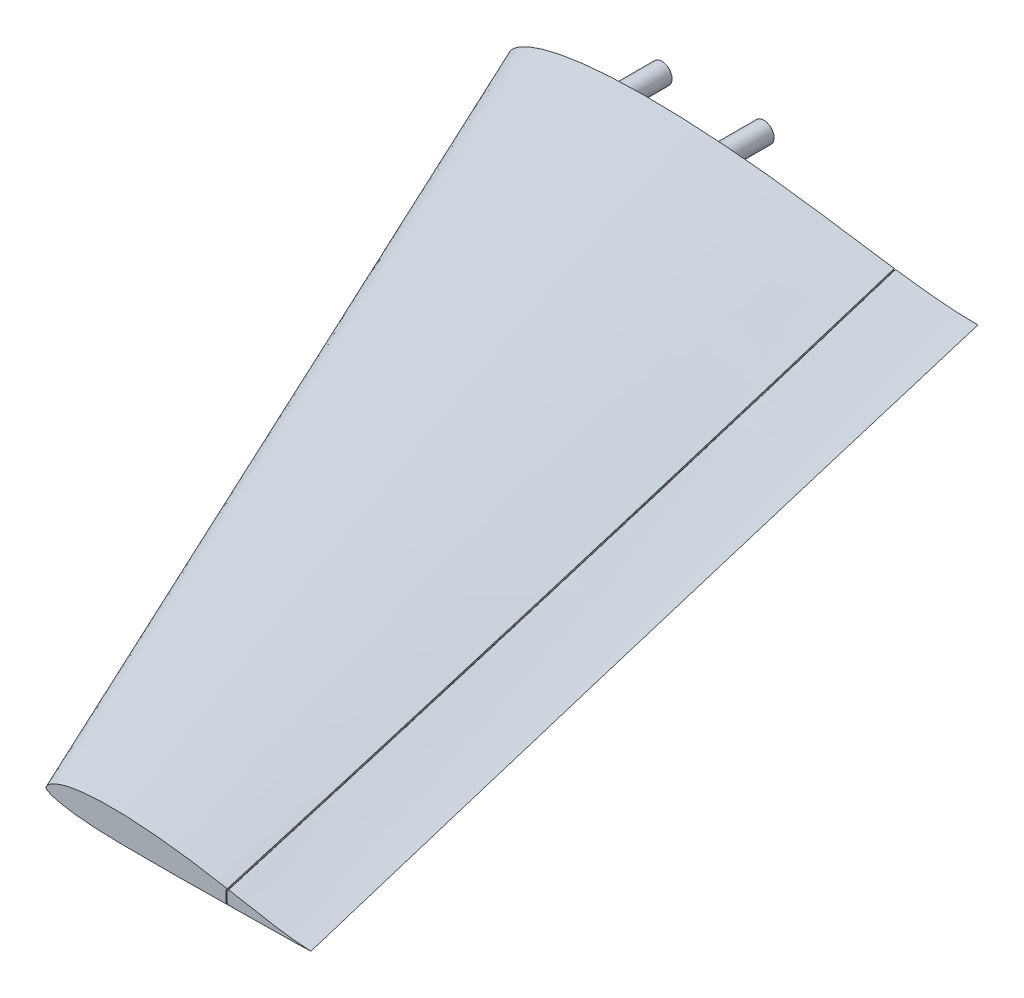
ISO-10303-21;
HEADER;
FILE_DESCRIPTION(('STEP AP214'),'2;1');
FILE_NAME('part.step','',(''),(''),'','','');
FILE_SCHEMA(('AUTOMOTIVE_DESIGN { 1 0 10303 214 1 1 1 1 }'));
ENDSEC;
DATA;
#1=APPLICATION_CONTEXT('core data for automotive mechanical design processes');
#2=APPLICATION_PROTOCOL_DEFINITION('international standard','automotive_design',2000,#1);
#3=PRODUCT_CONTEXT('',#1,'mechanical');
#4=PRODUCT('Part','Part','',(#3));
#5=PRODUCT_RELATED_PRODUCT_CATEGORY('part','',(#4));
#6=PRODUCT_DEFINITION_FORMATION('','',#4);
#7=PRODUCT_DEFINITION_CONTEXT('part definition',#1,'design');
#8=PRODUCT_DEFINITION('design','',#6,#7);
#9=PRODUCT_DEFINITION_SHAPE('','',#8);
#10=(LENGTH_UNIT() NAMED_UNIT(*) SI_UNIT(.MILLI.,.METRE.));
#11=(NAMED_UNIT(*) PLANE_ANGLE_UNIT() SI_UNIT($,.RADIAN.));
#12=(NAMED_UNIT(*) SI_UNIT($,.STERADIAN.) SOLID_ANGLE_UNIT());
#13=UNCERTAINTY_MEASURE_WITH_UNIT(LENGTH_MEASURE(1.E-05),#10,'distance_accuracy_value','');
#14=(GEOMETRIC_REPRESENTATION_CONTEXT(3) GLOBAL_UNCERTAINTY_ASSIGNED_CONTEXT((#13)) GLOBAL_UNIT_ASSIGNED_CONTEXT((#10,
#11,#12)) REPRESENTATION_CONTEXT('',''));
#15=CARTESIAN_POINT('',(0.,0.,0.));
#16=DIRECTION('',(0.,0.,1.));
#17=DIRECTION('',(1.,0.,0.));
#18=AXIS2_PLACEMENT_3D('',#15,#16,#17);
#19=CARTESIAN_POINT('',(307.698320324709,-4.92913108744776,425.));
#20=DIRECTION('',(0.,0.,-1.));
#21=DIRECTION('',(-1.,0.,0.));
#22=AXIS2_PLACEMENT_3D('',#19,#20,#21);
#23=PLANE('',#22);
#24=CARTESIAN_POINT('',(327.92118083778,-4.49523358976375,425.));
#25=CARTESIAN_POINT('',(327.877229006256,-4.49819413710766,425.));
#26=CARTESIAN_POINT('',(327.80921588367,-4.50277542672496,425.));
#27=CARTESIAN_POINT('',(327.717317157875,-4.50896562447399,425.));
#28=CARTESIAN_POINT('',(327.623600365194,-4.51527828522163,425.));
#29=CARTESIAN_POINT('',(327.55453222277,-4.51993063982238,425.));
#30=CARTESIAN_POINT('',(327.096071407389,-4.54947646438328,425.));
#31=CARTESIAN_POINT('',(326.275329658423,-4.60208757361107,425.));
#32=CARTESIAN_POINT('',(325.042079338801,-4.6533928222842,425.));
#33=CARTESIAN_POINT('',(323.807728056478,-4.68991226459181,425.000000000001));
#34=CARTESIAN_POINT('',(322.160820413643,-4.72710978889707,424.999999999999));
#35=CARTESIAN_POINT('',(320.100589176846,-4.76383399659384,425.000000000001));
#36=CARTESIAN_POINT('',(317.626246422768,-4.80205168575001,424.999999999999));
#37=CARTESIAN_POINT('',(315.150149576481,-4.83505076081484,425.000000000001));
#38=CARTESIAN_POINT('',(311.846815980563,-4.87751540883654,424.999999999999));
#39=CARTESIAN_POINT('',(307.714881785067,-4.92875638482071,425.000000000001));
#40=CARTESIAN_POINT('',(302.754534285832,-4.99114248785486,425.));
#41=CARTESIAN_POINT('',(297.794529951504,-5.0550414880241,425.));
#42=CARTESIAN_POINT('',(292.837200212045,-5.11819627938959,425.));
#43=CARTESIAN_POINT('',(289.535679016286,-5.1611249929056,425.));
#44=CARTESIAN_POINT('',(287.751219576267,-5.184222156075,425.));
#45=CARTESIAN_POINT('',(287.478269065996,-5.13203438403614,425.));
#46=CARTESIAN_POINT('',(287.13573653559,-4.89789193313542,425.000000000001));
#47=CARTESIAN_POINT('',(286.918894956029,-4.55771291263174,425.));
#48=CARTESIAN_POINT('',(286.873200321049,-4.30513751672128,425.));
#49=CARTESIAN_POINT('',(286.873200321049,-4.18255953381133,425.));
#50=B_SPLINE_CURVE_WITH_KNOTS('',3,(#24,#25,#26,#27,#28,#29,#30,#31,#32,#33,#34,#35,#36,#37,#38,
#39,#40,#41,#42,#43,#44,#45,#46,#47,#48,#49),.UNSPECIFIED.,.F.,.F.,(4,1,1,1,2,1,1,1,1,1,1,1,1,1,
1,1,1,2,1,1,1,4),(0.,0.00348085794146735,0.00696171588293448,0.0104425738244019,
0.0139234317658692,0.0435275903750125,0.0731317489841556,0.102735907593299,0.132340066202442,
0.191548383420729,0.250756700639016,0.309965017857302,0.369173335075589,0.487589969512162,
0.606006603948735,0.724423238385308,0.842839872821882,0.961256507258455,0.970942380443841,
0.980628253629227,0.990314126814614,1.),.UNSPECIFIED.);
#51=CARTESIAN_POINT('',(287.886142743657,-5.18247577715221,425.));
#52=VERTEX_POINT('',#51);
#53=CARTESIAN_POINT('',(327.50629810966,-4.52303912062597,425.));
#54=VERTEX_POINT('',#53);
#55=EDGE_CURVE('E731',#52,#54,#50,.F.);
#56=ORIENTED_EDGE('',*,*,#55,.T.);
#57=CARTESIAN_POINT('',(327.92118083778,-4.49523358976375,425.));
#58=CARTESIAN_POINT('',(327.877229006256,-4.49819413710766,425.));
#59=CARTESIAN_POINT('',(327.80921588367,-4.50277542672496,425.));
#60=CARTESIAN_POINT('',(327.717317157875,-4.50896562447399,425.));
#61=CARTESIAN_POINT('',(327.623600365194,-4.51527828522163,425.));
#62=CARTESIAN_POINT('',(327.55453222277,-4.51993063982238,425.));
#63=CARTESIAN_POINT('',(327.096071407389,-4.54947646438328,425.));
#64=CARTESIAN_POINT('',(326.275329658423,-4.60208757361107,425.));
#65=CARTESIAN_POINT('',(325.042079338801,-4.6533928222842,425.));
#66=CARTESIAN_POINT('',(323.807728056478,-4.68991226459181,425.000000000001));
#67=CARTESIAN_POINT('',(322.160820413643,-4.72710978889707,424.999999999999));
#68=CARTESIAN_POINT('',(320.100589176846,-4.76383399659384,425.000000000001));
#69=CARTESIAN_POINT('',(317.626246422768,-4.80205168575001,424.999999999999));
#70=CARTESIAN_POINT('',(315.150149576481,-4.83505076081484,425.000000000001));
#71=CARTESIAN_POINT('',(311.846815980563,-4.87751540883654,424.999999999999));
#72=CARTESIAN_POINT('',(307.714881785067,-4.92875638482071,425.000000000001));
#73=CARTESIAN_POINT('',(302.754534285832,-4.99114248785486,425.));
#74=CARTESIAN_POINT('',(297.794529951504,-5.0550414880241,425.));
#75=CARTESIAN_POINT('',(292.837200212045,-5.11819627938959,425.));
#76=CARTESIAN_POINT('',(289.535679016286,-5.1611249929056,425.));
#77=CARTESIAN_POINT('',(287.751219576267,-5.184222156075,425.));
#78=CARTESIAN_POINT('',(287.478269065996,-5.13203438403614,425.));
#79=CARTESIAN_POINT('',(287.13573653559,-4.89789193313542,425.000000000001));
#80=CARTESIAN_POINT('',(286.918894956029,-4.55771291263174,425.));
#81=CARTESIAN_POINT('',(286.873200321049,-4.30513751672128,425.));
#82=CARTESIAN_POINT('',(286.873200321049,-4.18255953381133,425.));
#83=B_SPLINE_CURVE_WITH_KNOTS('',3,(#57,#58,#59,#60,#61,#62,#63,#64,#65,#66,#67,#68,#69,#70,#71,
#72,#73,#74,#75,#76,#77,#78,#79,#80,#81,#82),.UNSPECIFIED.,.F.,.F.,(4,1,1,1,2,1,1,1,1,1,1,1,1,1,
1,1,1,2,1,1,1,4),(0.,0.00348085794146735,0.00696171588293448,0.0104425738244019,
0.0139234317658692,0.0435275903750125,0.0731317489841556,0.102735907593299,0.132340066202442,
0.191548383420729,0.250756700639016,0.309965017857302,0.369173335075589,0.487589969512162,
0.606006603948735,0.724423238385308,0.842839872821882,0.961256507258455,0.970942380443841,
0.980628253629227,0.990314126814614,1.),.UNSPECIFIED.);
#84=CARTESIAN_POINT('',(327.92118083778,-4.49523358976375,425.));
#85=VERTEX_POINT('',#84);
#86=EDGE_CURVE('E732',#54,#85,#83,.F.);
#87=ORIENTED_EDGE('',*,*,#86,.T.);
#88=CARTESIAN_POINT('',(286.873200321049,-4.18255953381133,425.));
#89=CARTESIAN_POINT('',(286.873200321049,-3.8473097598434,425.));
#90=CARTESIAN_POINT('',(286.873200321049,-3.13905808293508,425.));
#91=CARTESIAN_POINT('',(286.873200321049,-1.98379704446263,425.));
#92=CARTESIAN_POINT('',(286.873200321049,-0.797236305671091,425.));
#93=CARTESIAN_POINT('',(286.873200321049,-0.0392834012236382,425.));
#94=CARTESIAN_POINT('',(286.873200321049,0.48224352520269,425.));
#95=CARTESIAN_POINT('',(286.949122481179,0.784536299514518,424.999999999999));
#96=CARTESIAN_POINT('',(287.229318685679,1.12783650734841,425.000000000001));
#97=CARTESIAN_POINT('',(287.618500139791,1.32146769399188,424.999999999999));
#98=CARTESIAN_POINT('',(287.910892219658,1.33270734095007,425.));
#99=CARTESIAN_POINT('',(289.706988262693,1.00190512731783,425.));
#100=CARTESIAN_POINT('',(293.006315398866,0.38838563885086,425.));
#101=CARTESIAN_POINT('',(297.946866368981,-0.525995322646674,425.));
#102=CARTESIAN_POINT('',(302.887718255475,-1.41765093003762,425.));
#103=CARTESIAN_POINT('',(307.837549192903,-2.26853052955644,425.));
#104=CARTESIAN_POINT('',(311.977391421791,-2.92451466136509,425.));
#105=CARTESIAN_POINT('',(315.303592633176,-3.3973211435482,425.));
#106=CARTESIAN_POINT('',(317.806447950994,-3.72046914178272,425.));
#107=CARTESIAN_POINT('',(320.318548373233,-4.0066938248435,424.999999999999));
#108=CARTESIAN_POINT('',(322.840339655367,-4.25298287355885,425.000000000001));
#109=CARTESIAN_POINT('',(324.951229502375,-4.41011343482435,424.999999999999));
#110=CARTESIAN_POINT('',(326.646458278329,-4.48621337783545,425.000000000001));
#111=CARTESIAN_POINT('',(327.49607098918,-4.49493634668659,425.));
#112=CARTESIAN_POINT('',(327.92118083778,-4.49523358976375,425.));
#113=B_SPLINE_CURVE_WITH_KNOTS('',3,(#88,#89,#90,#91,#92,#93,#94,#95,#96,#97,#98,#99,#100,#101,
#102,#103,#104,#105,#106,#107,#108,#109,#110,#111,#112),.UNSPECIFIED.,.F.,.F.,(4,1,1,1,2,1,1,1,
2,1,1,1,1,1,1,1,1,1,1,1,4),(0.,0.0215804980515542,0.0431609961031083,0.0647414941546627,
0.0863219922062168,0.0958223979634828,0.105322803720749,0.114823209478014,0.12432361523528,
0.23378316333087,0.34324271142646,0.45270225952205,0.56216180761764,0.67162135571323,
0.726351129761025,0.78108090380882,0.835810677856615,0.89054045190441,0.945270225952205,
0.972635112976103,1.),.UNSPECIFIED.);
#114=CARTESIAN_POINT('',(327.506536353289,-4.49354170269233,425.));
#115=VERTEX_POINT('',#114);
#116=EDGE_CURVE('E532',#85,#115,#113,.F.);
#117=ORIENTED_EDGE('',*,*,#116,.T.);
#118=CARTESIAN_POINT('',(286.873200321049,-4.18255953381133,425.));
#119=CARTESIAN_POINT('',(286.873200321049,-3.8473097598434,425.));
#120=CARTESIAN_POINT('',(286.873200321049,-3.13905808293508,425.));
#121=CARTESIAN_POINT('',(286.873200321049,-1.98379704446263,425.));
#122=CARTESIAN_POINT('',(286.873200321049,-0.797236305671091,425.));
#123=CARTESIAN_POINT('',(286.873200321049,-0.0392834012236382,425.));
#124=CARTESIAN_POINT('',(286.873200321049,0.48224352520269,425.));
#125=CARTESIAN_POINT('',(286.949122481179,0.784536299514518,424.999999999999));
#126=CARTESIAN_POINT('',(287.229318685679,1.12783650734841,425.000000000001));
#127=CARTESIAN_POINT('',(287.618500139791,1.32146769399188,424.999999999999));
#128=CARTESIAN_POINT('',(287.910892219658,1.33270734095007,425.));
#129=CARTESIAN_POINT('',(289.706988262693,1.00190512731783,425.));
#130=CARTESIAN_POINT('',(293.006315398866,0.38838563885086,425.));
#131=CARTESIAN_POINT('',(297.946866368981,-0.525995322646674,425.));
#132=CARTESIAN_POINT('',(302.887718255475,-1.41765093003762,425.));
#133=CARTESIAN_POINT('',(307.837549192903,-2.26853052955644,425.));
#134=CARTESIAN_POINT('',(311.977391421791,-2.92451466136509,425.));
#135=CARTESIAN_POINT('',(315.303592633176,-3.3973211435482,425.));
#136=CARTESIAN_POINT('',(317.806447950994,-3.72046914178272,425.));
#137=CARTESIAN_POINT('',(320.318548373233,-4.0066938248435,424.999999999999));
#138=CARTESIAN_POINT('',(322.840339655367,-4.25298287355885,425.000000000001));
#139=CARTESIAN_POINT('',(324.951229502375,-4.41011343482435,424.999999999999));
#140=CARTESIAN_POINT('',(326.646458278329,-4.48621337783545,425.000000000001));
#141=CARTESIAN_POINT('',(327.49607098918,-4.49493634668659,425.));
#142=CARTESIAN_POINT('',(327.92118083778,-4.49523358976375,425.));
#143=B_SPLINE_CURVE_WITH_KNOTS('',3,(#118,#119,#120,#121,#122,#123,#124,#125,#126,#127,#128,
#129,#130,#131,#132,#133,#134,#135,#136,#137,#138,#139,#140,#141,#142),.UNSPECIFIED.,.F.,.F.,(4,
1,1,1,2,1,1,1,2,1,1,1,1,1,1,1,1,1,1,1,4),(0.,0.0215804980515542,0.0431609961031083,
0.0647414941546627,0.0863219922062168,0.0958223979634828,0.105322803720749,0.114823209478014,
0.12432361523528,0.23378316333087,0.34324271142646,0.45270225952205,0.56216180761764,
0.67162135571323,0.726351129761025,0.78108090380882,0.835810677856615,0.89054045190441,
0.945270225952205,0.972635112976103,1.),.UNSPECIFIED.);
#144=CARTESIAN_POINT('',(288.054332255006,1.30628877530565,425.));
#145=VERTEX_POINT('',#144);
#146=EDGE_CURVE('E733',#115,#145,#143,.F.);
#147=ORIENTED_EDGE('',*,*,#146,.T.);
#148=CARTESIAN_POINT('',(286.873200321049,-4.18255953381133,425.));
#149=CARTESIAN_POINT('',(286.873200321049,-3.8473097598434,425.));
#150=CARTESIAN_POINT('',(286.873200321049,-3.13905808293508,425.));
#151=CARTESIAN_POINT('',(286.873200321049,-1.98379704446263,425.));
#152=CARTESIAN_POINT('',(286.873200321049,-0.797236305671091,425.));
#153=CARTESIAN_POINT('',(286.873200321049,-0.0392834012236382,425.));
#154=CARTESIAN_POINT('',(286.873200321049,0.48224352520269,425.));
#155=CARTESIAN_POINT('',(286.949122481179,0.784536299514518,424.999999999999));
#156=CARTESIAN_POINT('',(287.229318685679,1.12783650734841,425.000000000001));
#157=CARTESIAN_POINT('',(287.618500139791,1.32146769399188,424.999999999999));
#158=CARTESIAN_POINT('',(287.910892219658,1.33270734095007,425.));
#159=CARTESIAN_POINT('',(289.706988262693,1.00190512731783,425.));
#160=CARTESIAN_POINT('',(293.006315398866,0.38838563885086,425.));
#161=CARTESIAN_POINT('',(297.946866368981,-0.525995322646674,425.));
#162=CARTESIAN_POINT('',(302.887718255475,-1.41765093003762,425.));
#163=CARTESIAN_POINT('',(307.837549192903,-2.26853052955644,425.));
#164=CARTESIAN_POINT('',(311.977391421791,-2.92451466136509,425.));
#165=CARTESIAN_POINT('',(315.303592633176,-3.3973211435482,425.));
#166=CARTESIAN_POINT('',(317.806447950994,-3.72046914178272,425.));
#167=CARTESIAN_POINT('',(320.318548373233,-4.0066938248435,424.999999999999));
#168=CARTESIAN_POINT('',(322.840339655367,-4.25298287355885,425.000000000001));
#169=CARTESIAN_POINT('',(324.951229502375,-4.41011343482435,424.999999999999));
#170=CARTESIAN_POINT('',(326.646458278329,-4.48621337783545,425.000000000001));
#171=CARTESIAN_POINT('',(327.49607098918,-4.49493634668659,425.));
#172=CARTESIAN_POINT('',(327.92118083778,-4.49523358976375,425.));
#173=B_SPLINE_CURVE_WITH_KNOTS('',3,(#148,#149,#150,#151,#152,#153,#154,#155,#156,#157,#158,
#159,#160,#161,#162,#163,#164,#165,#166,#167,#168,#169,#170,#171,#172),.UNSPECIFIED.,.F.,.F.,(4,
1,1,1,2,1,1,1,2,1,1,1,1,1,1,1,1,1,1,1,4),(0.,0.0215804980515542,0.0431609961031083,
0.0647414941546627,0.0863219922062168,0.0958223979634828,0.105322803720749,0.114823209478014,
0.12432361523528,0.23378316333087,0.34324271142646,0.45270225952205,0.56216180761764,
0.67162135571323,0.726351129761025,0.78108090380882,0.835810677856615,0.89054045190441,
0.945270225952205,0.972635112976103,1.),.UNSPECIFIED.);
#174=CARTESIAN_POINT('',(286.873200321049,0.322829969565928,425.));
#175=VERTEX_POINT('',#174);
#176=EDGE_CURVE('E737',#145,#175,#173,.F.);
#177=ORIENTED_EDGE('',*,*,#176,.T.);
#178=CARTESIAN_POINT('',(286.873200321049,-4.18255953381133,425.));
#179=CARTESIAN_POINT('',(286.873200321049,-3.8473097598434,425.));
#180=CARTESIAN_POINT('',(286.873200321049,-3.13905808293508,425.));
#181=CARTESIAN_POINT('',(286.873200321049,-1.98379704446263,425.));
#182=CARTESIAN_POINT('',(286.873200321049,-0.797236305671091,425.));
#183=CARTESIAN_POINT('',(286.873200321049,-0.0392834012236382,425.));
#184=CARTESIAN_POINT('',(286.873200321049,0.48224352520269,425.));
#185=CARTESIAN_POINT('',(286.949122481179,0.784536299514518,424.999999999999));
#186=CARTESIAN_POINT('',(287.229318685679,1.12783650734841,425.000000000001));
#187=CARTESIAN_POINT('',(287.618500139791,1.32146769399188,424.999999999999));
#188=CARTESIAN_POINT('',(287.910892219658,1.33270734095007,425.));
#189=CARTESIAN_POINT('',(289.706988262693,1.00190512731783,425.));
#190=CARTESIAN_POINT('',(293.006315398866,0.38838563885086,425.));
#191=CARTESIAN_POINT('',(297.946866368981,-0.525995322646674,425.));
#192=CARTESIAN_POINT('',(302.887718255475,-1.41765093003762,425.));
#193=CARTESIAN_POINT('',(307.837549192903,-2.26853052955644,425.));
#194=CARTESIAN_POINT('',(311.977391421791,-2.92451466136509,425.));
#195=CARTESIAN_POINT('',(315.303592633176,-3.3973211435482,425.));
#196=CARTESIAN_POINT('',(317.806447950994,-3.72046914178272,425.));
#197=CARTESIAN_POINT('',(320.318548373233,-4.0066938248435,424.999999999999));
#198=CARTESIAN_POINT('',(322.840339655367,-4.25298287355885,425.000000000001));
#199=CARTESIAN_POINT('',(324.951229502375,-4.41011343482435,424.999999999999));
#200=CARTESIAN_POINT('',(326.646458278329,-4.48621337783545,425.000000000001));
#201=CARTESIAN_POINT('',(327.49607098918,-4.49493634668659,425.));
#202=CARTESIAN_POINT('',(327.92118083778,-4.49523358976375,425.));
#203=B_SPLINE_CURVE_WITH_KNOTS('',3,(#178,#179,#180,#181,#182,#183,#184,#185,#186,#187,#188,
#189,#190,#191,#192,#193,#194,#195,#196,#197,#198,#199,#200,#201,#202),.UNSPECIFIED.,.F.,.F.,(4,
1,1,1,2,1,1,1,2,1,1,1,1,1,1,1,1,1,1,1,4),(0.,0.0215804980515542,0.0431609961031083,
0.0647414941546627,0.0863219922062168,0.0958223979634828,0.105322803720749,0.114823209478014,
0.12432361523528,0.23378316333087,0.34324271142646,0.45270225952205,0.56216180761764,
0.67162135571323,0.726351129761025,0.78108090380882,0.835810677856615,0.89054045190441,
0.945270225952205,0.972635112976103,1.),.UNSPECIFIED.);
#204=CARTESIAN_POINT('',(286.873200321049,-4.18255953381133,425.));
#205=VERTEX_POINT('',#204);
#206=EDGE_CURVE('E525',#175,#205,#203,.F.);
#207=ORIENTED_EDGE('',*,*,#206,.T.);
#208=CARTESIAN_POINT('',(327.92118083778,-4.49523358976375,425.));
#209=CARTESIAN_POINT('',(327.877229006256,-4.49819413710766,425.));
#210=CARTESIAN_POINT('',(327.80921588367,-4.50277542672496,425.));
#211=CARTESIAN_POINT('',(327.717317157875,-4.50896562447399,425.));
#212=CARTESIAN_POINT('',(327.623600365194,-4.51527828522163,425.));
#213=CARTESIAN_POINT('',(327.55453222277,-4.51993063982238,425.));
#214=CARTESIAN_POINT('',(327.096071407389,-4.54947646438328,425.));
#215=CARTESIAN_POINT('',(326.275329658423,-4.60208757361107,425.));
#216=CARTESIAN_POINT('',(325.042079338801,-4.6533928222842,425.));
#217=CARTESIAN_POINT('',(323.807728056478,-4.68991226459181,425.000000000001));
#218=CARTESIAN_POINT('',(322.160820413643,-4.72710978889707,424.999999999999));
#219=CARTESIAN_POINT('',(320.100589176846,-4.76383399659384,425.000000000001));
#220=CARTESIAN_POINT('',(317.626246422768,-4.80205168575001,424.999999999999));
#221=CARTESIAN_POINT('',(315.150149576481,-4.83505076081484,425.000000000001));
#222=CARTESIAN_POINT('',(311.846815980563,-4.87751540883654,424.999999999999));
#223=CARTESIAN_POINT('',(307.714881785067,-4.92875638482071,425.000000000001));
#224=CARTESIAN_POINT('',(302.754534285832,-4.99114248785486,425.));
#225=CARTESIAN_POINT('',(297.794529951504,-5.0550414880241,425.));
#226=CARTESIAN_POINT('',(292.837200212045,-5.11819627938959,425.));
#227=CARTESIAN_POINT('',(289.535679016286,-5.1611249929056,425.));
#228=CARTESIAN_POINT('',(287.751219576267,-5.184222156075,425.));
#229=CARTESIAN_POINT('',(287.478269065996,-5.13203438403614,425.));
#230=CARTESIAN_POINT('',(287.13573653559,-4.89789193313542,425.000000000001));
#231=CARTESIAN_POINT('',(286.918894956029,-4.55771291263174,425.));
#232=CARTESIAN_POINT('',(286.873200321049,-4.30513751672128,425.));
#233=CARTESIAN_POINT('',(286.873200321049,-4.18255953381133,425.));
#234=B_SPLINE_CURVE_WITH_KNOTS('',3,(#208,#209,#210,#211,#212,#213,#214,#215,#216,#217,#218,
#219,#220,#221,#222,#223,#224,#225,#226,#227,#228,#229,#230,#231,#232,#233),.UNSPECIFIED.,.F.,
.F.,(4,1,1,1,2,1,1,1,1,1,1,1,1,1,1,1,1,2,1,1,1,4),(0.,0.00348085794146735,0.00696171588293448,
0.0104425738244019,0.0139234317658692,0.0435275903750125,0.0731317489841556,0.102735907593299,
0.132340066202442,0.191548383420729,0.250756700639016,0.309965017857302,0.369173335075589,
0.487589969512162,0.606006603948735,0.724423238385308,0.842839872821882,0.961256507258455,
0.970942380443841,0.980628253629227,0.990314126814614,1.),.UNSPECIFIED.);
#235=EDGE_CURVE('E13',#205,#52,#234,.F.);
#236=ORIENTED_EDGE('',*,*,#235,.T.);
#237=EDGE_LOOP('',(#56,#87,#117,#147,#177,#207,#236));
#238=FACE_BOUND('',#237,.T.);
#239=ADVANCED_FACE('F515',(#238),#23,.F.);
#240=CARTESIAN_POINT('',(209.642338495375,-1.28282282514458,0.));
#241=DIRECTION('',(0.,0.,1.));
#242=DIRECTION('',(1.,0.,0.));
#243=AXIS2_PLACEMENT_3D('',#240,#241,#242);
#244=PLANE('',#243);
#245=CARTESIAN_POINT('',(188.952019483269,-1.21963019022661,0.));
#246=CARTESIAN_POINT('',(188.952019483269,-1.36393356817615,0.));
#247=CARTESIAN_POINT('',(189.014512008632,-1.64168043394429,0.));
#248=CARTESIAN_POINT('',(189.255014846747,-1.97334795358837,0.));
#249=CARTESIAN_POINT('',(189.598892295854,-2.1833091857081,0.));
#250=CARTESIAN_POINT('',(189.865560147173,-2.22486679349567,0.));
#251=CARTESIAN_POINT('',(191.636789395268,-2.14070304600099,0.));
#252=CARTESIAN_POINT('',(194.909612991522,-1.98552621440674,0.));
#253=CARTESIAN_POINT('',(199.815359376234,-1.75296760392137,0.));
#254=CARTESIAN_POINT('',(204.719494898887,-1.5195520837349,0.));
#255=CARTESIAN_POINT('',(209.623907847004,-1.2847944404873,0.));
#256=CARTESIAN_POINT('',(213.712531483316,-1.08362781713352,0.));
#257=CARTESIAN_POINT('',(216.9851629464,-0.915419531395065,0.));
#258=CARTESIAN_POINT('',(219.440694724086,-0.785108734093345,0.));
#259=CARTESIAN_POINT('',(221.897462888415,-0.64875907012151,0.));
#260=CARTESIAN_POINT('',(223.945427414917,-0.521676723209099,0.));
#261=CARTESIAN_POINT('',(225.584009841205,-0.406845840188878,0.));
#262=CARTESIAN_POINT('',(226.812608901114,-0.309567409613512,0.));
#263=CARTESIAN_POINT('',(228.040427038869,-0.196560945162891,0.));
#264=CARTESIAN_POINT('',(228.858867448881,-0.115649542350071,0.));
#265=CARTESIAN_POINT('',(229.316274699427,-0.0700960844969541,0.));
#266=CARTESIAN_POINT('',(229.423025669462,-0.0591518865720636,0.));
#267=CARTESIAN_POINT('',(229.623784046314,-0.0385699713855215,0.));
#268=CARTESIAN_POINT('',(229.833357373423,-0.0170843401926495,0.));
#269=CARTESIAN_POINT('',(229.948411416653,-0.00528890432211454,0.));
#270=CARTESIAN_POINT('',(230.,0.,0.));
#271=B_SPLINE_CURVE_WITH_KNOTS('',3,(#245,#246,#247,#248,#249,#250,#251,#252,#253,#254,#255,
#256,#257,#258,#259,#260,#261,#262,#263,#264,#265,#266,#267,#268,#269,#270),.UNSPECIFIED.,.F.,
.F.,(4,1,1,1,2,1,1,1,1,1,1,1,1,1,1,1,1,2,1,1,1,4),(0.,0.00968587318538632,0.0193717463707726,
0.029057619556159,0.0387434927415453,0.157160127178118,0.275576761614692,0.393993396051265,
0.512410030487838,0.630826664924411,0.690034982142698,0.749243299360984,0.808451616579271,
0.867659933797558,0.897264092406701,0.926868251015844,0.956472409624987,0.986076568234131,
0.989557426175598,0.993038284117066,0.996519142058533,1.),.UNSPECIFIED.);
#272=CARTESIAN_POINT('',(189.999483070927,-2.21850315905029,0.));
#273=VERTEX_POINT('',#272);
#274=CARTESIAN_POINT('',(229.268151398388,-0.0748887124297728,0.));
#275=VERTEX_POINT('',#274);
#276=EDGE_CURVE('E583',#273,#275,#271,.T.);
#277=ORIENTED_EDGE('',*,*,#276,.F.);
#278=CARTESIAN_POINT('',(188.952019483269,-1.21963019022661,0.));
#279=CARTESIAN_POINT('',(188.952019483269,-1.36393356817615,0.));
#280=CARTESIAN_POINT('',(189.014512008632,-1.64168043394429,0.));
#281=CARTESIAN_POINT('',(189.255014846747,-1.97334795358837,0.));
#282=CARTESIAN_POINT('',(189.598892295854,-2.1833091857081,0.));
#283=CARTESIAN_POINT('',(189.865560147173,-2.22486679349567,0.));
#284=CARTESIAN_POINT('',(191.636789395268,-2.14070304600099,0.));
#285=CARTESIAN_POINT('',(194.909612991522,-1.98552621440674,0.));
#286=CARTESIAN_POINT('',(199.815359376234,-1.75296760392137,0.));
#287=CARTESIAN_POINT('',(204.719494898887,-1.5195520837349,0.));
#288=CARTESIAN_POINT('',(209.623907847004,-1.2847944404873,0.));
#289=CARTESIAN_POINT('',(213.712531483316,-1.08362781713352,0.));
#290=CARTESIAN_POINT('',(216.9851629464,-0.915419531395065,0.));
#291=CARTESIAN_POINT('',(219.440694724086,-0.785108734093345,0.));
#292=CARTESIAN_POINT('',(221.897462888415,-0.64875907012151,0.));
#293=CARTESIAN_POINT('',(223.945427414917,-0.521676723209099,0.));
#294=CARTESIAN_POINT('',(225.584009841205,-0.406845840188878,0.));
#295=CARTESIAN_POINT('',(226.812608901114,-0.309567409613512,0.));
#296=CARTESIAN_POINT('',(228.040427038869,-0.196560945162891,0.));
#297=CARTESIAN_POINT('',(228.858867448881,-0.115649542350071,0.));
#298=CARTESIAN_POINT('',(229.316274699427,-0.0700960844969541,0.));
#299=CARTESIAN_POINT('',(229.423025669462,-0.0591518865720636,0.));
#300=CARTESIAN_POINT('',(229.623784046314,-0.0385699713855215,0.));
#301=CARTESIAN_POINT('',(229.833357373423,-0.0170843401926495,0.));
#302=CARTESIAN_POINT('',(229.948411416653,-0.00528890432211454,0.));
#303=CARTESIAN_POINT('',(230.,0.,0.));
#304=B_SPLINE_CURVE_WITH_KNOTS('',3,(#278,#279,#280,#281,#282,#283,#284,#285,#286,#287,#288,
#289,#290,#291,#292,#293,#294,#295,#296,#297,#298,#299,#300,#301,#302,#303),.UNSPECIFIED.,.F.,
.F.,(4,1,1,1,2,1,1,1,1,1,1,1,1,1,1,1,1,2,1,1,1,4),(0.,0.00968587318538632,0.0193717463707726,
0.029057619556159,0.0387434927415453,0.157160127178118,0.275576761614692,0.393993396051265,
0.512410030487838,0.630826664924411,0.690034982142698,0.749243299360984,0.808451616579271,
0.867659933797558,0.897264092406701,0.926868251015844,0.956472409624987,0.986076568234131,
0.989557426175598,0.993038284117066,0.996519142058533,1.),.UNSPECIFIED.);
#305=CARTESIAN_POINT('',(188.952019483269,-1.21963019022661,0.));
#306=VERTEX_POINT('',#305);
#307=EDGE_CURVE('E597',#306,#273,#304,.T.);
#308=ORIENTED_EDGE('',*,*,#307,.F.);
#309=CARTESIAN_POINT('',(230.,0.,0.));
#310=CARTESIAN_POINT('',(229.58685252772,-0.014138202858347,0.));
#311=CARTESIAN_POINT('',(228.759940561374,-0.0405958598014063,0.));
#312=CARTESIAN_POINT('',(227.103269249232,-0.0581184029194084,0.));
#313=CARTESIAN_POINT('',(225.028800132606,-0.0326325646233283,0.));
#314=CARTESIAN_POINT('',(222.535606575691,0.0542368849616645,0.));
#315=CARTESIAN_POINT('',(220.039406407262,0.178018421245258,0.));
#316=CARTESIAN_POINT('',(217.540924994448,0.33304253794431,0.));
#317=CARTESIAN_POINT('',(214.207184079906,0.570874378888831,0.));
#318=CARTESIAN_POINT('',(210.037425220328,0.925456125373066,0.));
#319=CARTESIAN_POINT('',(205.03512861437,1.42929182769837,0.));
#320=CARTESIAN_POINT('',(200.039198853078,1.9992920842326,0.));
#321=CARTESIAN_POINT('',(195.053853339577,2.61919648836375,0.));
#322=CARTESIAN_POINT('',(191.740007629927,3.05805073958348,0.));
#323=CARTESIAN_POINT('',(189.942638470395,3.30138604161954,0.));
#324=CARTESIAN_POINT('',(189.644498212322,3.27686879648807,0.));
#325=CARTESIAN_POINT('',(189.256992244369,3.05356947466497,0.));
#326=CARTESIAN_POINT('',(189.0058184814,2.6970922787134,0.));
#327=CARTESIAN_POINT('',(188.952019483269,2.42385605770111,0.));
#328=CARTESIAN_POINT('',(188.952019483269,1.98919058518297,0.));
#329=CARTESIAN_POINT('',(188.952019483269,1.41090604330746,0.));
#330=CARTESIAN_POINT('',(188.952019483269,0.568384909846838,0.));
#331=CARTESIAN_POINT('',(188.952019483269,-0.286952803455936,0.));
#332=CARTESIAN_POINT('',(188.952019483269,-0.893624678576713,0.));
#333=CARTESIAN_POINT('',(188.952019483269,-1.21963019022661,0.));
#334=B_SPLINE_CURVE_WITH_KNOTS('',3,(#309,#310,#311,#312,#313,#314,#315,#316,#317,#318,#319,
#320,#321,#322,#323,#324,#325,#326,#327,#328,#329,#330,#331,#332,#333),.UNSPECIFIED.,.F.,.F.,(4,
1,1,1,1,1,1,1,1,1,1,1,2,1,1,1,2,1,1,1,4),(0.,0.0273648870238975,0.054729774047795,
0.10945954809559,0.164189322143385,0.21891909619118,0.273648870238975,0.32837864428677,
0.43783819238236,0.54729774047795,0.65675728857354,0.76621683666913,0.87567638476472,
0.885176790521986,0.894677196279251,0.904177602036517,0.913678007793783,0.935258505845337,
0.956839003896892,0.978419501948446,1.),.UNSPECIFIED.);
#335=CARTESIAN_POINT('',(188.952019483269,2.29099317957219,0.));
#336=VERTEX_POINT('',#335);
#337=EDGE_CURVE('E690',#336,#306,#334,.T.);
#338=ORIENTED_EDGE('',*,*,#337,.F.);
#339=CARTESIAN_POINT('',(230.,0.,0.));
#340=CARTESIAN_POINT('',(229.58685252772,-0.014138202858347,0.));
#341=CARTESIAN_POINT('',(228.759940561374,-0.0405958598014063,0.));
#342=CARTESIAN_POINT('',(227.103269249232,-0.0581184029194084,0.));
#343=CARTESIAN_POINT('',(225.028800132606,-0.0326325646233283,0.));
#344=CARTESIAN_POINT('',(222.535606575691,0.0542368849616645,0.));
#345=CARTESIAN_POINT('',(220.039406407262,0.178018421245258,0.));
#346=CARTESIAN_POINT('',(217.540924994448,0.33304253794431,0.));
#347=CARTESIAN_POINT('',(214.207184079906,0.570874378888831,0.));
#348=CARTESIAN_POINT('',(210.037425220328,0.925456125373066,0.));
#349=CARTESIAN_POINT('',(205.03512861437,1.42929182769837,0.));
#350=CARTESIAN_POINT('',(200.039198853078,1.9992920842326,0.));
#351=CARTESIAN_POINT('',(195.053853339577,2.61919648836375,0.));
#352=CARTESIAN_POINT('',(191.740007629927,3.05805073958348,0.));
#353=CARTESIAN_POINT('',(189.942638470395,3.30138604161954,0.));
#354=CARTESIAN_POINT('',(189.644498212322,3.27686879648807,0.));
#355=CARTESIAN_POINT('',(189.256992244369,3.05356947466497,0.));
#356=CARTESIAN_POINT('',(189.0058184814,2.6970922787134,0.));
#357=CARTESIAN_POINT('',(188.952019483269,2.42385605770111,0.));
#358=CARTESIAN_POINT('',(188.952019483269,1.98919058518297,0.));
#359=CARTESIAN_POINT('',(188.952019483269,1.41090604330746,0.));
#360=CARTESIAN_POINT('',(188.952019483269,0.568384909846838,0.));
#361=CARTESIAN_POINT('',(188.952019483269,-0.286952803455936,0.));
#362=CARTESIAN_POINT('',(188.952019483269,-0.893624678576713,0.));
#363=CARTESIAN_POINT('',(188.952019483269,-1.21963019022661,0.));
#364=B_SPLINE_CURVE_WITH_KNOTS('',3,(#339,#340,#341,#342,#343,#344,#345,#346,#347,#348,#349,
#350,#351,#352,#353,#354,#355,#356,#357,#358,#359,#360,#361,#362,#363),.UNSPECIFIED.,.F.,.F.,(4,
1,1,1,1,1,1,1,1,1,1,1,2,1,1,1,2,1,1,1,4),(0.,0.0273648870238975,0.054729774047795,
0.10945954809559,0.164189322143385,0.21891909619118,0.273648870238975,0.32837864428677,
0.43783819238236,0.54729774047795,0.65675728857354,0.76621683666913,0.87567638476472,
0.885176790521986,0.894677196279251,0.904177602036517,0.913678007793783,0.935258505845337,
0.956839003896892,0.978419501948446,1.),.UNSPECIFIED.);
#365=CARTESIAN_POINT('',(190.086179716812,3.28195283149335,0.));
#366=VERTEX_POINT('',#365);
#367=EDGE_CURVE('E701',#366,#336,#364,.T.);
#368=ORIENTED_EDGE('',*,*,#367,.F.);
#369=CARTESIAN_POINT('',(230.,0.,0.));
#370=CARTESIAN_POINT('',(229.58685252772,-0.014138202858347,0.));
#371=CARTESIAN_POINT('',(228.759940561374,-0.0405958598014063,0.));
#372=CARTESIAN_POINT('',(227.103269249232,-0.0581184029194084,0.));
#373=CARTESIAN_POINT('',(225.028800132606,-0.0326325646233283,0.));
#374=CARTESIAN_POINT('',(222.535606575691,0.0542368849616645,0.));
#375=CARTESIAN_POINT('',(220.039406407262,0.178018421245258,0.));
#376=CARTESIAN_POINT('',(217.540924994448,0.33304253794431,0.));
#377=CARTESIAN_POINT('',(214.207184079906,0.570874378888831,0.));
#378=CARTESIAN_POINT('',(210.037425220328,0.925456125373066,0.));
#379=CARTESIAN_POINT('',(205.03512861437,1.42929182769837,0.));
#380=CARTESIAN_POINT('',(200.039198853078,1.9992920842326,0.));
#381=CARTESIAN_POINT('',(195.053853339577,2.61919648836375,0.));
#382=CARTESIAN_POINT('',(191.740007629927,3.05805073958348,0.));
#383=CARTESIAN_POINT('',(189.942638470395,3.30138604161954,0.));
#384=CARTESIAN_POINT('',(189.644498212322,3.27686879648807,0.));
#385=CARTESIAN_POINT('',(189.256992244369,3.05356947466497,0.));
#386=CARTESIAN_POINT('',(189.0058184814,2.6970922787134,0.));
#387=CARTESIAN_POINT('',(188.952019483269,2.42385605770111,0.));
#388=CARTESIAN_POINT('',(188.952019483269,1.98919058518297,0.));
#389=CARTESIAN_POINT('',(188.952019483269,1.41090604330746,0.));
#390=CARTESIAN_POINT('',(188.952019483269,0.568384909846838,0.));
#391=CARTESIAN_POINT('',(188.952019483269,-0.286952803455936,0.));
#392=CARTESIAN_POINT('',(188.952019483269,-0.893624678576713,0.));
#393=CARTESIAN_POINT('',(188.952019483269,-1.21963019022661,0.));
#394=B_SPLINE_CURVE_WITH_KNOTS('',3,(#369,#370,#371,#372,#373,#374,#375,#376,#377,#378,#379,
#380,#381,#382,#383,#384,#385,#386,#387,#388,#389,#390,#391,#392,#393),.UNSPECIFIED.,.F.,.F.,(4,
1,1,1,1,1,1,1,1,1,1,1,2,1,1,1,2,1,1,1,4),(0.,0.0273648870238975,0.054729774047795,
0.10945954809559,0.164189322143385,0.21891909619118,0.273648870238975,0.32837864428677,
0.43783819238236,0.54729774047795,0.65675728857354,0.76621683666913,0.87567638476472,
0.885176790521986,0.894677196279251,0.904177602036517,0.913678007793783,0.935258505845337,
0.956839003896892,0.978419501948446,1.),.UNSPECIFIED.);
#395=CARTESIAN_POINT('',(229.266687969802,-0.0234020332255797,0.));
#396=VERTEX_POINT('',#395);
#397=EDGE_CURVE('E591',#396,#366,#394,.T.);
#398=ORIENTED_EDGE('',*,*,#397,.F.);
#399=CARTESIAN_POINT('',(230.,0.,0.));
#400=CARTESIAN_POINT('',(229.58685252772,-0.014138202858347,0.));
#401=CARTESIAN_POINT('',(228.759940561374,-0.0405958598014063,0.));
#402=CARTESIAN_POINT('',(227.103269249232,-0.0581184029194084,0.));
#403=CARTESIAN_POINT('',(225.028800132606,-0.0326325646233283,0.));
#404=CARTESIAN_POINT('',(222.535606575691,0.0542368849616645,0.));
#405=CARTESIAN_POINT('',(220.039406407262,0.178018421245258,0.));
#406=CARTESIAN_POINT('',(217.540924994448,0.33304253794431,0.));
#407=CARTESIAN_POINT('',(214.207184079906,0.570874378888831,0.));
#408=CARTESIAN_POINT('',(210.037425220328,0.925456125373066,0.));
#409=CARTESIAN_POINT('',(205.03512861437,1.42929182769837,0.));
#410=CARTESIAN_POINT('',(200.039198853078,1.9992920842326,0.));
#411=CARTESIAN_POINT('',(195.053853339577,2.61919648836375,0.));
#412=CARTESIAN_POINT('',(191.740007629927,3.05805073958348,0.));
#413=CARTESIAN_POINT('',(189.942638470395,3.30138604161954,0.));
#414=CARTESIAN_POINT('',(189.644498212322,3.27686879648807,0.));
#415=CARTESIAN_POINT('',(189.256992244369,3.05356947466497,0.));
#416=CARTESIAN_POINT('',(189.0058184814,2.6970922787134,0.));
#417=CARTESIAN_POINT('',(188.952019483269,2.42385605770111,0.));
#418=CARTESIAN_POINT('',(188.952019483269,1.98919058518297,0.));
#419=CARTESIAN_POINT('',(188.952019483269,1.41090604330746,0.));
#420=CARTESIAN_POINT('',(188.952019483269,0.568384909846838,0.));
#421=CARTESIAN_POINT('',(188.952019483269,-0.286952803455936,0.));
#422=CARTESIAN_POINT('',(188.952019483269,-0.893624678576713,0.));
#423=CARTESIAN_POINT('',(188.952019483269,-1.21963019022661,0.));
#424=B_SPLINE_CURVE_WITH_KNOTS('',3,(#399,#400,#401,#402,#403,#404,#405,#406,#407,#408,#409,
#410,#411,#412,#413,#414,#415,#416,#417,#418,#419,#420,#421,#422,#423),.UNSPECIFIED.,.F.,.F.,(4,
1,1,1,1,1,1,1,1,1,1,1,2,1,1,1,2,1,1,1,4),(0.,0.0273648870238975,0.054729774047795,
0.10945954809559,0.164189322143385,0.21891909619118,0.273648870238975,0.32837864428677,
0.43783819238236,0.54729774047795,0.65675728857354,0.76621683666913,0.87567638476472,
0.885176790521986,0.894677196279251,0.904177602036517,0.913678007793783,0.935258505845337,
0.956839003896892,0.978419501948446,1.),.UNSPECIFIED.);
#425=CARTESIAN_POINT('',(230.,0.,0.));
#426=VERTEX_POINT('',#425);
#427=EDGE_CURVE('E586',#426,#396,#424,.T.);
#428=ORIENTED_EDGE('',*,*,#427,.F.);
#429=CARTESIAN_POINT('',(188.952019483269,-1.21963019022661,0.));
#430=CARTESIAN_POINT('',(188.952019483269,-1.36393356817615,0.));
#431=CARTESIAN_POINT('',(189.014512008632,-1.64168043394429,0.));
#432=CARTESIAN_POINT('',(189.255014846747,-1.97334795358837,0.));
#433=CARTESIAN_POINT('',(189.598892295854,-2.1833091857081,0.));
#434=CARTESIAN_POINT('',(189.865560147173,-2.22486679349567,0.));
#435=CARTESIAN_POINT('',(191.636789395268,-2.14070304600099,0.));
#436=CARTESIAN_POINT('',(194.909612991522,-1.98552621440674,0.));
#437=CARTESIAN_POINT('',(199.815359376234,-1.75296760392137,0.));
#438=CARTESIAN_POINT('',(204.719494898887,-1.5195520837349,0.));
#439=CARTESIAN_POINT('',(209.623907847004,-1.2847944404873,0.));
#440=CARTESIAN_POINT('',(213.712531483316,-1.08362781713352,0.));
#441=CARTESIAN_POINT('',(216.9851629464,-0.915419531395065,0.));
#442=CARTESIAN_POINT('',(219.440694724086,-0.785108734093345,0.));
#443=CARTESIAN_POINT('',(221.897462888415,-0.64875907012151,0.));
#444=CARTESIAN_POINT('',(223.945427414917,-0.521676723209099,0.));
#445=CARTESIAN_POINT('',(225.584009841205,-0.406845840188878,0.));
#446=CARTESIAN_POINT('',(226.812608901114,-0.309567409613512,0.));
#447=CARTESIAN_POINT('',(228.040427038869,-0.196560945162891,0.));
#448=CARTESIAN_POINT('',(228.858867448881,-0.115649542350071,0.));
#449=CARTESIAN_POINT('',(229.316274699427,-0.0700960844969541,0.));
#450=CARTESIAN_POINT('',(229.423025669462,-0.0591518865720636,0.));
#451=CARTESIAN_POINT('',(229.623784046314,-0.0385699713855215,0.));
#452=CARTESIAN_POINT('',(229.833357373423,-0.0170843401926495,0.));
#453=CARTESIAN_POINT('',(229.948411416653,-0.00528890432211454,0.));
#454=CARTESIAN_POINT('',(230.,0.,0.));
#455=B_SPLINE_CURVE_WITH_KNOTS('',3,(#429,#430,#431,#432,#433,#434,#435,#436,#437,#438,#439,
#440,#441,#442,#443,#444,#445,#446,#447,#448,#449,#450,#451,#452,#453,#454),.UNSPECIFIED.,.F.,
.F.,(4,1,1,1,2,1,1,1,1,1,1,1,1,1,1,1,1,2,1,1,1,4),(0.,0.00968587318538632,0.0193717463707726,
0.029057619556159,0.0387434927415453,0.157160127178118,0.275576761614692,0.393993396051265,
0.512410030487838,0.630826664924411,0.690034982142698,0.749243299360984,0.808451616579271,
0.867659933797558,0.897264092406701,0.926868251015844,0.956472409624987,0.986076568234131,
0.989557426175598,0.993038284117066,0.996519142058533,1.),.UNSPECIFIED.);
#456=EDGE_CURVE('E579',#275,#426,#455,.T.);
#457=ORIENTED_EDGE('',*,*,#456,.F.);
#458=EDGE_LOOP('',(#277,#308,#338,#368,#398,#428,#457));
#459=FACE_BOUND('',#458,.T.);
#460=ADVANCED_FACE('F582',(#459),#244,.F.);
#461=CARTESIAN_POINT('',(188.952019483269,-1.21963019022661,0.));
#462=CARTESIAN_POINT('',(205.264135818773,-2.23820914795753,70.7982622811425));
#463=CARTESIAN_POINT('',(237.92509100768,-3.75147663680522,212.554170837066));
#464=CARTESIAN_POINT('',(270.54492304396,-4.21349537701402,354.131595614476));
#465=CARTESIAN_POINT('',(286.873200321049,-4.18255953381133,425.));
#466=CARTESIAN_POINT('',(188.952019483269,-1.36393356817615,0.));
#467=CARTESIAN_POINT('',(205.263325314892,-2.38021005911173,70.7982712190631));
#468=CARTESIAN_POINT('',(237.925096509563,-3.88408184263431,212.554161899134));
#469=CARTESIAN_POINT('',(270.545725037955,-4.33925240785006,354.131604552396));
#470=CARTESIAN_POINT('',(286.873200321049,-4.30513751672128,425.));
#471=CARTESIAN_POINT('',(189.014512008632,-1.64168043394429,0.));
#472=CARTESIAN_POINT('',(205.32419683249,-2.65335199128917,70.7982890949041));
#473=CARTESIAN_POINT('',(237.97907239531,-4.15353486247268,212.554144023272));
#474=CARTESIAN_POINT('',(270.593023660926,-4.59818589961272,354.131622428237));
#475=CARTESIAN_POINT('',(286.918894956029,-4.55771291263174,425.));
#476=CARTESIAN_POINT('',(189.255014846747,-1.97334795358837,0.));
#477=CARTESIAN_POINT('',(205.562933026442,-2.98919678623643,70.7979739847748));
#478=CARTESIAN_POINT('',(238.213572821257,-4.49274382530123,212.554459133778));
#479=CARTESIAN_POINT('',(270.816995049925,-4.93869030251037,354.131307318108));
#480=CARTESIAN_POINT('',(287.13573653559,-4.89789193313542,425.000000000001));
#481=CARTESIAN_POINT('',(189.598892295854,-2.1833091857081,0.));
#482=CARTESIAN_POINT('',(205.908734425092,-3.20096037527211,70.7977526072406));
#483=CARTESIAN_POINT('',(238.559858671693,-4.71163589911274,212.554680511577));
#484=CARTESIAN_POINT('',(271.161423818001,-5.16677479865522,354.131085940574));
#485=CARTESIAN_POINT('',(287.478269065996,-5.13203438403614,425.));
#486=CARTESIAN_POINT('',(189.865560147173,-2.22486679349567,0.));
#487=CARTESIAN_POINT('',(206.173172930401,-3.24328142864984,70.7980836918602));
#488=CARTESIAN_POINT('',(238.825693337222,-4.75455763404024,212.554349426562));
#489=CARTESIAN_POINT('',(271.430647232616,-5.2163255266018,354.131417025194));
#490=CARTESIAN_POINT('',(287.751219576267,-5.184222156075,425.));
#491=CARTESIAN_POINT('',(191.636789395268,-2.14070304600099,0.));
#492=CARTESIAN_POINT('',(207.9284014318,-3.16488896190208,70.8003767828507));
#493=CARTESIAN_POINT('',(240.540734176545,-4.70840446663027,212.552056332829));
#494=CARTESIAN_POINT('',(273.189828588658,-5.17678560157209,354.133710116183));
#495=CARTESIAN_POINT('',(289.535679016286,-5.1611249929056,425.));
#496=CARTESIAN_POINT('',(194.909612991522,-1.98552621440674,0.));
#497=CARTESIAN_POINT('',(211.14319980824,-3.03671749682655,70.806959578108));
#498=CARTESIAN_POINT('',(243.731328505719,-4.60374682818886,212.545473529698));
#499=CARTESIAN_POINT('',(276.430346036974,-5.12596154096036,354.140292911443));
#500=CARTESIAN_POINT('',(292.837200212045,-5.11819627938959,425.));
#501=CARTESIAN_POINT('',(199.815359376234,-1.75296760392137,0.));
#502=CARTESIAN_POINT('',(215.984883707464,-2.83162173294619,70.8151699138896));
#503=CARTESIAN_POINT('',(248.49838358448,-4.46307315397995,212.537263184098));
#504=CARTESIAN_POINT('',(281.30377135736,-5.03279064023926,354.148503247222));
#505=CARTESIAN_POINT('',(297.794529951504,-5.0550414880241,425.));
#506=CARTESIAN_POINT('',(204.719494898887,-1.5195520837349,0.));
#507=CARTESIAN_POINT('',(220.81853172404,-2.63054197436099,70.8239849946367));
#508=CARTESIAN_POINT('',(253.26838354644,-4.3200157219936,212.528448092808));
#509=CARTESIAN_POINT('',(286.175374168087,-4.94499297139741,354.15731832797));
#510=CARTESIAN_POINT('',(302.754534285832,-4.99114248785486,425.));
#511=CARTESIAN_POINT('',(209.623907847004,-1.2847944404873,0.));
#512=CARTESIAN_POINT('',(225.653478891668,-2.42720663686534,70.8327486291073));
#513=CARTESIAN_POINT('',(258.036148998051,-4.17726643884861,212.519684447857));
#514=CARTESIAN_POINT('',(291.047422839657,-4.85649870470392,354.166081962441));
#515=CARTESIAN_POINT('',(307.714881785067,-4.92875638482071,425.000000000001));
#516=CARTESIAN_POINT('',(213.712531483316,-1.08362781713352,0.));
#517=CARTESIAN_POINT('',(229.683115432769,-2.253801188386,70.8401023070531));
#518=CARTESIAN_POINT('',(262.009163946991,-4.05626394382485,212.512330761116));
#519=CARTESIAN_POINT('',(295.105969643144,-4.78306208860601,354.173435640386));
#520=CARTESIAN_POINT('',(311.846815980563,-4.87751540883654,424.999999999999));
#521=CARTESIAN_POINT('',(216.9851629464,-0.915419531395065,0.));
#522=CARTESIAN_POINT('',(232.908086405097,-2.10892041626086,70.8459624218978));
#523=CARTESIAN_POINT('',(265.187491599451,-3.95552426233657,212.506470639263));
#524=CARTESIAN_POINT('',(298.35142237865,-4.72200657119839,354.179295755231));
#525=CARTESIAN_POINT('',(315.150149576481,-4.83505076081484,425.000000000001));
#526=CARTESIAN_POINT('',(219.440694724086,-0.785108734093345,0.));
#527=CARTESIAN_POINT('',(235.327479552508,-1.99489495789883,70.8503660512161));
#528=CARTESIAN_POINT('',(267.571150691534,-3.87387039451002,212.502067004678));
#529=CARTESIAN_POINT('',(300.784466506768,-4.67286070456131,354.183699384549));
#530=CARTESIAN_POINT('',(317.626246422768,-4.80205168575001,424.999999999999));
#531=CARTESIAN_POINT('',(221.897462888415,-0.64875907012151,0.));
#532=CARTESIAN_POINT('',(237.74781980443,-1.87674838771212,70.8547207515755));
#533=CARTESIAN_POINT('',(269.954880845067,-3.79014619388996,212.49771229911));
#534=CARTESIAN_POINT('',(303.216749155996,-4.62011788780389,354.188054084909));
#535=CARTESIAN_POINT('',(320.100589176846,-4.76383399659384,425.000000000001));
#536=CARTESIAN_POINT('',(223.945427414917,-0.521676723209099,0.));
#537=CARTESIAN_POINT('',(239.765177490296,-1.76542609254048,70.8583833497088));
#538=CARTESIAN_POINT('',(271.941414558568,-3.709535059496,212.494049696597));
#539=CARTESIAN_POINT('',(305.241580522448,-4.5690886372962,354.191716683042));
#540=CARTESIAN_POINT('',(322.160820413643,-4.72710978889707,424.999999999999));
#541=CARTESIAN_POINT('',(225.584009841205,-0.406845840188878,0.));
#542=CARTESIAN_POINT('',(241.379168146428,-1.66477646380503,70.8611739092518));
#543=CARTESIAN_POINT('',(273.529696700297,-3.63588946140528,212.491259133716));
#544=CARTESIAN_POINT('',(306.862557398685,-4.52008393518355,354.194507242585));
#545=CARTESIAN_POINT('',(323.807728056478,-4.68991226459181,425.000000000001));
#546=CARTESIAN_POINT('',(226.812608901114,-0.309567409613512,0.));
#547=CARTESIAN_POINT('',(242.589495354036,-1.57748013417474,70.8635599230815));
#548=CARTESIAN_POINT('',(274.722790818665,-3.56868413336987,212.488873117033));
#549=CARTESIAN_POINT('',(308.072333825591,-4.47363148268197,354.196893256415));
#550=CARTESIAN_POINT('',(325.042079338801,-4.6533928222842,425.));
#551=CARTESIAN_POINT('',(228.040427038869,-0.196560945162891,0.));
#552=CARTESIAN_POINT('',(243.797918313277,-1.4731669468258,70.8648588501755));
#553=CARTESIAN_POINT('',(275.9053070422,-3.48305343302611,212.487574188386));
#554=CARTESIAN_POINT('',(309.300843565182,-4.40918388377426,354.198192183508));
#555=CARTESIAN_POINT('',(326.275329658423,-4.60208757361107,425.));
#556=CARTESIAN_POINT('',(228.858867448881,-0.115649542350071,0.));
#557=CARTESIAN_POINT('',(244.605828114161,-1.39814025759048,70.8684522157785));
#558=CARTESIAN_POINT('',(276.716794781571,-3.41911703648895,212.483980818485));
#559=CARTESIAN_POINT('',(310.069303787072,-4.3561816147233,354.201785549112));
#560=CARTESIAN_POINT('',(327.096071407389,-4.54947646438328,425.));
#561=CARTESIAN_POINT('',(229.316274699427,-0.0700960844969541,0.));
#562=CARTESIAN_POINT('',(245.054760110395,-1.35641098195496,70.867588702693));
#563=CARTESIAN_POINT('',(277.145646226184,-3.38344055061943,212.484844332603));
#564=CARTESIAN_POINT('',(310.550223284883,-4.32271376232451,354.200922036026));
#565=CARTESIAN_POINT('',(327.55453222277,-4.51993063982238,425.));
#566=CARTESIAN_POINT('',(229.423025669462,-0.0591518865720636,0.));
#567=CARTESIAN_POINT('',(245.159663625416,-1.34628472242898,70.8673359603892));
#568=CARTESIAN_POINT('',(277.244535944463,-3.37525155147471,212.485097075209));
#569=CARTESIAN_POINT('',(310.625295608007,-4.31714451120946,354.200669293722));
#570=CARTESIAN_POINT('',(327.623600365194,-4.51527828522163,425.));
#571=CARTESIAN_POINT('',(229.623784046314,-0.0385699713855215,0.));
#572=CARTESIAN_POINT('',(245.339572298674,-1.32899386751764,70.8675052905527));
#573=CARTESIAN_POINT('',(277.384781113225,-3.36362642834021,212.484927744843));
#574=CARTESIAN_POINT('',(310.735286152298,-4.30925702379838,354.200838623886));
#575=CARTESIAN_POINT('',(327.717317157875,-4.50896562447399,425.));
#576=CARTESIAN_POINT('',(229.833357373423,-0.0170843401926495,0.));
#577=CARTESIAN_POINT('',(245.524142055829,-1.31124199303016,70.8679405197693));
#578=CARTESIAN_POINT('',(277.525067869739,-3.35202652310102,212.484492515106));
#579=CARTESIAN_POINT('',(310.842698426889,-4.30159631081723,354.201273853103));
#580=CARTESIAN_POINT('',(327.80921588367,-4.50277542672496,425.));
#581=CARTESIAN_POINT('',(229.948411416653,-0.00528890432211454,0.));
#582=CARTESIAN_POINT('',(245.635044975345,-1.30054008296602,70.8677467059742));
#583=CARTESIAN_POINT('',(277.623078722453,-3.34392677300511,212.484686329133));
#584=CARTESIAN_POINT('',(310.917832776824,-4.29605892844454,354.201080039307));
#585=CARTESIAN_POINT('',(327.877229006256,-4.49819413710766,425.));
#586=CARTESIAN_POINT('',(230.,0.,0.));
#587=CARTESIAN_POINT('',(245.684557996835,-1.2957979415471,70.8676497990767));
#588=CARTESIAN_POINT('',(277.66999321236,-3.33991492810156,212.484783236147));
#589=CARTESIAN_POINT('',(310.965345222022,-4.29262033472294,354.20098313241));
#590=CARTESIAN_POINT('',(327.92118083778,-4.49523358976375,425.));
#591=B_SPLINE_SURFACE_WITH_KNOTS('',3,3,((#461,#462,#463,#464,#465),(#466,#467,#468,#469,#470),
(#471,#472,#473,#474,#475),(#476,#477,#478,#479,#480),(#481,#482,#483,#484,#485),(#486,#487,
#488,#489,#490),(#491,#492,#493,#494,#495),(#496,#497,#498,#499,#500),(#501,#502,#503,#504,
#505),(#506,#507,#508,#509,#510),(#511,#512,#513,#514,#515),(#516,#517,#518,#519,#520),(#521,
#522,#523,#524,#525),(#526,#527,#528,#529,#530),(#531,#532,#533,#534,#535),(#536,#537,#538,#539,
#540),(#541,#542,#543,#544,#545),(#546,#547,#548,#549,#550),(#551,#552,#553,#554,#555),(#556,
#557,#558,#559,#560),(#561,#562,#563,#564,#565),(#566,#567,#568,#569,#570),(#571,#572,#573,#574,
#575),(#576,#577,#578,#579,#580),(#581,#582,#583,#584,#585),(#586,#587,#588,#589,#590)),
.UNSPECIFIED.,.F.,.F.,.F.,(4,1,1,1,2,1,1,1,1,1,1,1,1,1,1,1,1,2,1,1,1,4),(4,1,4),(0.,
0.00968587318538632,0.0193717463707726,0.029057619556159,0.0387434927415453,0.157160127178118,
0.275576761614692,0.393993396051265,0.512410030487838,0.630826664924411,0.690034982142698,
0.749243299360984,0.808451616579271,0.867659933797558,0.897264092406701,0.926868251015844,
0.956472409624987,0.986076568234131,0.989557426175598,0.993038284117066,0.996519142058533,1.),
(0.,0.499613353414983,1.),.UNSPECIFIED.);
#592=CARTESIAN_POINT('',(230.,0.,0.));
#593=CARTESIAN_POINT('',(245.684557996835,-1.2957979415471,70.8676497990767));
#594=CARTESIAN_POINT('',(277.66999321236,-3.33991492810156,212.484783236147));
#595=CARTESIAN_POINT('',(310.965345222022,-4.29262033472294,354.20098313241));
#596=CARTESIAN_POINT('',(327.92118083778,-4.49523358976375,425.));
#597=B_SPLINE_CURVE_WITH_KNOTS('',3,(#592,#593,#594,#595,#596),.UNSPECIFIED.,.F.,.F.,(4,1,4),
(0.,0.499613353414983,1.),.UNSPECIFIED.);
#598=EDGE_CURVE('E730',#426,#85,#597,.T.);
#599=CARTESIAN_POINT('',(286.873200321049,-4.18255953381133,425.));
#600=CARTESIAN_POINT('',(270.54492304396,-4.21349537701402,354.131595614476));
#601=CARTESIAN_POINT('',(237.92509100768,-3.75147663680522,212.554170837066));
#602=CARTESIAN_POINT('',(205.264135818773,-2.23820914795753,70.7982622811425));
#603=CARTESIAN_POINT('',(188.952019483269,-1.21963019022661,0.));
#604=B_SPLINE_CURVE_WITH_KNOTS('',3,(#599,#600,#601,#602,#603),.UNSPECIFIED.,.F.,.F.,(4,1,4),
(0.,0.500386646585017,1.),.UNSPECIFIED.);
#605=EDGE_CURVE('E660',#205,#306,#604,.T.);
#606=ORIENTED_EDGE('',*,*,#307,.T.);
#607=ORIENTED_EDGE('',*,*,#276,.T.);
#608=ORIENTED_EDGE('',*,*,#456,.T.);
#609=ORIENTED_EDGE('',*,*,#598,.T.);
#610=ORIENTED_EDGE('',*,*,#86,.F.);
#611=ORIENTED_EDGE('',*,*,#55,.F.);
#612=ORIENTED_EDGE('',*,*,#235,.F.);
#613=ORIENTED_EDGE('',*,*,#605,.T.);
#614=EDGE_LOOP('',(#606,#607,#608,#609,#610,#611,#612,#613));
#615=FACE_BOUND('',#614,.T.);
#616=ADVANCED_FACE('F595',(#615),#591,.T.);
#617=CARTESIAN_POINT('',(230.,0.,0.));
#618=CARTESIAN_POINT('',(245.684557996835,-1.2957979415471,70.8676497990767));
#619=CARTESIAN_POINT('',(277.66999321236,-3.33991492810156,212.484783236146));
#620=CARTESIAN_POINT('',(310.965345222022,-4.29262033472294,354.20098313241));
#621=CARTESIAN_POINT('',(327.92118083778,-4.49523358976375,425.));
#622=CARTESIAN_POINT('',(229.58685252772,-0.014138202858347,0.));
#623=CARTESIAN_POINT('',(245.276959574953,-1.30743719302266,70.8668114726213));
#624=CARTESIAN_POINT('',(277.266501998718,-3.34643392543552,212.485621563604));
#625=CARTESIAN_POINT('',(310.549653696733,-4.29524520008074,354.200144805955));
#626=CARTESIAN_POINT('',(327.49607098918,-4.49493634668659,425.));
#627=CARTESIAN_POINT('',(228.759940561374,-0.0405958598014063,0.));
#628=CARTESIAN_POINT('',(244.461145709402,-1.32889694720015,70.8651348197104));
#629=CARTESIAN_POINT('',(276.459209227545,-3.35744753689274,212.48729821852));
#630=CARTESIAN_POINT('',(309.718877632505,-4.29236644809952,354.198468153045));
#631=CARTESIAN_POINT('',(326.646458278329,-4.48621337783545,425.000000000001));
#632=CARTESIAN_POINT('',(227.103269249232,-0.0581184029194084,0.));
#633=CARTESIAN_POINT('',(242.827317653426,-1.33496852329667,70.8618700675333));
#634=CARTESIAN_POINT('',(274.844038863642,-3.33640746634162,212.490562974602));
#635=CARTESIAN_POINT('',(308.059260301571,-4.23645761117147,354.195203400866));
#636=CARTESIAN_POINT('',(324.951229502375,-4.41011343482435,424.999999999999));
#637=CARTESIAN_POINT('',(225.028800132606,-0.0326325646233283,0.));
#638=CARTESIAN_POINT('',(240.782498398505,-1.29382365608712,70.8578938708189));
#639=CARTESIAN_POINT('',(272.825561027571,-3.2578883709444,212.494539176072));
#640=CARTESIAN_POINT('',(305.990201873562,-4.10733648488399,354.191227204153));
#641=CARTESIAN_POINT('',(322.840339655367,-4.25298287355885,425.000000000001));
#642=CARTESIAN_POINT('',(222.535606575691,0.0542368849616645,0.));
#643=CARTESIAN_POINT('',(238.326403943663,-1.18861174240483,70.8532504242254));
#644=CARTESIAN_POINT('',(270.405004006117,-3.10788964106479,212.499182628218));
#645=CARTESIAN_POINT('',(303.515029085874,-3.89591336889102,354.186583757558));
#646=CARTESIAN_POINT('',(320.318548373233,-4.0066938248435,424.999999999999));
#647=CARTESIAN_POINT('',(220.039406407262,0.178018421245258,0.));
#648=CARTESIAN_POINT('',(235.868579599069,-1.04654050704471,70.8487112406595));
#649=CARTESIAN_POINT('',(267.98604262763,-2.9206042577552,212.503721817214));
#650=CARTESIAN_POINT('',(301.046607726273,-3.64552831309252,354.182044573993));
#651=CARTESIAN_POINT('',(317.806447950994,-3.72046914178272,425.));
#652=CARTESIAN_POINT('',(217.540924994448,0.33304253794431,0.));
#653=CARTESIAN_POINT('',(233.409319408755,-0.875357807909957,70.8442931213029));
#654=CARTESIAN_POINT('',(265.568314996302,-2.70536157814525,212.508139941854));
#655=CARTESIAN_POINT('',(298.584432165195,-3.36226805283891,354.177626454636));
#656=CARTESIAN_POINT('',(315.303592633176,-3.3973211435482,425.));
#657=CARTESIAN_POINT('',(214.207184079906,0.570874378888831,0.));
#658=CARTESIAN_POINT('',(230.129062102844,-0.614710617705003,70.8385365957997));
#659=CARTESIAN_POINT('',(262.346812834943,-2.38291847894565,212.513896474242));
#660=CARTESIAN_POINT('',(295.309194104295,-2.94496881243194,354.171869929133));
#661=CARTESIAN_POINT('',(311.977391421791,-2.92451466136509,425.));
#662=CARTESIAN_POINT('',(210.037425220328,0.925456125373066,0.));
#663=CARTESIAN_POINT('',(226.028189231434,-0.229707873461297,70.8315189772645));
#664=CARTESIAN_POINT('',(258.324332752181,-1.91719716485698,212.52091410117));
#665=CARTESIAN_POINT('',(291.228322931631,-2.35903717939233,354.164852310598));
#666=CARTESIAN_POINT('',(307.837549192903,-2.26853052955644,425.));
#667=CARTESIAN_POINT('',(205.03512861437,1.42929182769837,0.));
#668=CARTESIAN_POINT('',(221.109999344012,0.314083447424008,70.823288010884));
#669=CARTESIAN_POINT('',(253.506020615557,-1.27667332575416,212.529145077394));
#670=CARTESIAN_POINT('',(286.344872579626,-1.58386128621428,354.156621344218));
#671=CARTESIAN_POINT('',(302.887718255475,-1.41765093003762,425.));
#672=CARTESIAN_POINT('',(200.039198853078,1.9992920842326,0.));
#673=CARTESIAN_POINT('',(216.200065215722,0.921453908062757,70.8148230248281));
#674=CARTESIAN_POINT('',(248.692152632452,-0.575028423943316,212.537610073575));
#675=CARTESIAN_POINT('',(281.472538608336,-0.762134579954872,354.148156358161));
#676=CARTESIAN_POINT('',(297.946866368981,-0.525995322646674,425.));
#677=CARTESIAN_POINT('',(195.053853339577,2.61919648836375,0.));
#678=CARTESIAN_POINT('',(211.292177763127,1.58248165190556,70.8073573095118));
#679=CARTESIAN_POINT('',(243.892884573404,0.163424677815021,212.545075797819));
#680=CARTESIAN_POINT('',(276.591225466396,0.0955115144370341,354.140690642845));
#681=CARTESIAN_POINT('',(293.006315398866,0.38838563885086,425.));
#682=CARTESIAN_POINT('',(191.740007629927,3.05805073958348,0.));
#683=CARTESIAN_POINT('',(208.045255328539,2.03534579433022,70.7997577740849));
#684=CARTESIAN_POINT('',(240.674474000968,0.690967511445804,212.552675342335));
#685=CARTESIAN_POINT('',(273.362164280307,0.664071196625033,354.133091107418));
#686=CARTESIAN_POINT('',(289.706988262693,1.00190512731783,425.));
#687=CARTESIAN_POINT('',(189.942638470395,3.30138604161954,0.));
#688=CARTESIAN_POINT('',(206.266133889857,2.30005053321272,70.7981557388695));
#689=CARTESIAN_POINT('',(238.94913339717,0.968149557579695,212.554277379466));
#690=CARTESIAN_POINT('',(271.577818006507,0.987642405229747,354.131489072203));
#691=CARTESIAN_POINT('',(287.910892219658,1.33270734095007,425.));
#692=CARTESIAN_POINT('',(189.644498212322,3.27686879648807,0.));
#693=CARTESIAN_POINT('',(205.970657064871,2.27913721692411,70.7979348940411));
#694=CARTESIAN_POINT('',(238.653420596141,0.955875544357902,212.554498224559));
#695=CARTESIAN_POINT('',(271.286936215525,0.975486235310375,354.131268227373));
#696=CARTESIAN_POINT('',(287.618500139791,1.32146769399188,424.999999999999));
#697=CARTESIAN_POINT('',(189.256992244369,3.05356947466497,0.));
#698=CARTESIAN_POINT('',(205.576704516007,2.06009665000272,70.7986778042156));
#699=CARTESIAN_POINT('',(238.253887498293,0.74460796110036,212.553755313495));
#700=CARTESIAN_POINT('',(270.891343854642,0.776384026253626,354.132011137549));
#701=CARTESIAN_POINT('',(287.229318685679,1.12783650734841,425.000000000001));
#702=CARTESIAN_POINT('',(189.0058184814,2.6970922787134,0.));
#703=CARTESIAN_POINT('',(205.318714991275,1.69962322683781,70.798844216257));
#704=CARTESIAN_POINT('',(237.983501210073,0.383905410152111,212.553588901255));
#705=CARTESIAN_POINT('',(270.614952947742,0.424198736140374,354.13217754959));
#706=CARTESIAN_POINT('',(286.949122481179,0.784536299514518,424.999999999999));
#707=CARTESIAN_POINT('',(188.952019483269,2.42385605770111,0.));
#708=CARTESIAN_POINT('',(205.264355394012,1.42347141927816,70.7985955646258));
#709=CARTESIAN_POINT('',(237.925607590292,0.096776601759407,212.553837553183));
#710=CARTESIAN_POINT('',(270.543668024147,0.129893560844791,354.13192889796));
#711=CARTESIAN_POINT('',(286.873200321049,0.48224352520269,425.));
#712=CARTESIAN_POINT('',(188.952019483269,1.98919058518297,0.));
#713=CARTESIAN_POINT('',(205.263830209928,0.984675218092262,70.7983435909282));
#714=CARTESIAN_POINT('',(237.923724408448,-0.353640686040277,212.554089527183));
#715=CARTESIAN_POINT('',(270.547967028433,-0.369527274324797,354.131676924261));
#716=CARTESIAN_POINT('',(286.873200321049,-0.0392834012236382,425.));
#717=CARTESIAN_POINT('',(188.952019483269,1.41090604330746,0.));
#718=CARTESIAN_POINT('',(205.264336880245,0.402668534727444,70.7984818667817));
#719=CARTESIAN_POINT('',(237.925665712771,-0.976301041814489,212.553951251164));
#720=CARTESIAN_POINT('',(270.543570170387,-1.06826564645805,354.131815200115));
#721=CARTESIAN_POINT('',(286.873200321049,-0.797236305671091,425.));
#722=CARTESIAN_POINT('',(188.952019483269,0.568384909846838,0.));
#723=CARTESIAN_POINT('',(205.264103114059,-0.446534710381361,70.7982944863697));
#724=CARTESIAN_POINT('',(237.924916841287,-1.88764141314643,212.5541386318));
#725=CARTESIAN_POINT('',(270.545304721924,-2.14922210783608,354.131627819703));
#726=CARTESIAN_POINT('',(286.873200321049,-1.98379704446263,425.));
#727=CARTESIAN_POINT('',(188.952019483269,-0.286952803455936,0.));
#728=CARTESIAN_POINT('',(205.26414439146,-1.30977644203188,70.7982559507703));
#729=CARTESIAN_POINT('',(237.92513415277,-2.80641109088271,212.554177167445));
#730=CARTESIAN_POINT('',(270.544828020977,-3.20740963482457,354.131589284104));
#731=CARTESIAN_POINT('',(286.873200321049,-3.13905808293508,425.));
#732=CARTESIAN_POINT('',(188.952019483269,-0.893624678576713,0.));
#733=CARTESIAN_POINT('',(205.264138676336,-1.91361852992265,70.7982601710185));
#734=CARTESIAN_POINT('',(237.925105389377,-3.43224673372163,212.554172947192));
#735=CARTESIAN_POINT('',(270.544891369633,-3.89071750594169,354.131593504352));
#736=CARTESIAN_POINT('',(286.873200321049,-3.8473097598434,425.));
#737=CARTESIAN_POINT('',(188.952019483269,-1.21963019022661,0.));
#738=CARTESIAN_POINT('',(205.264135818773,-2.23820914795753,70.7982622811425));
#739=CARTESIAN_POINT('',(237.92509100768,-3.75147663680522,212.554170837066));
#740=CARTESIAN_POINT('',(270.54492304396,-4.21349537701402,354.131595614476));
#741=CARTESIAN_POINT('',(286.873200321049,-4.18255953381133,425.));
#742=B_SPLINE_SURFACE_WITH_KNOTS('',3,3,((#617,#618,#619,#620,#621),(#622,#623,#624,#625,#626),
(#627,#628,#629,#630,#631),(#632,#633,#634,#635,#636),(#637,#638,#639,#640,#641),(#642,#643,
#644,#645,#646),(#647,#648,#649,#650,#651),(#652,#653,#654,#655,#656),(#657,#658,#659,#660,
#661),(#662,#663,#664,#665,#666),(#667,#668,#669,#670,#671),(#672,#673,#674,#675,#676),(#677,
#678,#679,#680,#681),(#682,#683,#684,#685,#686),(#687,#688,#689,#690,#691),(#692,#693,#694,#695,
#696),(#697,#698,#699,#700,#701),(#702,#703,#704,#705,#706),(#707,#708,#709,#710,#711),(#712,
#713,#714,#715,#716),(#717,#718,#719,#720,#721),(#722,#723,#724,#725,#726),(#727,#728,#729,#730,
#731),(#732,#733,#734,#735,#736),(#737,#738,#739,#740,#741)),.UNSPECIFIED.,.F.,.F.,.F.,(4,1,1,1,
1,1,1,1,1,1,1,1,2,1,1,1,2,1,1,1,4),(4,1,4),(0.,0.0273648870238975,0.054729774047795,
0.10945954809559,0.164189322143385,0.21891909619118,0.273648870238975,0.32837864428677,
0.43783819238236,0.54729774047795,0.65675728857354,0.76621683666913,0.87567638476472,
0.885176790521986,0.894677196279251,0.904177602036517,0.913678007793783,0.935258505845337,
0.956839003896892,0.978419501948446,1.),(0.,0.499613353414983,1.),.UNSPECIFIED.);
#743=ORIENTED_EDGE('',*,*,#427,.T.);
#744=ORIENTED_EDGE('',*,*,#397,.T.);
#745=ORIENTED_EDGE('',*,*,#367,.T.);
#746=ORIENTED_EDGE('',*,*,#337,.T.);
#747=ORIENTED_EDGE('',*,*,#605,.F.);
#748=ORIENTED_EDGE('',*,*,#206,.F.);
#749=ORIENTED_EDGE('',*,*,#176,.F.);
#750=ORIENTED_EDGE('',*,*,#146,.F.);
#751=ORIENTED_EDGE('',*,*,#116,.F.);
#752=ORIENTED_EDGE('',*,*,#598,.F.);
#753=EDGE_LOOP('',(#743,#744,#745,#746,#747,#748,#749,#750,#751,#752));
#754=FACE_BOUND('',#753,.T.);
#755=ADVANCED_FACE('F617',(#754),#742,.T.);
#756=CLOSED_SHELL('',(#239,#460,#616,#755));
#757=MANIFOLD_SOLID_BREP('B2',#756);
#758=CARTESIAN_POINT('',(186.497624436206,10.,-10.6526278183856));
#759=DIRECTION('',(0.974469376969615,0.,-0.224520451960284));
#760=DIRECTION('',(-0.224520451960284,0.,-0.974469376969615));
#761=AXIS2_PLACEMENT_3D('',#758,#759,#760);
#762=PLANE('',#761);
#763=CARTESIAN_POINT('',(286.873200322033,-5.13326590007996,425.000000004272));
#764=CARTESIAN_POINT('',(286.758706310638,-5.13351133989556,424.503070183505));
#765=CARTESIAN_POINT('',(286.644212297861,-5.13374388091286,424.006140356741));
#766=CARTESIAN_POINT('',(286.071742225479,-5.13484209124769,421.521491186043));
#767=CARTESIAN_POINT('',(285.613766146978,-5.13551427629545,419.533771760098));
#768=CARTESIAN_POINT('',(284.239837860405,-5.13691165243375,413.570613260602));
#769=CARTESIAN_POINT('',(283.32388561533,-5.13701766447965,409.595174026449));
#770=CARTESIAN_POINT('',(281.94995731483,-5.13593820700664,403.632015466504));
#771=CARTESIAN_POINT('',(281.491981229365,-5.13537197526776,401.644296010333));
#772=CARTESIAN_POINT('',(280.576029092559,-5.13382666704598,397.668857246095));
#773=CARTESIAN_POINT('',(280.118053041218,-5.13284759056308,395.681137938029));
#774=CARTESIAN_POINT('',(279.202100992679,-5.13047657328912,391.705699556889));
#775=CARTESIAN_POINT('',(278.744124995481,-5.12908463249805,389.717980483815));
#776=CARTESIAN_POINT('',(277.828173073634,-5.12588786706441,385.742542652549));
#777=CARTESIAN_POINT('',(277.370197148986,-5.12408304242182,383.754823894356));
#778=CARTESIAN_POINT('',(276.454245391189,-5.12006048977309,379.779386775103));
#779=CARTESIAN_POINT('',(275.996269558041,-5.11784276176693,377.791668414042));
#780=CARTESIAN_POINT('',(275.080318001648,-5.11299438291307,373.816232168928));
#781=CARTESIAN_POINT('',(274.622342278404,-5.11036373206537,371.828514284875));
#782=CARTESIAN_POINT('',(273.706390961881,-5.10468948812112,367.853079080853));
#783=CARTESIAN_POINT('',(273.248415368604,-5.10164589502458,365.865361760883));
#784=CARTESIAN_POINT('',(271.874488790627,-5.09189567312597,359.902210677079));
#785=CARTESIAN_POINT('',(270.958538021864,-5.08456960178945,355.926777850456));
#786=CARTESIAN_POINT('',(269.584612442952,-5.07234149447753,349.963631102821));
#787=CARTESIAN_POINT('',(269.126637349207,-5.06805895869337,347.975915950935));
#788=CARTESIAN_POINT('',(268.210687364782,-5.05908086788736,344.000486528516));
#789=CARTESIAN_POINT('',(267.752712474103,-5.05438531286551,342.012772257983));
#790=CARTESIAN_POINT('',(266.836762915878,-5.04458116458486,338.037344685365));
#791=CARTESIAN_POINT('',(266.378788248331,-5.03947257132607,336.049631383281));
#792=CARTESIAN_POINT('',(265.462839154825,-5.02884232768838,332.074205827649));
#793=CARTESIAN_POINT('',(265.004864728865,-5.02332067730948,330.086493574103));
#794=CARTESIAN_POINT('',(264.088916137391,-5.01186430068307,326.111070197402));
#795=CARTESIAN_POINT('',(263.630941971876,-5.00592957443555,324.123359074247));
#796=CARTESIAN_POINT('',(262.714993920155,-4.9936470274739,320.147938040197));
#797=CARTESIAN_POINT('',(262.257020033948,-4.98729920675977,318.160228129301));
#798=CARTESIAN_POINT('',(261.341072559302,-4.97419045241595,314.184809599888));
#799=CARTESIAN_POINT('',(260.883098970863,-4.96742951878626,312.19710098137));
#800=CARTESIAN_POINT('',(259.967152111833,-4.95349452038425,308.221685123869));
#801=CARTESIAN_POINT('',(259.509178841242,-4.94632045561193,306.233977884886));
#802=CARTESIAN_POINT('',(258.135259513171,-4.92417853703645,300.270858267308));
#803=CARTESIAN_POINT('',(257.219313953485,-4.90859095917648,296.295448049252));
#804=CARTESIAN_POINT('',(255.845396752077,-4.88397003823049,290.332337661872));
#805=CARTESIAN_POINT('',(255.387424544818,-4.87555647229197,288.344635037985));
#806=CARTESIAN_POINT('',(254.471480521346,-4.85831613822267,284.369231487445));
#807=CARTESIAN_POINT('',(254.013508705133,-4.84948937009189,282.381530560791));
#808=CARTESIAN_POINT('',(253.097565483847,-4.83142261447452,278.406130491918));
#809=CARTESIAN_POINT('',(252.639594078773,-4.82218262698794,276.418431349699));
#810=CARTESIAN_POINT('',(251.723651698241,-4.80328941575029,272.443034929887));
#811=CARTESIAN_POINT('',(251.265680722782,-4.79363619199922,270.455337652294));
#812=CARTESIAN_POINT('',(250.349739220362,-4.77391649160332,266.479945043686));
#813=CARTESIAN_POINT('',(249.8917686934,-4.76385001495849,264.492249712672));
#814=CARTESIAN_POINT('',(248.975828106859,-4.74330379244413,260.516861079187));
#815=CARTESIAN_POINT('',(248.51785804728,-4.73282404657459,258.529167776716));
#816=CARTESIAN_POINT('',(247.601918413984,-4.71145126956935,254.55378328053));
#817=CARTESIAN_POINT('',(247.143948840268,-4.70055823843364,252.566092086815));
#818=CARTESIAN_POINT('',(246.228010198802,-4.67835887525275,248.590711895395));
#819=CARTESIAN_POINT('',(245.770041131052,-4.66705254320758,246.603022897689));
#820=CARTESIAN_POINT('',(244.396134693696,-4.6325135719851,240.639959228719));
#821=CARTESIAN_POINT('',(243.480198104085,-4.60866095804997,236.664587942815));
#822=CARTESIAN_POINT('',(242.106294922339,-4.57164199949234,230.701538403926));
#823=CARTESIAN_POINT('',(241.648327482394,-4.55909567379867,228.71385647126));
#824=CARTESIAN_POINT('',(240.732393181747,-4.53358966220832,224.73849511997));
#825=CARTESIAN_POINT('',(240.274426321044,-4.52062997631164,222.750815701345));
#826=CARTESIAN_POINT('',(239.358493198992,-4.49429723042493,218.775459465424));
#827=CARTESIAN_POINT('',(238.900526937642,-4.48092417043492,216.787782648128));
#828=CARTESIAN_POINT('',(237.984595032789,-4.45376466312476,212.812431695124));
#829=CARTESIAN_POINT('',(237.526629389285,-4.43997821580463,210.824757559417));
#830=CARTESIAN_POINT('',(236.610698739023,-4.41199191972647,206.849412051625));
#831=CARTESIAN_POINT('',(236.152733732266,-4.39779207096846,204.86174067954));
#832=CARTESIAN_POINT('',(235.2368043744,-4.36897895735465,200.886400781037));
#833=CARTESIAN_POINT('',(234.778840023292,-4.35436569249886,198.89873225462));
#834=CARTESIAN_POINT('',(233.862911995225,-4.32472573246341,194.923398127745));
#835=CARTESIAN_POINT('',(233.404948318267,-4.30969903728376,192.935732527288));
#836=CARTESIAN_POINT('',(232.489021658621,-4.27923220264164,188.960404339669));
#837=CARTESIAN_POINT('',(232.031058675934,-4.26379206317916,186.972741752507));
#838=CARTESIAN_POINT('',(230.657170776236,-4.21685145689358,181.009758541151));
#839=CARTESIAN_POINT('',(229.7412469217,-4.18473080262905,177.034442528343));
#840=CARTESIAN_POINT('',(228.367363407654,-4.13530936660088,171.071478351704));
#841=CARTESIAN_POINT('',(227.909402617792,-4.11862881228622,169.0838252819));
#842=CARTESIAN_POINT('',(226.993481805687,-4.08485420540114,165.108522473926));
#843=CARTESIAN_POINT('',(226.535521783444,-4.06776015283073,163.120872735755));
#844=CARTESIAN_POINT('',(225.619602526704,-4.03315853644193,159.145576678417));
#845=CARTESIAN_POINT('',(225.161643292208,-4.01565097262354,157.157930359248));
#846=CARTESIAN_POINT('',(224.245725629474,-3.98022232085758,153.182641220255));
#847=CARTESIAN_POINT('',(223.787767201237,-3.96230123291,151.194998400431));
#848=CARTESIAN_POINT('',(222.871851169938,-3.9260455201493,147.219716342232));
#849=CARTESIAN_POINT('',(222.413893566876,-3.90771089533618,145.232077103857));
#850=CARTESIAN_POINT('',(221.497979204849,-3.87062809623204,141.256802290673));
#851=CARTESIAN_POINT('',(221.040022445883,-3.85187992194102,139.269166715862));
#852=CARTESIAN_POINT('',(220.124109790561,-3.81397001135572,135.293899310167));
#853=CARTESIAN_POINT('',(219.666153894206,-3.79480827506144,133.306267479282));
#854=CARTESIAN_POINT('',(218.750242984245,-3.75607122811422,129.331007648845));
#855=CARTESIAN_POINT('',(218.292287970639,-3.73649591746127,127.343379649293));
#856=CARTESIAN_POINT('',(216.918424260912,-3.67714960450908,121.380501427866));
#857=CARTESIAN_POINT('',(216.002516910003,-3.63675822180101,117.405257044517));
#858=CARTESIAN_POINT('',(214.628658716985,-3.57493031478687,111.442402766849));
#859=CARTESIAN_POINT('',(214.170706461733,-3.55411420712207,109.454786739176));
#860=CARTESIAN_POINT('',(213.254802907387,-3.51206836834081,105.479558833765));
#861=CARTESIAN_POINT('',(212.796851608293,-3.49083863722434,103.491946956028));
#862=CARTESIAN_POINT('',(211.880949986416,-3.44796553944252,99.516727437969));
#863=CARTESIAN_POINT('',(211.422999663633,-3.42632217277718,97.5291197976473));
#864=CARTESIAN_POINT('',(210.507100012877,-3.38262179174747,93.5539088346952));
#865=CARTESIAN_POINT('',(210.049150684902,-3.3605647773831,91.5663055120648));
#866=CARTESIAN_POINT('',(209.133253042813,-3.31603708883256,87.591103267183));
#867=CARTESIAN_POINT('',(208.675304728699,-3.29356641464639,85.6035043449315));
#868=CARTESIAN_POINT('',(207.759409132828,-3.24821139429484,81.6283109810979));
#869=CARTESIAN_POINT('',(207.301461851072,-3.22532704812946,79.6407165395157));
#870=CARTESIAN_POINT('',(206.385568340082,-3.17914467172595,75.6655322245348));
#871=CARTESIAN_POINT('',(205.927622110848,-3.15584664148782,73.677942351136));
#872=CARTESIAN_POINT('',(204.553785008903,-3.08533200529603,67.7151796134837));
#873=CARTESIAN_POINT('',(203.63789573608,-3.03749485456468,63.7400136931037));
#874=CARTESIAN_POINT('',(202.264065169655,-2.96449796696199,57.7772793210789));
#875=CARTESIAN_POINT('',(201.806122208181,-2.93995881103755,55.7897036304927));
#876=CARTESIAN_POINT('',(200.890237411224,-2.89046676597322,51.8145571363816));
#877=CARTESIAN_POINT('',(200.432295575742,-2.86551387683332,49.8269863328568));
#878=CARTESIAN_POINT('',(199.516413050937,-2.81519435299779,45.851849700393));
#879=CARTESIAN_POINT('',(199.058472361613,-2.78982771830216,43.864283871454));
#880=CARTESIAN_POINT('',(198.142592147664,-2.73868069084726,39.8891572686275));
#881=CARTESIAN_POINT('',(197.684652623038,-2.71290029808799,37.9015964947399));
#882=CARTESIAN_POINT('',(196.768774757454,-2.66092574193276,33.9264800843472));
#883=CARTESIAN_POINT('',(196.310836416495,-2.6347315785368,31.9389244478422));
#884=CARTESIAN_POINT('',(195.394960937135,-2.58192946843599,27.9638183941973));
#885=CARTESIAN_POINT('',(194.937023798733,-2.55532152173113,25.9762679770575));
#886=CARTESIAN_POINT('',(194.021150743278,-2.50169183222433,22.0011724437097));
#887=CARTESIAN_POINT('',(193.563214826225,-2.47467008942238,20.0136273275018));
#888=CARTESIAN_POINT('',(192.647344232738,-2.42021279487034,16.0385424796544));
#889=CARTESIAN_POINT('',(192.189409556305,-2.39277724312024,14.051002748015));
#890=CARTESIAN_POINT('',(190.804987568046,-2.30920880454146,8.04229921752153));
#891=CARTESIAN_POINT('',(189.878502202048,-2.25243587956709,4.02114386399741));
#892=CARTESIAN_POINT('',(188.952019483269,-2.19481595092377,0.));
#893=B_SPLINE_CURVE_WITH_KNOTS('',3,(#763,#764,#765,#766,#767,#768,#769,#770,#771,#772,#773,
#774,#775,#776,#777,#778,#779,#780,#781,#782,#783,#784,#785,#786,#787,#788,#789,#790,#791,#792,
#793,#794,#795,#796,#797,#798,#799,#800,#801,#802,#803,#804,#805,#806,#807,#808,#809,#810,#811,
#812,#813,#814,#815,#816,#817,#818,#819,#820,#821,#822,#823,#824,#825,#826,#827,#828,#829,#830,
#831,#832,#833,#834,#835,#836,#837,#838,#839,#840,#841,#842,#843,#844,#845,#846,#847,#848,#849,
#850,#851,#852,#853,#854,#855,#856,#857,#858,#859,#860,#861,#862,#863,#864,#865,#866,#867,#868,
#869,#870,#871,#872,#873,#874,#875,#876,#877,#878,#879,#880,#881,#882,#883,#884,#885,#886,#887,
#888,#889,#890,#891,#892),.UNSPECIFIED.,.F.,.F.,(4,2,2,2,2,2,2,2,2,2,2,2,2,2,2,2,2,2,2,2,2,2,2,
2,2,2,2,2,2,2,2,2,2,2,2,2,2,2,2,2,2,2,2,2,2,2,2,2,2,2,2,2,2,2,2,2,2,2,2,2,2,2,2,2,4),(0.,
1.52984759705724,7.64923801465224,19.8880190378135,26.0074094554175,32.1267998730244,
38.2461902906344,44.3655807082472,50.4849711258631,56.6043615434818,62.7237519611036,
74.9625329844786,81.0819234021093,87.2013138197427,93.3207042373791,99.4400946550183,
105.559485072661,111.678875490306,117.798265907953,123.917656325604,136.156437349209,
142.275827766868,148.395218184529,154.514608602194,160.633999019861,166.75338943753,
172.872779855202,178.992170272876,185.111560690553,197.350341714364,203.469732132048,
209.589122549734,215.708512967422,221.827903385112,227.947293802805,234.0666842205,
240.186074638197,246.305465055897,258.544246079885,264.663636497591,270.783026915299,
276.902417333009,283.021807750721,289.141198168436,295.260588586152,301.37997900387,
307.49936942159,319.738150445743,325.857540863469,331.976931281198,338.096321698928,
344.21571211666,350.335102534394,356.45449295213,362.573883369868,374.812664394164,
380.932054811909,387.051445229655,393.170835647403,399.290226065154,405.409616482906,
411.52900690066,417.648397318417,423.767787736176,436.148481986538),.UNSPECIFIED.);
#894=CARTESIAN_POINT('',(286.873202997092,-5.1332593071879,425.));
#895=VERTEX_POINT('',#894);
#896=CARTESIAN_POINT('',(188.952019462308,-2.19478845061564,0.));
#897=VERTEX_POINT('',#896);
#898=EDGE_CURVE('E1171',#895,#897,#893,.T.);
#899=ORIENTED_EDGE('',*,*,#898,.F.);
#900=DIRECTION('',(0.,1.,0.));
#901=VECTOR('',#900,1.);
#902=CARTESIAN_POINT('',(286.873200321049,1.07929848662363,425.));
#903=LINE('',#902,#901);
#904=CARTESIAN_POINT('',(286.873200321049,-5.19557523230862,425.));
#905=VERTEX_POINT('',#904);
#906=EDGE_CURVE('E1231',#905,#895,#903,.T.);
#907=ORIENTED_EDGE('',*,*,#906,.F.);
#908=CARTESIAN_POINT('',(188.952019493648,-2.2682991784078,2.16178724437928E-09));
#909=CARTESIAN_POINT('',(197.338376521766,-2.78387956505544,36.3986801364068));
#910=CARTESIAN_POINT('',(205.724944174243,-3.23403422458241,72.7982744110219));
#911=CARTESIAN_POINT('',(222.498390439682,-3.99925444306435,145.598812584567));
#912=CARTESIAN_POINT('',(230.885269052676,-4.31431998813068,181.999756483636));
#913=CARTESIAN_POINT('',(243.238110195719,-4.67576285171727,235.61387184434));
#914=CARTESIAN_POINT('',(247.203995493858,-4.77622712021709,252.826708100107));
#915=CARTESIAN_POINT('',(255.135800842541,-4.94568803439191,287.252531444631));
#916=CARTESIAN_POINT('',(259.10172089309,-5.01468467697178,304.465518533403));
#917=CARTESIAN_POINT('',(267.033579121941,-5.12101023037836,338.891571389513));
#918=CARTESIAN_POINT('',(270.999517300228,-5.15833916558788,356.10463715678));
#919=CARTESIAN_POINT('',(278.931401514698,-5.20104115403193,390.530802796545));
#920=CARTESIAN_POINT('',(282.89734755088,-5.20641421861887,407.743902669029));
#921=CARTESIAN_POINT('',(286.86659372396,-5.19559327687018,424.971325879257));
#922=CARTESIAN_POINT('',(286.869897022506,-5.19558426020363,424.985662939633));
#923=CARTESIAN_POINT('',(286.873200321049,-5.19557523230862,425.));
#924=B_SPLINE_CURVE_WITH_KNOTS('',3,(#908,#909,#910,#911,#912,#913,#914,#915,#916,#917,#918,
#919,#920,#921,#922,#923),.UNSPECIFIED.,.F.,.F.,(4,2,2,2,2,2,2,4),(0.,112.067601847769,
224.135215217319,277.127461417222,330.119712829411,383.111923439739,436.104115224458,
436.148253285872),.UNSPECIFIED.);
#925=CARTESIAN_POINT('',(188.952019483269,-2.26829917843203,0.));
#926=VERTEX_POINT('',#925);
#927=EDGE_CURVE('E1178',#926,#905,#924,.T.);
#928=ORIENTED_EDGE('',*,*,#927,.F.);
#929=DIRECTION('',(0.,1.,0.));
#930=VECTOR('',#929,1.);
#931=CARTESIAN_POINT('',(188.952019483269,1.86363786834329,0.));
#932=LINE('',#931,#930);
#933=EDGE_CURVE('E1233',#926,#897,#932,.T.);
#934=ORIENTED_EDGE('',*,*,#933,.T.);
#935=EDGE_LOOP('',(#899,#907,#928,#934));
#936=FACE_BOUND('',#935,.T.);
#937=ADVANCED_FACE('F979',(#936),#762,.T.);
#938=CARTESIAN_POINT('',(198.470153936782,1.07929848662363,425.));
#939=DIRECTION('',(0.,0.,1.));
#940=DIRECTION('',(1.,0.,0.));
#941=AXIS2_PLACEMENT_3D('',#938,#939,#940);
#942=PLANE('',#941);
#943=CARTESIAN_POINT('',(287.173200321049,-4.3916314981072,425.));
#944=DIRECTION('',(0.,0.,1.));
#945=DIRECTION('',(1.,0.,0.));
#946=AXIS2_PLACEMENT_3D('',#943,#944,#945);
#947=CIRCLE('',#946,0.800000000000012);
#948=CARTESIAN_POINT('',(286.373200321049,-4.3916314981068,425.));
#949=VERTEX_POINT('',#948);
#950=EDGE_CURVE('E1137',#949,#895,#947,.T.);
#951=ORIENTED_EDGE('',*,*,#950,.F.);
#952=DIRECTION('',(0.,-1.,0.));
#953=VECTOR('',#952,1.);
#954=CARTESIAN_POINT('',(286.373200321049,0.654904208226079,425.));
#955=LINE('',#954,#953);
#956=CARTESIAN_POINT('',(286.373200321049,0.654904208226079,425.));
#957=VERTEX_POINT('',#956);
#958=EDGE_CURVE('E1126',#957,#949,#955,.T.);
#959=ORIENTED_EDGE('',*,*,#958,.F.);
#960=CARTESIAN_POINT('',(287.173200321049,0.654904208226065,425.));
#961=DIRECTION('',(0.,0.,1.));
#962=DIRECTION('',(-1.,0.,0.));
#963=AXIS2_PLACEMENT_3D('',#960,#961,#962);
#964=CIRCLE('',#963,0.800000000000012);
#965=CARTESIAN_POINT('',(286.873200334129,1.39650869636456,425.));
#966=VERTEX_POINT('',#965);
#967=EDGE_CURVE('E1053',#966,#957,#964,.T.);
#968=ORIENTED_EDGE('',*,*,#967,.F.);
#969=CARTESIAN_POINT('',(286.873200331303,1.52325514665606,425.000000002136));
#970=VERTEX_POINT('',#969);
#971=EDGE_CURVE('E1239',#966,#970,#903,.T.);
#972=ORIENTED_EDGE('',*,*,#971,.T.);
#973=CARTESIAN_POINT('',(327.92118083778,-4.49523358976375,425.));
#974=CARTESIAN_POINT('',(327.776623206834,-4.49513251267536,425.));
#975=CARTESIAN_POINT('',(327.194854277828,-4.49472573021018,425.));
#976=CARTESIAN_POINT('',(325.88836098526,-4.46125418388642,425.));
#977=CARTESIAN_POINT('',(323.735600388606,-4.32876825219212,425.));
#978=CARTESIAN_POINT('',(320.784081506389,-4.0611386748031,425.));
#979=CARTESIAN_POINT('',(315.446562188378,-3.45499454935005,425.));
#980=CARTESIAN_POINT('',(309.314838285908,-2.52370229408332,425.));
#981=CARTESIAN_POINT('',(300.486100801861,-1.00431020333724,425.));
#982=CARTESIAN_POINT('',(292.67947594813,0.452211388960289,425.));
#983=CARTESIAN_POINT('',(284.543241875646,1.95645067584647,425.));
#984=CARTESIAN_POINT('',(278.190008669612,3.07355771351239,425.));
#985=CARTESIAN_POINT('',(271.755940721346,4.11475645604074,425.));
#986=CARTESIAN_POINT('',(265.289997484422,5.04815391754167,425.));
#987=CARTESIAN_POINT('',(258.842497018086,5.85350691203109,425.));
#988=CARTESIAN_POINT('',(252.468701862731,6.5261542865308,425.));
#989=CARTESIAN_POINT('',(246.227559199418,7.05906250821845,425.));
#990=CARTESIAN_POINT('',(240.17965059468,7.44278433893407,425.));
#991=CARTESIAN_POINT('',(234.382633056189,7.67054020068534,425.));
#992=CARTESIAN_POINT('',(228.888193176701,7.7284026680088,425.));
#993=CARTESIAN_POINT('',(223.742161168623,7.61383012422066,425.));
#994=CARTESIAN_POINT('',(218.9847172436,7.32832841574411,425.));
#995=CARTESIAN_POINT('',(214.652420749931,6.87981299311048,425.));
#996=CARTESIAN_POINT('',(210.777757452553,6.28018577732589,425.));
#997=CARTESIAN_POINT('',(207.387401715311,5.54561797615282,425.));
#998=CARTESIAN_POINT('',(204.501523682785,4.68650818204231,425.));
#999=CARTESIAN_POINT('',(202.133329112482,3.73072861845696,425.));
#1000=CARTESIAN_POINT('',(200.28616142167,2.71806634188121,425.));
#1001=CARTESIAN_POINT('',(199.005366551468,1.73043786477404,425.));
#1002=CARTESIAN_POINT('',(198.336173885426,0.948791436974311,425.));
#1003=CARTESIAN_POINT('',(198.094904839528,0.452560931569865,425.));
#1004=CARTESIAN_POINT('',(198.021776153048,0.222417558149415,425.));
#1005=CARTESIAN_POINT('',(197.994949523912,0.038168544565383,425.));
#1006=CARTESIAN_POINT('',(198.00568215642,-0.108770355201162,425.));
#1007=CARTESIAN_POINT('',(198.071067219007,-0.244907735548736,425.));
#1008=CARTESIAN_POINT('',(198.193260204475,-0.404653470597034,425.));
#1009=CARTESIAN_POINT('',(198.38729004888,-0.593409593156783,425.));
#1010=CARTESIAN_POINT('',(198.600200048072,-0.758304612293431,425.));
#1011=CARTESIAN_POINT('',(199.183830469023,-1.16217473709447,425.));
#1012=CARTESIAN_POINT('',(200.400091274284,-1.73002602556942,425.));
#1013=CARTESIAN_POINT('',(202.493240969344,-2.43582465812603,425.));
#1014=CARTESIAN_POINT('',(205.20601704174,-3.10794203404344,425.));
#1015=CARTESIAN_POINT('',(208.505603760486,-3.72453038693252,425.));
#1016=CARTESIAN_POINT('',(212.372448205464,-4.25743501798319,425.));
#1017=CARTESIAN_POINT('',(216.779047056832,-4.6947080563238,425.));
#1018=CARTESIAN_POINT('',(221.69523140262,-5.03553440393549,425.));
#1019=CARTESIAN_POINT('',(227.081719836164,-5.28211946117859,425.));
#1020=CARTESIAN_POINT('',(232.889610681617,-5.44965768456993,425.));
#1021=CARTESIAN_POINT('',(241.302610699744,-5.58078069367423,425.));
#1022=CARTESIAN_POINT('',(252.38533649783,-5.58441448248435,425.));
#1023=CARTESIAN_POINT('',(263.717614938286,-5.48025720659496,425.));
#1024=CARTESIAN_POINT('',(272.926464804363,-5.37341892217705,425.));
#1025=CARTESIAN_POINT('',(279.746600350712,-5.28700373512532,425.));
#1026=CARTESIAN_POINT('',(286.387376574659,-5.20210517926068,425.));
#1027=CARTESIAN_POINT('',(292.767145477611,-5.11903433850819,425.));
#1028=CARTESIAN_POINT('',(298.807828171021,-5.04207856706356,425.));
#1029=CARTESIAN_POINT('',(305.974060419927,-4.94980189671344,425.));
#1030=CARTESIAN_POINT('',(313.571539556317,-4.85709396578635,425.));
#1031=CARTESIAN_POINT('',(320.168798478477,-4.76830748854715,425.));
#1032=CARTESIAN_POINT('',(324.146539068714,-4.68512317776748,425.));
#1033=CARTESIAN_POINT('',(326.069755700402,-4.61526661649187,425.));
#1034=CARTESIAN_POINT('',(327.108361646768,-4.54868862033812,425.));
#1035=CARTESIAN_POINT('',(327.506307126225,-4.52317902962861,425.));
#1036=B_SPLINE_CURVE_WITH_KNOTS('',3,(#973,#974,#975,#976,#977,#978,#979,#980,#981,#982,#983,
#984,#985,#986,#987,#988,#989,#990,#991,#992,#993,#994,#995,#996,#997,#998,#999,#1000,#1001,
#1002,#1003,#1004,#1005,#1006,#1007,#1008,#1009,#1010,#1011,#1012,#1013,#1014,#1015,#1016,#1017,
#1018,#1019,#1020,#1021,#1022,#1023,#1024,#1025,#1026,#1027,#1028,#1029,#1030,#1031,#1032,#1033,
#1034,#1035),.UNSPECIFIED.,.F.,.F.,(4,1,1,1,1,1,1,1,1,1,1,1,1,1,1,1,1,1,1,1,1,1,1,1,1,1,1,1,1,1,
1,1,1,1,1,1,1,1,1,1,1,1,1,1,1,1,1,1,1,1,1,1,1,1,1,1,1,1,1,1,4),(0.,0.00164677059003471,
0.00662739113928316,0.0148851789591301,0.0262122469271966,0.0403853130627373,0.0760749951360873,
0.0968494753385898,0.142437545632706,0.16654026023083,0.191106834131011,0.215921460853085,
0.240786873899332,0.265525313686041,0.289936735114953,0.313794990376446,0.336877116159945,
0.358966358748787,0.379877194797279,0.3994626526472,0.417591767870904,0.434156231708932,
0.449061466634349,0.462234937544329,0.47364581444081,0.483320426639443,0.491279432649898,
0.497559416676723,0.501679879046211,0.502824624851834,0.503826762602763,0.50441659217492,
0.504939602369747,0.50547665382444,0.50610854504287,0.507226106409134,0.508548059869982,
0.50917295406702,0.515309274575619,0.523717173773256,0.534339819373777,0.54710681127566,
0.561945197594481,0.578791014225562,0.597544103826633,0.618077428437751,0.64021344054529,
0.663731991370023,0.713926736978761,0.766462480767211,0.792832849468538,0.818839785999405,
0.844162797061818,0.868489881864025,0.891523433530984,0.91298304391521,0.950133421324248,
0.978079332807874,0.98814441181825,0.995457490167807,1.),.UNSPECIFIED.);
#1037=EDGE_CURVE('E1236',#970,#905,#1036,.T.);
#1038=ORIENTED_EDGE('',*,*,#1037,.T.);
#1039=ORIENTED_EDGE('',*,*,#906,.T.);
#1040=EDGE_LOOP('',(#951,#959,#968,#972,#1038,#1039));
#1041=FACE_BOUND('',#1040,.T.);
#1042=ADVANCED_FACE('F981',(#1041),#942,.T.);
#1043=CARTESIAN_POINT('',(0.766577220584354,1.86363786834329,0.));
#1044=DIRECTION('',(0.,0.,1.));
#1045=DIRECTION('',(1.,0.,0.));
#1046=AXIS2_PLACEMENT_3D('',#1043,#1044,#1045);
#1047=PLANE('',#1046);
#1048=CARTESIAN_POINT('',(100.,4.47396944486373,0.));
#1049=DIRECTION('',(0.,0.,1.));
#1050=DIRECTION('',(1.,0.,0.));
#1051=AXIS2_PLACEMENT_3D('',#1048,#1049,#1050);
#1052=CIRCLE('',#1051,5.);
#1053=CARTESIAN_POINT('',(105.,4.47396944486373,0.));
#1054=VERTEX_POINT('',#1053);
#1055=EDGE_CURVE('E513',#1054,#1054,#1052,.F.);
#1056=ORIENTED_EDGE('',*,*,#1055,.F.);
#1057=EDGE_LOOP('',(#1056));
#1058=FACE_BOUND('',#1057,.T.);
#1059=CARTESIAN_POINT('',(50.,4.47396944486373,0.));
#1060=DIRECTION('',(0.,0.,1.));
#1061=DIRECTION('',(1.,0.,0.));
#1062=AXIS2_PLACEMENT_3D('',#1059,#1060,#1061);
#1063=CIRCLE('',#1062,5.);
#1064=CARTESIAN_POINT('',(55.,4.47396944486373,0.));
#1065=VERTEX_POINT('',#1064);
#1066=EDGE_CURVE('E989',#1065,#1065,#1063,.F.);
#1067=ORIENTED_EDGE('',*,*,#1066,.F.);
#1068=EDGE_LOOP('',(#1067));
#1069=FACE_BOUND('',#1068,.T.);
#1070=DIRECTION('',(0.,-1.,0.));
#1071=VECTOR('',#1070,1.);
#1072=CARTESIAN_POINT('',(188.452019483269,2.58791202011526,0.));
#1073=LINE('',#1072,#1071);
#1074=CARTESIAN_POINT('',(188.452019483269,2.58791202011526,0.));
#1075=VERTEX_POINT('',#1074);
#1076=CARTESIAN_POINT('',(188.452019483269,-1.45312843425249,0.));
#1077=VERTEX_POINT('',#1076);
#1078=EDGE_CURVE('E1037',#1075,#1077,#1073,.T.);
#1079=ORIENTED_EDGE('',*,*,#1078,.T.);
#1080=CARTESIAN_POINT('',(189.252019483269,-1.45312843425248,0.));
#1081=DIRECTION('',(0.,0.,1.));
#1082=DIRECTION('',(1.,0.,0.));
#1083=AXIS2_PLACEMENT_3D('',#1080,#1081,#1082);
#1084=CIRCLE('',#1083,0.800000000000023);
#1085=EDGE_CURVE('E1043',#1077,#897,#1084,.T.);
#1086=ORIENTED_EDGE('',*,*,#1085,.T.);
#1087=ORIENTED_EDGE('',*,*,#933,.F.);
#1088=CARTESIAN_POINT('',(230.,0.,0.));
#1089=CARTESIAN_POINT('',(229.744393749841,-0.00874702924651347,0.));
#1090=CARTESIAN_POINT('',(228.715712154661,-0.0439492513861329,0.));
#1091=CARTESIAN_POINT('',(226.403565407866,-0.0654362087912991,0.));
#1092=CARTESIAN_POINT('',(222.588974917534,0.0358964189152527,0.));
#1093=CARTESIAN_POINT('',(217.353713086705,0.326864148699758,0.));
#1094=CARTESIAN_POINT('',(207.878735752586,1.06905316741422,0.));
#1095=CARTESIAN_POINT('',(196.979406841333,2.33711545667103,0.));
#1096=CARTESIAN_POINT('',(181.275032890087,4.47850042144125,0.));
#1097=CARTESIAN_POINT('',(167.381792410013,6.57183133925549,0.));
#1098=CARTESIAN_POINT('',(152.902806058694,8.72918263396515,0.));
#1099=CARTESIAN_POINT('',(141.600341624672,10.3121167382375,0.));
#1100=CARTESIAN_POINT('',(130.159635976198,11.7558422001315,0.));
#1101=CARTESIAN_POINT('',(118.66922615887,13.0069903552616,0.));
#1102=CARTESIAN_POINT('',(107.219332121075,14.0328750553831,0.));
#1103=CARTESIAN_POINT('',(95.9079542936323,14.8286668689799,0.));
#1104=CARTESIAN_POINT('',(84.8397545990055,15.3855691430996,0.));
#1105=CARTESIAN_POINT('',(74.1224338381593,15.6906183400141,0.));
#1106=CARTESIAN_POINT('',(63.8583570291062,15.7353871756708,0.));
#1107=CARTESIAN_POINT('',(54.1397739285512,15.4984412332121,0.));
#1108=CARTESIAN_POINT('',(45.0478762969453,14.978116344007,0.));
#1109=CARTESIAN_POINT('',(36.6536159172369,14.1795560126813,0.));
#1110=CARTESIAN_POINT('',(29.0211465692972,13.1190133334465,0.));
#1111=CARTESIAN_POINT('',(22.2071731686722,11.8195385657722,0.));
#1112=CARTESIAN_POINT('',(16.2578615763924,10.311371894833,0.));
#1113=CARTESIAN_POINT('',(11.2082336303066,8.61414503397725,0.));
#1114=CARTESIAN_POINT('',(7.07991815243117,6.77795573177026,0.));
#1115=CARTESIAN_POINT('',(3.87637015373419,4.87336003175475,0.));
#1116=CARTESIAN_POINT('',(1.67271023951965,3.04799875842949,0.));
#1117=CARTESIAN_POINT('',(0.537738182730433,1.62460880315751,0.));
#1118=CARTESIAN_POINT('',(0.141777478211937,0.732300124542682,0.));
#1119=CARTESIAN_POINT('',(0.0266850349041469,0.320856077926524,0.));
#1120=CARTESIAN_POINT('',(-0.00937204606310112,-0.00658078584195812,0.));
#1121=CARTESIAN_POINT('',(0.0186776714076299,-0.265728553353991,0.));
#1122=CARTESIAN_POINT('',(0.142694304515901,-0.502403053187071,0.));
#1123=CARTESIAN_POINT('',(0.368613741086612,-0.777313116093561,0.));
#1124=CARTESIAN_POINT('',(0.723342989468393,-1.09908239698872,0.));
#1125=CARTESIAN_POINT('',(1.1099819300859,-1.37749583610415,0.));
#1126=CARTESIAN_POINT('',(2.1668668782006,-2.05556359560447,0.));
#1127=CARTESIAN_POINT('',(4.3524641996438,-2.98451321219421,0.));
#1128=CARTESIAN_POINT('',(8.0970528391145,-4.10323110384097,0.));
#1129=CARTESIAN_POINT('',(12.9351560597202,-5.12413638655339,0.));
#1130=CARTESIAN_POINT('',(18.8074016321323,-6.01062508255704,0.));
#1131=CARTESIAN_POINT('',(25.6774785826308,-6.71412267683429,0.));
#1132=CARTESIAN_POINT('',(33.4960191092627,-7.21520170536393,0.));
#1133=CARTESIAN_POINT('',(42.2096296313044,-7.51428373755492,0.));
#1134=CARTESIAN_POINT('',(51.7489907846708,-7.61769369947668,0.));
#1135=CARTESIAN_POINT('',(62.0285751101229,-7.55531716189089,0.));
#1136=CARTESIAN_POINT('',(76.9121425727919,-7.26769980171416,0.));
#1137=CARTESIAN_POINT('',(96.5083218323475,-6.58981907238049,0.));
#1138=CARTESIAN_POINT('',(116.539092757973,-5.70593855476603,0.));
#1139=CARTESIAN_POINT('',(132.815151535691,-4.94842926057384,0.));
#1140=CARTESIAN_POINT('',(144.868858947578,-4.37452292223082,0.));
#1141=CARTESIAN_POINT('',(156.605525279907,-3.81437280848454,0.));
#1142=CARTESIAN_POINT('',(167.880803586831,-3.27357034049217,0.));
#1143=CARTESIAN_POINT('',(178.55690317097,-2.7645172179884,0.));
#1144=CARTESIAN_POINT('',(191.222200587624,-2.15887704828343,0.));
#1145=CARTESIAN_POINT('',(204.6499818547,-1.52584689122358,0.));
#1146=CARTESIAN_POINT('',(216.309462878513,-0.961509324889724,0.));
#1147=CARTESIAN_POINT('',(223.337580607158,-0.568820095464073,0.));
#1148=CARTESIAN_POINT('',(226.73380855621,-0.326553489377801,0.));
#1149=CARTESIAN_POINT('',(228.566111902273,-0.144704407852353,0.));
#1150=CARTESIAN_POINT('',(229.2681653,-0.0750283,0.));
#1151=B_SPLINE_CURVE_WITH_KNOTS('',3,(#1088,#1089,#1090,#1091,#1092,#1093,#1094,#1095,#1096,
#1097,#1098,#1099,#1100,#1101,#1102,#1103,#1104,#1105,#1106,#1107,#1108,#1109,#1110,#1111,#1112,
#1113,#1114,#1115,#1116,#1117,#1118,#1119,#1120,#1121,#1122,#1123,#1124,#1125,#1126,#1127,#1128,
#1129,#1130,#1131,#1132,#1133,#1134,#1135,#1136,#1137,#1138,#1139,#1140,#1141,#1142,#1143,#1144,
#1145,#1146,#1147,#1148,#1149,#1150),.UNSPECIFIED.,.F.,.F.,(4,1,1,1,1,1,1,1,1,1,1,1,1,1,1,1,1,1,
1,1,1,1,1,1,1,1,1,1,1,1,1,1,1,1,1,1,1,1,1,1,1,1,1,1,1,1,1,1,1,1,1,1,1,1,1,1,1,1,1,1,4),(0.,
0.00164677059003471,0.00662739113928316,0.0148851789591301,0.0262122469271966,
0.0403853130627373,0.0760749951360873,0.0968494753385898,0.142437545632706,0.16654026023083,
0.191106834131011,0.215921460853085,0.240786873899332,0.265525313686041,0.289936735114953,
0.313794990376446,0.336877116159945,0.358966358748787,0.379877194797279,0.3994626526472,
0.417591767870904,0.434156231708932,0.449061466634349,0.462234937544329,0.47364581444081,
0.483320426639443,0.491279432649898,0.497559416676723,0.501679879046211,0.502824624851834,
0.503826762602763,0.50441659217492,0.504939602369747,0.50547665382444,0.50610854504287,
0.507226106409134,0.508548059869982,0.50917295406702,0.515309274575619,0.523717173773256,
0.534339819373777,0.54710681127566,0.561945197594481,0.578791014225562,0.597544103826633,
0.618077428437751,0.64021344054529,0.663731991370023,0.713926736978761,0.766462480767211,
0.792832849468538,0.818839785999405,0.844162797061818,0.868489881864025,0.891523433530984,
0.91298304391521,0.950133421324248,0.978079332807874,0.98814441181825,0.995457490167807,1.),.UNSPECIFIED.);
#1152=CARTESIAN_POINT('',(188.952019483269,3.43628767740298,0.));
#1153=VERTEX_POINT('',#1152);
#1154=EDGE_CURVE('E1238',#1153,#926,#1151,.T.);
#1155=ORIENTED_EDGE('',*,*,#1154,.F.);
#1156=CARTESIAN_POINT('',(188.952019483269,3.32952510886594,0.));
#1157=VERTEX_POINT('',#1156);
#1158=EDGE_CURVE('E1004',#1157,#1153,#932,.T.);
#1159=ORIENTED_EDGE('',*,*,#1158,.F.);
#1160=CARTESIAN_POINT('',(189.252019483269,2.58791202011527,0.));
#1161=DIRECTION('',(0.,0.,1.));
#1162=DIRECTION('',(-1.,0.,0.));
#1163=AXIS2_PLACEMENT_3D('',#1160,#1161,#1162);
#1164=CIRCLE('',#1163,0.79999999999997);
#1165=EDGE_CURVE('E996',#1157,#1075,#1164,.T.);
#1166=ORIENTED_EDGE('',*,*,#1165,.T.);
#1167=EDGE_LOOP('',(#1079,#1086,#1087,#1155,#1159,#1166));
#1168=FACE_BOUND('',#1167,.T.);
#1169=ADVANCED_FACE('F1058',(#1058,#1069,#1168),#1047,.F.);
#1170=CARTESIAN_POINT('',(230.,0.,0.));
#1171=CARTESIAN_POINT('',(245.684557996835,-1.2957979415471,70.8676497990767));
#1172=CARTESIAN_POINT('',(277.69461458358,-3.34104563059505,212.591647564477));
#1173=CARTESIAN_POINT('',(310.965345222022,-4.29262033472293,354.20098313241));
#1174=CARTESIAN_POINT('',(327.92118083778,-4.49523358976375,425.));
#1175=CARTESIAN_POINT('',(229.744393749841,-0.00874702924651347,0.));
#1176=CARTESIAN_POINT('',(245.448196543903,-1.30240931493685,70.8676508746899));
#1177=CARTESIAN_POINT('',(277.49601129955,-3.34404614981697,212.591646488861));
#1178=CARTESIAN_POINT('',(310.8030161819,-4.29333297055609,354.200984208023));
#1179=CARTESIAN_POINT('',(327.776623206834,-4.49513251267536,425.));
#1180=CARTESIAN_POINT('',(228.715712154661,-0.0439492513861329,0.));
#1181=CARTESIAN_POINT('',(244.496965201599,-1.32901663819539,70.8676552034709));
#1182=CARTESIAN_POINT('',(276.696736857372,-3.35612167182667,212.591642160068));
#1183=CARTESIAN_POINT('',(310.149726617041,-4.29620095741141,354.200988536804));
#1184=CARTESIAN_POINT('',(327.194854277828,-4.49472573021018,425.));
#1185=CARTESIAN_POINT('',(226.403565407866,-0.0654362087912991,0.));
#1186=CARTESIAN_POINT('',(242.359224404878,-1.33553537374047,70.8676212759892));
#1187=CARTESIAN_POINT('',(274.901088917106,-3.33851051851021,212.59167608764));
#1188=CARTESIAN_POINT('',(308.682421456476,-4.26608069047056,354.200954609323));
#1189=CARTESIAN_POINT('',(325.88836098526,-4.46125418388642,425.));
#1190=CARTESIAN_POINT('',(222.588974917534,0.0358964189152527,0.));
#1191=CARTESIAN_POINT('',(238.83313309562,-1.21983230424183,70.8674564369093));
#1192=CARTESIAN_POINT('',(271.940675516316,-3.20324815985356,212.591840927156));
#1193=CARTESIAN_POINT('',(306.264216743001,-4.12960875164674,354.200789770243));
#1194=CARTESIAN_POINT('',(323.735600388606,-4.32876825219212,425.));
#1195=CARTESIAN_POINT('',(217.353713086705,0.326864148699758,0.));
#1196=CARTESIAN_POINT('',(233.994653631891,-0.920606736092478,70.8670754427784));
#1197=CARTESIAN_POINT('',(267.880005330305,-2.89966745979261,212.592221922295));
#1198=CARTESIAN_POINT('',(302.948232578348,-3.84594195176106,354.200408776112));
#1199=CARTESIAN_POINT('',(320.784081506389,-4.0611386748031,425.));
#1200=CARTESIAN_POINT('',(207.878735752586,1.06905316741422,0.));
#1201=CARTESIAN_POINT('',(225.238953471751,-0.179743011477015,70.8661011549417));
#1202=CARTESIAN_POINT('',(260.53412578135,-2.18284157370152,212.593196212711));
#1203=CARTESIAN_POINT('',(296.950837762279,-3.19577482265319,354.199434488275));
#1204=CARTESIAN_POINT('',(315.446562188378,-3.45499454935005,425.));
#1205=CARTESIAN_POINT('',(196.979406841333,2.33711545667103,0.));
#1206=CARTESIAN_POINT('',(215.169239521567,1.05552844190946,70.8643819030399));
#1207=CARTESIAN_POINT('',(252.090283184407,-1.03656789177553,212.594915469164));
#1208=CARTESIAN_POINT('',(290.059527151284,-2.18501672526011,354.197715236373));
#1209=CARTESIAN_POINT('',(309.314838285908,-2.52370229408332,425.));
#1210=CARTESIAN_POINT('',(181.275032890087,4.47850042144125,0.));
#1211=CARTESIAN_POINT('',(200.661752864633,3.12595848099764,70.8611436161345));
#1212=CARTESIAN_POINT('',(239.92885887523,0.859070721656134,212.598153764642));
#1213=CARTESIAN_POINT('',(280.135798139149,-0.52924860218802,354.194476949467));
#1214=CARTESIAN_POINT('',(300.486100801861,-1.00431020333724,425.));
#1215=CARTESIAN_POINT('',(167.381792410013,6.57183133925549,0.));
#1216=CARTESIAN_POINT('',(187.828219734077,5.14152235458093,70.8575673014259));
#1217=CARTESIAN_POINT('',(229.173216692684,2.69051764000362,212.601730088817));
#1218=CARTESIAN_POINT('',(271.360008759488,1.0617757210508,354.190900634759));
#1219=CARTESIAN_POINT('',(292.67947594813,0.452211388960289,425.));
#1220=CARTESIAN_POINT('',(152.902806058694,8.72918263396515,0.));
#1221=CARTESIAN_POINT('',(174.453156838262,7.21968083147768,70.8532229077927));
#1222=CARTESIAN_POINT('',(217.964073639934,4.58033742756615,212.60607449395));
#1223=CARTESIAN_POINT('',(262.213447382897,2.7045261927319,354.186556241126));
#1224=CARTESIAN_POINT('',(284.543241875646,1.95645067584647,425.));
#1225=CARTESIAN_POINT('',(141.600341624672,10.3121167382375,0.));
#1226=CARTESIAN_POINT('',(164.011675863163,8.74844041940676,70.8495517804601));
#1227=CARTESIAN_POINT('',(209.212755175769,5.97702437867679,212.609745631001));
#1228=CARTESIAN_POINT('',(255.071453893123,3.92273440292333,354.182885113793));
#1229=CARTESIAN_POINT('',(278.190008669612,3.07355771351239,425.));
#1230=CARTESIAN_POINT('',(130.159635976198,11.7558422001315,0.));
#1231=CARTESIAN_POINT('',(153.441399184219,10.1493079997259,70.8455875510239));
#1232=CARTESIAN_POINT('',(200.352216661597,7.26765882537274,212.613709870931));
#1233=CARTESIAN_POINT('',(247.838935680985,5.0552508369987,354.178920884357));
#1234=CARTESIAN_POINT('',(271.755940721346,4.11475645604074,425.));
#1235=CARTESIAN_POINT('',(118.66922615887,13.0069903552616,0.));
#1236=CARTESIAN_POINT('',(142.823882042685,11.3724291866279,70.8413858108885));
#1237=CARTESIAN_POINT('',(191.450404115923,8.40949111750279,212.617911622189));
#1238=CARTESIAN_POINT('',(240.571062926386,6.06653822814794,354.174719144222));
#1239=CARTESIAN_POINT('',(265.289997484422,5.04815391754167,425.));
#1240=CARTESIAN_POINT('',(107.219332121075,14.0328750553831,0.));
#1241=CARTESIAN_POINT('',(132.242358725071,12.3870604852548,70.8370013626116));
#1242=CARTESIAN_POINT('',(182.57687327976,9.37580685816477,212.622296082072));
#1243=CARTESIAN_POINT('',(233.324468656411,6.93414838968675,354.170334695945));
#1244=CARTESIAN_POINT('',(258.842497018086,5.85350691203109,425.));
#1245=CARTESIAN_POINT('',(95.9079542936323,14.8286668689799,0.));
#1246=CARTESIAN_POINT('',(121.787420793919,13.1881675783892,70.8324860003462));
#1247=CARTESIAN_POINT('',(173.807631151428,10.1614062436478,212.62681145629));
#1248=CARTESIAN_POINT('',(226.161252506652,7.6531591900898,354.165819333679));
#1249=CARTESIAN_POINT('',(252.468701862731,6.5261542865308,425.));
#1250=CARTESIAN_POINT('',(84.8397545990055,15.3855691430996,0.));
#1251=CARTESIAN_POINT('',(111.55580547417,13.7670092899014,70.827905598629));
#1252=CARTESIAN_POINT('',(165.223788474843,10.7579108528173,212.631391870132));
#1253=CARTESIAN_POINT('',(219.147675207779,8.21600486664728,354.161238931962));
#1254=CARTESIAN_POINT('',(246.227559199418,7.05906250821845,425.));
#1255=CARTESIAN_POINT('',(74.1224338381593,15.6906183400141,0.));
#1256=CARTESIAN_POINT('',(101.647045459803,14.1109739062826,70.8233381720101));
#1257=CARTESIAN_POINT('',(156.908743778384,11.153662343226,212.635959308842));
#1258=CARTESIAN_POINT('',(212.351856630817,8.61241790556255,354.156671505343));
#1259=CARTESIAN_POINT('',(240.17965059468,7.44278433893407,425.));
#1260=CARTESIAN_POINT('',(63.8583570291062,15.7353871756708,0.));
#1261=CARTESIAN_POINT('',(92.1557728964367,14.2116744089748,70.8188643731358));
#1262=CARTESIAN_POINT('',(148.94181347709,11.3406037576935,212.640433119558));
#1263=CARTESIAN_POINT('',(205.838623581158,8.83510975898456,354.152197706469));
#1264=CARTESIAN_POINT('',(234.382633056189,7.67054020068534,425.));
#1265=CARTESIAN_POINT('',(54.1397739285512,15.4984412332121,0.));
#1266=CARTESIAN_POINT('',(83.1672009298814,14.0487561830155,70.8145724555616));
#1267=CARTESIAN_POINT('',(141.3942589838,11.3007291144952,212.644725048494));
#1268=CARTESIAN_POINT('',(199.666147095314,8.86873047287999,354.147905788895));
#1269=CARTESIAN_POINT('',(228.888193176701,7.7284026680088,425.));
#1270=CARTESIAN_POINT('',(45.0478762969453,14.978116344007,0.));
#1271=CARTESIAN_POINT('',(74.7564321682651,13.6202077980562,70.8105379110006));
#1272=CARTESIAN_POINT('',(134.329050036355,11.0315461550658,212.648759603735));
#1273=CARTESIAN_POINT('',(193.88595541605,8.71068365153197,354.143871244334));
#1274=CARTESIAN_POINT('',(223.742161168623,7.61383012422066,425.));
#1275=CARTESIAN_POINT('',(36.6536159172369,14.1795560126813,0.));
#1276=CARTESIAN_POINT('',(66.9891409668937,12.9303719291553,70.8068289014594));
#1277=CARTESIAN_POINT('',(127.801306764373,10.5359993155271,212.652468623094));
#1278=CARTESIAN_POINT('',(188.543208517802,8.36288686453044,354.140162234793));
#1279=CARTESIAN_POINT('',(218.9847172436,7.32832841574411,425.));
#1280=CARTESIAN_POINT('',(29.0211465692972,13.1190133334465,0.));
#1281=CARTESIAN_POINT('',(59.9247785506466,11.993903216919,70.8035042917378));
#1282=CARTESIAN_POINT('',(121.861037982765,9.82575847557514,212.655793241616));
#1283=CARTESIAN_POINT('',(183.678961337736,7.83443632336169,354.136837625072));
#1284=CARTESIAN_POINT('',(214.652420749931,6.87981299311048,425.));
#1285=CARTESIAN_POINT('',(22.2071731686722,11.8195385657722,0.));
#1286=CARTESIAN_POINT('',(53.6159455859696,10.8317850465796,70.800614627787));
#1287=CARTESIAN_POINT('',(116.552572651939,8.91788018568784,212.658682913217));
#1288=CARTESIAN_POINT('',(179.32966844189,7.13888318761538,354.13394796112));
#1289=CARTESIAN_POINT('',(210.777757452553,6.28018577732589,425.));
#1290=CARTESIAN_POINT('',(16.2578615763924,10.311371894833,0.));
#1291=CARTESIAN_POINT('',(48.1055350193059,9.47171060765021,70.7981995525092));
#1292=CARTESIAN_POINT('',(111.912168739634,7.8351583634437,212.661097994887));
#1293=CARTESIAN_POINT('',(175.525228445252,6.29454132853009,354.131532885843));
#1294=CARTESIAN_POINT('',(207.387401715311,5.54561797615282,425.));
#1295=CARTESIAN_POINT('',(11.2082336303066,8.61414503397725,0.));
#1296=CARTESIAN_POINT('',(43.4260724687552,7.93163007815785,70.7962953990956));
#1297=CARTESIAN_POINT('',(107.967277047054,6.59231462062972,212.663002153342));
#1298=CARTESIAN_POINT('',(172.288265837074,5.31320551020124,354.129628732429));
#1299=CARTESIAN_POINT('',(204.501523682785,4.68650818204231,425.));
#1300=CARTESIAN_POINT('',(7.07991815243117,6.77795573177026,0.));
#1301=CARTESIAN_POINT('',(39.5978628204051,6.25774052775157,70.794912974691));
#1302=CARTESIAN_POINT('',(104.735415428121,5.22792215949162,212.664384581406));
#1303=CARTESIAN_POINT('',(169.633470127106,4.2262557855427,354.128246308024));
#1304=CARTESIAN_POINT('',(202.133329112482,3.73072861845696,425.));
#1305=CARTESIAN_POINT('',(3.87637015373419,4.87336003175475,0.));
#1306=CARTESIAN_POINT('',(36.6245122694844,4.5152602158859,70.7940399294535));
#1307=CARTESIAN_POINT('',(102.220308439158,3.79670688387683,212.665257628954));
#1308=CARTESIAN_POINT('',(167.564373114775,3.07839775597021,354.127373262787));
#1309=CARTESIAN_POINT('',(200.28616142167,2.71806634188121,425.));
#1310=CARTESIAN_POINT('',(1.67271023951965,3.04799875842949,0.));
#1311=CARTESIAN_POINT('',(34.5763302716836,2.84026602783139,70.7936650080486));
#1312=CARTESIAN_POINT('',(100.482468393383,2.41218010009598,212.665632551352));
#1313=CARTESIAN_POINT('',(166.131434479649,1.96189209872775,354.126998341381));
#1314=CARTESIAN_POINT('',(199.005366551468,1.73043786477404,425.));
#1315=CARTESIAN_POINT('',(0.537738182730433,1.62460880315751,0.));
#1316=CARTESIAN_POINT('',(33.5187489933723,1.5307631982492,70.7936904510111));
#1317=CARTESIAN_POINT('',(99.5801410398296,1.32389223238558,212.665607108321));
#1318=CARTESIAN_POINT('',(165.384372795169,1.0802182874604,354.127023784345));
#1319=CARTESIAN_POINT('',(198.336173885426,0.948791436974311,425.));
#1320=CARTESIAN_POINT('',(0.141777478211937,0.732300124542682,0.));
#1321=CARTESIAN_POINT('',(33.1475903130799,0.708029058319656,70.7938822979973));
#1322=CARTESIAN_POINT('',(99.2593872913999,0.636974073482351,212.665415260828));
#1323=CARTESIAN_POINT('',(165.116341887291,0.521536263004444,354.12721563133));
#1324=CARTESIAN_POINT('',(198.094904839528,0.452560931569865,425.));
#1325=CARTESIAN_POINT('',(0.0266850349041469,0.320856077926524,0.));
#1326=CARTESIAN_POINT('',(33.0388625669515,0.328276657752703,70.7940085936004));
#1327=CARTESIAN_POINT('',(99.1638657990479,0.319234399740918,212.66528896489));
#1328=CARTESIAN_POINT('',(165.035589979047,0.262650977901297,354.127341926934));
#1329=CARTESIAN_POINT('',(198.021776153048,0.222417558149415,425.));
#1330=CARTESIAN_POINT('',(-0.00937204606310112,-0.00658078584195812,0.));
#1331=CARTESIAN_POINT('',(33.0036971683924,0.0257404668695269,70.7941404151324));
#1332=CARTESIAN_POINT('',(99.1309515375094,0.0655456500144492,212.665157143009));
#1333=CARTESIAN_POINT('',(165.006578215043,0.0555733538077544,354.127473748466));
#1334=CARTESIAN_POINT('',(197.994949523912,0.038168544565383,425.));
#1335=CARTESIAN_POINT('',(0.0186776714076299,-0.265728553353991,0.));
#1336=CARTESIAN_POINT('',(33.0282002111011,-0.214026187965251,70.7942768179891));
#1337=CARTESIAN_POINT('',(99.1488211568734,-0.136074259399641,212.665020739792));
#1338=CARTESIAN_POINT('',(165.019536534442,-0.109387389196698,354.127610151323));
#1339=CARTESIAN_POINT('',(198.00568215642,-0.108770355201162,425.));
#1340=CARTESIAN_POINT('',(0.142694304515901,-0.502403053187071,0.));
#1341=CARTESIAN_POINT('',(33.1415832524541,-0.4335678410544,70.7944573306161));
#1342=CARTESIAN_POINT('',(99.241512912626,-0.321669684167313,212.664840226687));
#1343=CARTESIAN_POINT('',(165.093831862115,-0.261904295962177,354.127790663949));
#1344=CARTESIAN_POINT('',(198.071067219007,-0.244907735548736,425.));
#1345=CARTESIAN_POINT('',(0.368613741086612,-0.777313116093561,0.));
#1346=CARTESIAN_POINT('',(33.3489989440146,-0.689049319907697,70.7947134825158));
#1347=CARTESIAN_POINT('',(99.412720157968,-0.538463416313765,212.664584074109));
#1348=CARTESIAN_POINT('',(165.232096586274,-0.440609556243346,354.128046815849));
#1349=CARTESIAN_POINT('',(198.193260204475,-0.404653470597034,425.));
#1350=CARTESIAN_POINT('',(0.723342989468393,-1.09908239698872,0.));
#1351=CARTESIAN_POINT('',(33.6752841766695,-0.988599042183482,70.7950644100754));
#1352=CARTESIAN_POINT('',(99.6831969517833,-0.793550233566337,212.664233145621));
#1353=CARTESIAN_POINT('',(165.451248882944,-0.651483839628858,354.128397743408));
#1354=CARTESIAN_POINT('',(198.38729004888,-0.593409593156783,425.));
#1355=CARTESIAN_POINT('',(1.1099819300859,-1.37749583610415,0.));
#1356=CARTESIAN_POINT('',(34.0313213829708,-1.24824635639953,70.7954130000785));
#1357=CARTESIAN_POINT('',(99.9790932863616,-1.01544896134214,212.663884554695));
#1358=CARTESIAN_POINT('',(165.691466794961,-0.835452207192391,354.128746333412));
#1359=CARTESIAN_POINT('',(198.600200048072,-0.758304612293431,425.));
#1360=CARTESIAN_POINT('',(2.1668668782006,-2.05556359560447,0.));
#1361=CARTESIAN_POINT('',(35.00501561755,-1.88127402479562,70.796326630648));
#1362=CARTESIAN_POINT('',(100.789181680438,-1.5575869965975,212.662970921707));
#1363=CARTESIAN_POINT('',(166.349658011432,-1.28568145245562,354.129659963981));
#1364=CARTESIAN_POINT('',(199.183830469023,-1.16217473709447,425.));
#1365=CARTESIAN_POINT('',(4.3524641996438,-2.98451321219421,0.));
#1366=CARTESIAN_POINT('',(37.0211987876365,-2.75277122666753,70.7979917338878));
#1367=CARTESIAN_POINT('',(102.471543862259,-2.31126086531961,212.661305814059));
#1368=CARTESIAN_POINT('',(167.719616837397,-1.91644643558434,354.131325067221));
#1369=CARTESIAN_POINT('',(200.400091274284,-1.73002602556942,425.));
#1370=CARTESIAN_POINT('',(8.0970528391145,-4.10323110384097,0.));
#1371=CARTESIAN_POINT('',(40.4781294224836,-3.80871162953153,70.8006065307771));
#1372=CARTESIAN_POINT('',(105.36108212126,-3.23540897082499,212.658691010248));
#1373=CARTESIAN_POINT('',(170.07558817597,-2.69710733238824,354.13393986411));
#1374=CARTESIAN_POINT('',(202.493240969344,-2.43582465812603,425.));
#1375=CARTESIAN_POINT('',(12.9351560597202,-5.12413638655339,0.));
#1376=CARTESIAN_POINT('',(44.9468862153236,-4.78051737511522,70.8037555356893));
#1377=CARTESIAN_POINT('',(109.100870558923,-4.09984492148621,212.655541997));
#1378=CARTESIAN_POINT('',(173.127460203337,-3.43638780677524,354.137088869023));
#1379=CARTESIAN_POINT('',(205.20601704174,-3.10794203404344,425.));
#1380=CARTESIAN_POINT('',(18.8074016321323,-6.01062508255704,0.));
#1381=CARTESIAN_POINT('',(50.3727337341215,-5.63400341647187,70.8073630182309));
#1382=CARTESIAN_POINT('',(113.645407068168,-4.87526728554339,212.651934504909));
#1383=CARTESIAN_POINT('',(176.838201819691,-4.10994028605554,354.140696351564));
#1384=CARTESIAN_POINT('',(208.505603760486,-3.72453038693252,425.));
#1385=CARTESIAN_POINT('',(25.6774785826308,-6.71412267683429,0.));
#1386=CARTESIAN_POINT('',(56.7223279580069,-6.32405124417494,70.8113550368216));
#1387=CARTESIAN_POINT('',(118.967271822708,-5.52342146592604,212.647942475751));
#1388=CARTESIAN_POINT('',(181.185641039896,-4.68625947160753,354.144688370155));
#1389=CARTESIAN_POINT('',(212.372448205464,-4.25743501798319,425.));
#1390=CARTESIAN_POINT('',(33.4960191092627,-7.21520170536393,0.));
#1391=CARTESIAN_POINT('',(63.950085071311,-6.83241689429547,70.8156580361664));
#1392=CARTESIAN_POINT('',(125.028474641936,-6.0284882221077,212.643639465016));
#1393=CARTESIAN_POINT('',(186.138770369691,-5.15208779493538,354.1489913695));
#1394=CARTESIAN_POINT('',(216.779047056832,-4.6947080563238,425.));
#1395=CARTESIAN_POINT('',(42.2096296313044,-7.51428373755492,0.));
#1396=CARTESIAN_POINT('',(72.0065867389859,-7.15918560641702,70.820200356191));
#1397=CARTESIAN_POINT('',(131.787603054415,-6.38999923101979,212.639097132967));
#1398=CARTESIAN_POINT('',(191.66365458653,-5.50668605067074,354.153533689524));
#1399=CARTESIAN_POINT('',(221.69523140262,-5.03553440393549,425.));
#1400=CARTESIAN_POINT('',(51.7489907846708,-7.61769369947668,0.));
#1401=CARTESIAN_POINT('',(80.8276544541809,-7.30980910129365,70.8249008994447));
#1402=CARTESIAN_POINT('',(139.190793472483,-6.61183310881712,212.63439657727));
#1403=CARTESIAN_POINT('',(197.716140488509,-5.75275960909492,354.158234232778));
#1404=CARTESIAN_POINT('',(227.081719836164,-5.28211946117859,425.));
#1405=CARTESIAN_POINT('',(62.0285751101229,-7.55531716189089,0.));
#1406=CARTESIAN_POINT('',(90.3339925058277,-7.31142857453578,70.8296796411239));
#1407=CARTESIAN_POINT('',(147.17124418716,-6.7159215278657,212.629617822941));
#1408=CARTESIAN_POINT('',(204.24134955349,-5.90765558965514,354.163012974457));
#1409=CARTESIAN_POINT('',(232.889610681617,-5.44965768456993,425.));
#1410=CARTESIAN_POINT('',(76.9121425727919,-7.26769980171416,0.));
#1411=CARTESIAN_POINT('',(104.098816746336,-7.1313663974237,70.8361745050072));
#1412=CARTESIAN_POINT('',(158.729194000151,-6.71342316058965,212.623122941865));
#1413=CARTESIAN_POINT('',(213.692462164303,-6.00675365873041,354.16950783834));
#1414=CARTESIAN_POINT('',(241.302610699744,-5.58078069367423,425.));
#1415=CARTESIAN_POINT('',(96.5083218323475,-6.58981907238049,0.));
#1416=CARTESIAN_POINT('',(122.223116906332,-6.61769594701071,70.8438503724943));
#1417=CARTESIAN_POINT('',(173.951830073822,-6.47780067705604,212.615447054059));
#1418=CARTESIAN_POINT('',(226.141126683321,-5.94742622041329,354.177183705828));
#1419=CARTESIAN_POINT('',(252.38533649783,-5.58441448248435,425.));
#1420=CARTESIAN_POINT('',(116.539092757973,-5.70593855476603,0.));
#1421=CARTESIAN_POINT('',(140.749666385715,-5.91611194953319,70.8504770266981));
#1422=CARTESIAN_POINT('',(189.515698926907,-6.08864221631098,212.608820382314));
#1423=CARTESIAN_POINT('',(238.86868117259,-5.76565771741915,354.183810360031));
#1424=CARTESIAN_POINT('',(263.717614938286,-5.48025720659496,425.));
#1425=CARTESIAN_POINT('',(132.815151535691,-4.94842926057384,0.));
#1426=CARTESIAN_POINT('',(155.803245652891,-5.30971186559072,70.8550893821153));
#1427=CARTESIAN_POINT('',(202.163194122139,-5.74189091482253,212.604208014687));
#1428=CARTESIAN_POINT('',(249.210787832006,-5.59303830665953,354.188422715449));
#1429=CARTESIAN_POINT('',(272.926464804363,-5.37341892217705,425.));
#1430=CARTESIAN_POINT('',(144.868858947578,-4.37452292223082,0.));
#1431=CARTESIAN_POINT('',(166.95147681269,-4.84869531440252,70.8581172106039));
#1432=CARTESIAN_POINT('',(211.530063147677,-5.47506227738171,212.601180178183));
#1433=CARTESIAN_POINT('',(256.869971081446,-5.45701585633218,354.191450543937));
#1434=CARTESIAN_POINT('',(279.746600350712,-5.28700373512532,425.));
#1435=CARTESIAN_POINT('',(156.605525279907,-3.81437280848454,0.));
#1436=CARTESIAN_POINT('',(177.806304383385,-4.39857224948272,70.8606900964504));
#1437=CARTESIAN_POINT('',(220.650767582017,-5.21420679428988,212.598607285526));
#1438=CARTESIAN_POINT('',(264.327538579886,-5.32372716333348,354.194023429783));
#1439=CARTESIAN_POINT('',(286.387376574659,-5.20210517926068,425.));
#1440=CARTESIAN_POINT('',(167.880803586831,-3.27357034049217,0.));
#1441=CARTESIAN_POINT('',(188.234262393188,-3.96367709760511,70.8628031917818));
#1442=CARTESIAN_POINT('',(229.413125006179,-4.96152675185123,212.596494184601));
#1443=CARTESIAN_POINT('',(271.491823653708,-5.19398642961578,354.196136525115));
#1444=CARTESIAN_POINT('',(292.767145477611,-5.11903433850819,425.));
#1445=CARTESIAN_POINT('',(178.55690317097,-2.7645172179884,0.));
#1446=CARTESIAN_POINT('',(198.107913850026,-3.55467845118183,70.8644751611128));
#1447=CARTESIAN_POINT('',(237.709935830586,-4.72460959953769,212.594822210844));
#1448=CARTESIAN_POINT('',(278.275197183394,-5.07305268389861,354.197808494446));
#1449=CARTESIAN_POINT('',(298.807828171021,-5.04207856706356,425.));
#1450=CARTESIAN_POINT('',(191.222200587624,-2.15887704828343,0.));
#1451=CARTESIAN_POINT('',(209.821114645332,-3.06786792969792,70.866081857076));
#1452=CARTESIAN_POINT('',(247.552799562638,-4.44219765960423,212.593215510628));
#1453=CARTESIAN_POINT('',(286.322354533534,-4.92848449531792,354.199415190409));
#1454=CARTESIAN_POINT('',(305.974060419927,-4.94980189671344,425.));
#1455=CARTESIAN_POINT('',(204.6499818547,-1.52584689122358,0.));
#1456=CARTESIAN_POINT('',(222.239241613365,-2.56013709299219,70.8672549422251));
#1457=CARTESIAN_POINT('',(257.988281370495,-4.14982676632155,212.592042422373));
#1458=CARTESIAN_POINT('',(294.853613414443,-4.78096847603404,354.200588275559));
#1459=CARTESIAN_POINT('',(313.571539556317,-4.85709396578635,425.));
#1460=CARTESIAN_POINT('',(216.309462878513,-0.961509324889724,0.));
#1461=CARTESIAN_POINT('',(233.021954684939,-2.10570347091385,70.8677356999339));
#1462=CARTESIAN_POINT('',(267.049894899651,-3.88456861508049,212.591561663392));
#1463=CARTESIAN_POINT('',(302.261511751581,-4.64356891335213,354.201069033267));
#1464=CARTESIAN_POINT('',(320.168798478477,-4.76830748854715,425.));
#1465=CARTESIAN_POINT('',(223.337580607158,-0.568820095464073,0.));
#1466=CARTESIAN_POINT('',(239.521820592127,-1.78322487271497,70.86780537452));
#1467=CARTESIAN_POINT('',(272.512901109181,-3.68389925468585,212.591491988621));
#1468=CARTESIAN_POINT('',(306.72779289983,-4.52742692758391,354.201138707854));
#1469=CARTESIAN_POINT('',(324.146539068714,-4.68512317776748,425.));
#1470=CARTESIAN_POINT('',(226.73380855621,-0.326553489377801,0.));
#1471=CARTESIAN_POINT('',(242.663065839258,-1.57884931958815,70.8677702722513));
#1472=CARTESIAN_POINT('',(275.153608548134,-3.54615993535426,212.591527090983));
#1473=CARTESIAN_POINT('',(308.887030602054,-4.43799140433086,354.201103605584));
#1474=CARTESIAN_POINT('',(326.069755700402,-4.61526661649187,425.));
#1475=CARTESIAN_POINT('',(228.566111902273,-0.144704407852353,0.));
#1476=CARTESIAN_POINT('',(244.358087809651,-1.42130306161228,70.8677047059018));
#1477=CARTESIAN_POINT('',(276.579069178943,-3.43213658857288,212.591592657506));
#1478=CARTESIAN_POINT('',(310.052920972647,-4.3572925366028,354.201038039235));
#1479=CARTESIAN_POINT('',(327.108361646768,-4.54868862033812,425.));
#1480=CARTESIAN_POINT('',(229.2681653,-0.0750283,0.));
#1481=CARTESIAN_POINT('',(245.007541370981,-1.36093866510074,70.867679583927));
#1482=CARTESIAN_POINT('',(277.125239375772,-3.38844814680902,212.591617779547));
#1483=CARTESIAN_POINT('',(310.499635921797,-4.32637248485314,354.20101291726));
#1484=CARTESIAN_POINT('',(327.506307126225,-4.52317902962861,425.));
#1485=B_SPLINE_SURFACE_WITH_KNOTS('',3,3,((#1170,#1171,#1172,#1173,#1174),(#1175,#1176,#1177,
#1178,#1179),(#1180,#1181,#1182,#1183,#1184),(#1185,#1186,#1187,#1188,#1189),(#1190,#1191,#1192,
#1193,#1194),(#1195,#1196,#1197,#1198,#1199),(#1200,#1201,#1202,#1203,#1204),(#1205,#1206,#1207,
#1208,#1209),(#1210,#1211,#1212,#1213,#1214),(#1215,#1216,#1217,#1218,#1219),(#1220,#1221,#1222,
#1223,#1224),(#1225,#1226,#1227,#1228,#1229),(#1230,#1231,#1232,#1233,#1234),(#1235,#1236,#1237,
#1238,#1239),(#1240,#1241,#1242,#1243,#1244),(#1245,#1246,#1247,#1248,#1249),(#1250,#1251,#1252,
#1253,#1254),(#1255,#1256,#1257,#1258,#1259),(#1260,#1261,#1262,#1263,#1264),(#1265,#1266,#1267,
#1268,#1269),(#1270,#1271,#1272,#1273,#1274),(#1275,#1276,#1277,#1278,#1279),(#1280,#1281,#1282,
#1283,#1284),(#1285,#1286,#1287,#1288,#1289),(#1290,#1291,#1292,#1293,#1294),(#1295,#1296,#1297,
#1298,#1299),(#1300,#1301,#1302,#1303,#1304),(#1305,#1306,#1307,#1308,#1309),(#1310,#1311,#1312,
#1313,#1314),(#1315,#1316,#1317,#1318,#1319),(#1320,#1321,#1322,#1323,#1324),(#1325,#1326,#1327,
#1328,#1329),(#1330,#1331,#1332,#1333,#1334),(#1335,#1336,#1337,#1338,#1339),(#1340,#1341,#1342,
#1343,#1344),(#1345,#1346,#1347,#1348,#1349),(#1350,#1351,#1352,#1353,#1354),(#1355,#1356,#1357,
#1358,#1359),(#1360,#1361,#1362,#1363,#1364),(#1365,#1366,#1367,#1368,#1369),(#1370,#1371,#1372,
#1373,#1374),(#1375,#1376,#1377,#1378,#1379),(#1380,#1381,#1382,#1383,#1384),(#1385,#1386,#1387,
#1388,#1389),(#1390,#1391,#1392,#1393,#1394),(#1395,#1396,#1397,#1398,#1399),(#1400,#1401,#1402,
#1403,#1404),(#1405,#1406,#1407,#1408,#1409),(#1410,#1411,#1412,#1413,#1414),(#1415,#1416,#1417,
#1418,#1419),(#1420,#1421,#1422,#1423,#1424),(#1425,#1426,#1427,#1428,#1429),(#1430,#1431,#1432,
#1433,#1434),(#1435,#1436,#1437,#1438,#1439),(#1440,#1441,#1442,#1443,#1444),(#1445,#1446,#1447,
#1448,#1449),(#1450,#1451,#1452,#1453,#1454),(#1455,#1456,#1457,#1458,#1459),(#1460,#1461,#1462,
#1463,#1464),(#1465,#1466,#1467,#1468,#1469),(#1470,#1471,#1472,#1473,#1474),(#1475,#1476,#1477,
#1478,#1479),(#1480,#1481,#1482,#1483,#1484)),.UNSPECIFIED.,.F.,.F.,.F.,(4,1,1,1,1,1,1,1,1,1,1,
1,1,1,1,1,1,1,1,1,1,1,1,1,1,1,1,1,1,1,1,1,1,1,1,1,1,1,1,1,1,1,1,1,1,1,1,1,1,1,1,1,1,1,1,1,1,1,1,
1,4),(4,1,4),(0.,0.00164677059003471,0.00662739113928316,0.0148851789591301,0.0262122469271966,
0.0403853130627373,0.0760749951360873,0.0968494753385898,0.142437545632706,0.16654026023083,
0.191106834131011,0.215921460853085,0.240786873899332,0.265525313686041,0.289936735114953,
0.313794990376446,0.336877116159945,0.358966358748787,0.379877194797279,0.3994626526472,
0.417591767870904,0.434156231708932,0.449061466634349,0.462234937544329,0.47364581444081,
0.483320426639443,0.491279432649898,0.497559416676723,0.501679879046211,0.502824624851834,
0.503826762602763,0.50441659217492,0.504939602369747,0.50547665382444,0.50610854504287,
0.507226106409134,0.508548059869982,0.50917295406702,0.515309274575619,0.523717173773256,
0.534339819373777,0.54710681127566,0.561945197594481,0.578791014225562,0.597544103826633,
0.618077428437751,0.64021344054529,0.663731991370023,0.713926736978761,0.766462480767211,
0.792832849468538,0.818839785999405,0.844162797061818,0.868489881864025,0.891523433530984,
0.91298304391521,0.950133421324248,0.978079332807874,0.98814441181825,0.995457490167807,1.),(0.,
0.499424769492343,1.),.UNSPECIFIED.);
#1486=CARTESIAN_POINT('',(286.873200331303,1.52325514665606,425.000000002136));
#1487=CARTESIAN_POINT('',(285.53634130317,1.49534458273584,419.197730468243));
#1488=CARTESIAN_POINT('',(284.199480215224,1.46936838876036,413.395451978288));
#1489=CARTESIAN_POINT('',(281.525754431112,1.42146921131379,401.790879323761));
#1490=CARTESIAN_POINT('',(280.188889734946,1.39954622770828,395.98858515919));
#1491=CARTESIAN_POINT('',(277.515155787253,1.35993791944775,384.383977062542));
#1492=CARTESIAN_POINT('',(276.178286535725,1.34225259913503,378.58166313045));
#1493=CARTESIAN_POINT('',(273.504545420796,1.3112496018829,366.97702392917));
#1494=CARTESIAN_POINT('',(272.167673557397,1.29793192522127,361.174698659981));
#1495=CARTESIAN_POINT('',(268.157043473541,1.26465805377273,343.767659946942));
#1496=CARTESIAN_POINT('',(265.483282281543,1.25138118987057,332.16293360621));
#1497=CARTESIAN_POINT('',(260.135758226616,1.24303039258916,308.953473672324));
#1498=CARTESIAN_POINT('',(257.461995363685,1.24795646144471,297.34874007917));
#1499=CARTESIAN_POINT('',(252.114474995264,1.27616288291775,274.139296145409));
#1500=CARTESIAN_POINT('',(249.440717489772,1.29944323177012,262.534585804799));
#1501=CARTESIAN_POINT('',(244.093213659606,1.364362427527,239.325213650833));
#1502=CARTESIAN_POINT('',(241.419467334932,1.40600127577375,227.720551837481));
#1503=CARTESIAN_POINT('',(234.596611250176,1.53556807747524,198.107818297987));
#1504=CARTESIAN_POINT('',(230.447513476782,1.63636002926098,180.09979859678));
#1505=CARTESIAN_POINT('',(222.149382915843,1.88133236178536,144.084041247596));
#1506=CARTESIAN_POINT('',(218.000350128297,2.0255127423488,126.076303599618));
#1507=CARTESIAN_POINT('',(209.703281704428,2.35641613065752,90.0651561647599));
#1508=CARTESIAN_POINT('',(205.555246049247,2.5431297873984,72.0617462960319));
#1509=CARTESIAN_POINT('',(197.259281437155,2.95828560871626,36.0553896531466));
#1510=CARTESIAN_POINT('',(193.111352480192,3.18672775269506,18.0524428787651));
#1511=CARTESIAN_POINT('',(188.959664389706,3.43582893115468,0.0331806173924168));
#1512=CARTESIAN_POINT('',(188.955841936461,3.43605829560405,0.0165903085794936));
#1513=CARTESIAN_POINT('',(188.952019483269,3.43628767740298,0.));
#1514=B_SPLINE_CURVE_WITH_KNOTS('',3,(#1486,#1487,#1488,#1489,#1490,#1491,#1492,#1493,#1494,
#1495,#1496,#1497,#1498,#1499,#1500,#1501,#1502,#1503,#1504,#1505,#1506,#1507,#1508,#1509,#1510,
#1511,#1512,#1513),.UNSPECIFIED.,.F.,.F.,(4,2,2,2,2,2,2,2,2,2,2,2,2,4),(0.,17.8630546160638,
35.7261086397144,53.5891809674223,71.4522544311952,107.178555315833,142.904860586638,
178.631158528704,214.357459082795,269.797691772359,325.237924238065,380.66597982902,
436.094008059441,436.145087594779),.UNSPECIFIED.);
#1515=EDGE_CURVE('E1262',#970,#1153,#1514,.T.);
#1516=ORIENTED_EDGE('',*,*,#1154,.T.);
#1517=ORIENTED_EDGE('',*,*,#927,.T.);
#1518=ORIENTED_EDGE('',*,*,#1037,.F.);
#1519=ORIENTED_EDGE('',*,*,#1515,.T.);
#1520=EDGE_LOOP('',(#1516,#1517,#1518,#1519));
#1521=FACE_BOUND('',#1520,.T.);
#1522=ADVANCED_FACE('F1084',(#1521),#1485,.T.);
#1523=CARTESIAN_POINT('',(188.952019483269,3.32950897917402,0.));
#1524=CARTESIAN_POINT('',(189.063970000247,3.3226836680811,0.485890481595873));
#1525=CARTESIAN_POINT('',(189.175920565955,3.3158742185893,0.971781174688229));
#1526=CARTESIAN_POINT('',(189.735673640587,3.28190627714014,3.4012357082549));
#1527=CARTESIAN_POINT('',(190.183476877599,3.25498570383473,5.34480270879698));
#1528=CARTESIAN_POINT('',(191.526888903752,3.17498525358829,11.1755137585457));
#1529=CARTESIAN_POINT('',(192.422499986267,3.12266664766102,15.0626677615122));
#1530=CARTESIAN_POINT('',(193.765920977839,3.04571100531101,20.893417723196));
#1531=CARTESIAN_POINT('',(194.21372869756,3.02031283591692,22.8370041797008));
#1532=CARTESIAN_POINT('',(195.109345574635,2.97002387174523,26.724183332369));
#1533=CARTESIAN_POINT('',(195.557154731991,2.94513307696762,28.6677760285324));
#1534=CARTESIAN_POINT('',(196.452774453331,2.89585881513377,32.554967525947));
#1535=CARTESIAN_POINT('',(196.900585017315,2.87147534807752,34.4985663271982));
#1536=CARTESIAN_POINT('',(197.796207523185,2.82321569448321,38.3857699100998));
#1537=CARTESIAN_POINT('',(198.24401946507,2.79933950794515,40.3293746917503));
#1538=CARTESIAN_POINT('',(199.139644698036,2.75209436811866,44.2165901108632));
#1539=CARTESIAN_POINT('',(199.587457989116,2.72872541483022,46.1602007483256));
#1540=CARTESIAN_POINT('',(200.483085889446,2.68249469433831,50.0474277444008));
#1541=CARTESIAN_POINT('',(200.930900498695,2.65963292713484,51.9910441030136));
#1542=CARTESIAN_POINT('',(202.274346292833,2.5918083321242,57.821901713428));
#1543=CARTESIAN_POINT('',(203.169979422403,2.54760621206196,61.7091514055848));
#1544=CARTESIAN_POINT('',(204.513432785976,2.48282416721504,67.540041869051));
#1545=CARTESIAN_POINT('',(204.961251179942,2.46148367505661,69.4836746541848));
#1546=CARTESIAN_POINT('',(205.856889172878,2.41930968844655,73.3709454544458));
#1547=CARTESIAN_POINT('',(206.304708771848,2.39847619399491,75.314583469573));
#1548=CARTESIAN_POINT('',(207.20034914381,2.35731615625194,79.2018645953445));
#1549=CARTESIAN_POINT('',(207.648169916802,2.3369896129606,81.1455077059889));
#1550=CARTESIAN_POINT('',(208.543812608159,2.29684343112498,85.0327988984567));
#1551=CARTESIAN_POINT('',(208.991634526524,2.27702379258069,86.9764469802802));
#1552=CARTESIAN_POINT('',(209.887279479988,2.23789137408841,90.8637479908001));
#1553=CARTESIAN_POINT('',(210.335102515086,2.21857859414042,92.8074009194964));
#1554=CARTESIAN_POINT('',(211.230749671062,2.1804598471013,96.6947114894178));
#1555=CARTESIAN_POINT('',(211.67857379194,2.16165388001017,98.6383691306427));
#1556=CARTESIAN_POINT('',(213.022047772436,2.10599612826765,104.469349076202));
#1557=CARTESIAN_POINT('',(213.917699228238,2.06990449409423,108.356678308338));
#1558=CARTESIAN_POINT('',(215.261179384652,2.01728707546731,114.187685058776));
#1559=CARTESIAN_POINT('',(215.709006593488,2.00000127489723,116.131356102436));
#1560=CARTESIAN_POINT('',(216.60466198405,1.96593630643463,120.018702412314));
#1561=CARTESIAN_POINT('',(217.052490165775,1.94915713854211,121.962377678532));
#1562=CARTESIAN_POINT('',(217.948147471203,1.91610539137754,125.849732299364));
#1563=CARTESIAN_POINT('',(218.395976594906,1.89983281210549,127.793411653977));
#1564=CARTESIAN_POINT('',(219.29163575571,1.86779419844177,131.680774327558));
#1565=CARTESIAN_POINT('',(219.739465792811,1.8520281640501,133.624457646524));
#1566=CARTESIAN_POINT('',(220.635126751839,1.82100259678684,137.5118281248));
#1567=CARTESIAN_POINT('',(221.082957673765,1.80574306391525,139.45551528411));
#1568=CARTESIAN_POINT('',(221.978620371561,1.77573045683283,143.342893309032));
#1569=CARTESIAN_POINT('',(222.426452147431,1.76097738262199,145.286584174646));
#1570=CARTESIAN_POINT('',(223.769948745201,1.71747778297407,151.117662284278));
#1571=CARTESIAN_POINT('',(224.665614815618,1.68949088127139,155.005054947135));
#1572=CARTESIAN_POINT('',(226.009116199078,1.64902952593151,160.836153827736));
#1573=CARTESIAN_POINT('',(226.456950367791,1.63579557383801,162.779855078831));
#1574=CARTESIAN_POINT('',(227.352619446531,1.60983396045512,166.667260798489));
#1575=CARTESIAN_POINT('',(227.800454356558,1.59710629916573,168.610965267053));
#1576=CARTESIAN_POINT('',(228.696124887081,1.57215722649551,172.498377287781));
#1577=CARTESIAN_POINT('',(229.143960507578,1.55993581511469,174.442084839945));
#1578=CARTESIAN_POINT('',(230.039632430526,1.53599920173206,178.329502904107));
#1579=CARTESIAN_POINT('',(230.487468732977,1.52428399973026,180.273213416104));
#1580=CARTESIAN_POINT('',(231.383141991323,1.50135976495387,184.160637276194));
#1581=CARTESIAN_POINT('',(231.830978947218,1.49015073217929,186.104350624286));
#1582=CARTESIAN_POINT('',(232.726653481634,1.46823879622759,189.99178002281));
#1583=CARTESIAN_POINT('',(233.174491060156,1.45753589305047,191.935496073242));
#1584=CARTESIAN_POINT('',(234.518004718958,1.42618631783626,197.766648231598));
#1585=CARTESIAN_POINT('',(235.413681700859,1.40629878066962,201.654088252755));
#1586=CARTESIAN_POINT('',(236.757198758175,1.37798551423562,207.485255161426));
#1587=CARTESIAN_POINT('',(237.205038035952,1.36880076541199,209.42897858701));
#1588=CARTESIAN_POINT('',(238.10071710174,1.35093724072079,213.316427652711));
#1589=CARTESIAN_POINT('',(238.548556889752,1.34225846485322,215.260153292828));
#1590=CARTESIAN_POINT('',(239.444236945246,1.32540686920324,219.147606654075));
#1591=CARTESIAN_POINT('',(239.892077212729,1.31723404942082,221.091334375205));
#1592=CARTESIAN_POINT('',(240.787758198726,1.3013943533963,224.978791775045));
#1593=CARTESIAN_POINT('',(241.235598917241,1.29372747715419,226.922521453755));
#1594=CARTESIAN_POINT('',(242.131280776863,1.27889965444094,230.809982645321));
#1595=CARTESIAN_POINT('',(242.57912191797,1.27173870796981,232.753714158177));
#1596=CARTESIAN_POINT('',(243.474804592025,1.25792273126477,236.64117888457));
#1597=CARTESIAN_POINT('',(243.922646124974,1.25126770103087,238.584912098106));
#1598=CARTESIAN_POINT('',(245.266171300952,1.23206146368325,244.416114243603));
#1599=CARTESIAN_POINT('',(246.16185549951,1.22026911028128,248.303585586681));
#1600=CARTESIAN_POINT('',(247.505382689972,1.20409820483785,254.134796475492));
#1601=CARTESIAN_POINT('',(247.953225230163,1.19896084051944,256.078534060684));
#1602=CARTESIAN_POINT('',(248.848910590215,1.18919197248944,259.966010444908));
#1603=CARTESIAN_POINT('',(249.296753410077,1.18456046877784,261.90974924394));
#1604=CARTESIAN_POINT('',(250.192439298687,1.17580330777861,265.797227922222));
#1605=CARTESIAN_POINT('',(250.640282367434,1.17167765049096,267.740967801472));
#1606=CARTESIAN_POINT('',(251.53596872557,1.16393216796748,271.628448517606));
#1607=CARTESIAN_POINT('',(251.983812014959,1.16031234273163,273.57218935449));
#1608=CARTESIAN_POINT('',(252.879498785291,1.15357850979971,277.459671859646));
#1609=CARTESIAN_POINT('',(253.327342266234,1.15046450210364,279.403413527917));
#1610=CARTESIAN_POINT('',(254.223029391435,1.14474228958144,283.290897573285));
#1611=CARTESIAN_POINT('',(254.670873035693,1.14213408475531,285.234639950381));
#1612=CARTESIAN_POINT('',(255.566560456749,1.13742346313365,289.122125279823));
#1613=CARTESIAN_POINT('',(256.014404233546,1.13532104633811,291.065868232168));
#1614=CARTESIAN_POINT('',(257.357935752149,1.12977245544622,296.897097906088));
#1615=CARTESIAN_POINT('',(258.253623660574,1.12708494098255,300.784585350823));
#1616=CARTESIAN_POINT('',(259.597155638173,1.12457089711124,306.615817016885));
#1617=CARTESIAN_POINT('',(260.044999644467,1.12398575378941,308.5595609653));
#1618=CARTESIAN_POINT('',(260.940687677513,1.12332119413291,312.447048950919));
#1619=CARTESIAN_POINT('',(261.388531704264,1.12324177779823,314.390792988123));
#1620=CARTESIAN_POINT('',(262.284219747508,1.12358865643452,318.278281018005));
#1621=CARTESIAN_POINT('',(262.732063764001,1.12401495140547,320.222025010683));
#1622=CARTESIAN_POINT('',(263.627751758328,1.12537323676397,324.109512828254));
#1623=CARTESIAN_POINT('',(264.075595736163,1.12630522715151,326.053256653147));
#1624=CARTESIAN_POINT('',(264.971283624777,1.12867488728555,329.9407440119));
#1625=CARTESIAN_POINT('',(265.419127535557,1.13011255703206,331.884487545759));
#1626=CARTESIAN_POINT('',(266.314815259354,1.13349355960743,335.771974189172));
#1627=CARTESIAN_POINT('',(266.762659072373,1.1354368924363,337.715717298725));
#1628=CARTESIAN_POINT('',(268.106190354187,1.14202536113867,343.546945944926));
#1629=CARTESIAN_POINT('',(269.00187764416,1.14742896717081,347.43443070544));
#1630=CARTESIAN_POINT('',(270.345408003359,1.15705121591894,353.265655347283));
#1631=CARTESIAN_POINT('',(270.793251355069,1.16051143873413,355.209396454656));
#1632=CARTESIAN_POINT('',(271.688937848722,1.16793748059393,359.096877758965));
#1633=CARTESIAN_POINT('',(272.136780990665,1.17190329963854,361.0406179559));
#1634=CARTESIAN_POINT('',(273.032467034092,1.18034051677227,364.928097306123));
#1635=CARTESIAN_POINT('',(273.480309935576,1.1848119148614,366.87183645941));
#1636=CARTESIAN_POINT('',(274.375995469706,1.1942602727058,370.759313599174));
#1637=CARTESIAN_POINT('',(274.823838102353,1.19923723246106,372.703051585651));
#1638=CARTESIAN_POINT('',(275.719523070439,1.20969669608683,376.590526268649));
#1639=CARTESIAN_POINT('',(276.167365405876,1.21517919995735,378.53426296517));
#1640=CARTESIAN_POINT('',(277.063049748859,1.22664973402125,382.421734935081));
#1641=CARTESIAN_POINT('',(277.510891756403,1.23263776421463,384.365470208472));
#1642=CARTESIAN_POINT('',(278.854417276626,1.25136011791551,390.196673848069));
#1643=CARTESIAN_POINT('',(279.750100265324,1.26485270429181,394.084139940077));
#1644=CARTESIAN_POINT('',(281.093623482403,1.28660799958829,399.915333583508));
#1645=CARTESIAN_POINT('',(281.541464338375,1.29411250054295,401.859063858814));
#1646=CARTESIAN_POINT('',(282.437145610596,1.30962695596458,405.74652250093));
#1647=CARTESIAN_POINT('',(282.884986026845,1.31763691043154,407.69025086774));
#1648=CARTESIAN_POINT('',(283.780666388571,1.33416225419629,411.577705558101));
#1649=CARTESIAN_POINT('',(284.228506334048,1.34267764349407,413.521431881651));
#1650=CARTESIAN_POINT('',(285.408631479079,1.36578290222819,418.643441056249));
#1651=CARTESIAN_POINT('',(286.140916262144,1.38079573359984,421.821722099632));
#1652=CARTESIAN_POINT('',(286.873200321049,1.39648419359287,425.));
#1653=B_SPLINE_CURVE_WITH_KNOTS('',3,(#1523,#1524,#1525,#1526,#1527,#1528,#1529,#1530,#1531,
#1532,#1533,#1534,#1535,#1536,#1537,#1538,#1539,#1540,#1541,#1542,#1543,#1544,#1545,#1546,#1547,
#1548,#1549,#1550,#1551,#1552,#1553,#1554,#1555,#1556,#1557,#1558,#1559,#1560,#1561,#1562,#1563,
#1564,#1565,#1566,#1567,#1568,#1569,#1570,#1571,#1572,#1573,#1574,#1575,#1576,#1577,#1578,#1579,
#1580,#1581,#1582,#1583,#1584,#1585,#1586,#1587,#1588,#1589,#1590,#1591,#1592,#1593,#1594,#1595,
#1596,#1597,#1598,#1599,#1600,#1601,#1602,#1603,#1604,#1605,#1606,#1607,#1608,#1609,#1610,#1611,
#1612,#1613,#1614,#1615,#1616,#1617,#1618,#1619,#1620,#1621,#1622,#1623,#1624,#1625,#1626,#1627,
#1628,#1629,#1630,#1631,#1632,#1633,#1634,#1635,#1636,#1637,#1638,#1639,#1640,#1641,#1642,#1643,
#1644,#1645,#1646,#1647,#1648,#1649,#1650,#1651,#1652),.UNSPECIFIED.,.F.,.F.,(4,2,2,2,2,2,2,2,2,
2,2,2,2,2,2,2,2,2,2,2,2,2,2,2,2,2,2,2,2,2,2,2,2,2,2,2,2,2,2,2,2,2,2,2,2,2,2,2,2,2,2,2,2,2,2,2,2,
2,2,2,2,2,2,2,4),(0.,1.49600186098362,7.48000935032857,19.448024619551,25.4320321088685,
31.4160395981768,37.4000470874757,43.3840545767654,49.3680620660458,55.3520695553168,
67.3200848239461,73.3040923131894,79.2880998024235,85.2721072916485,91.2561147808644,
97.2401222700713,103.224129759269,115.192145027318,121.17615251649,127.160160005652,
133.144167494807,139.128174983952,145.11218247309,151.096189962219,163.064205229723,
169.048212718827,175.032220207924,181.016227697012,187.000235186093,192.984242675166,
198.968250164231,210.936265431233,216.920272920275,222.904280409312,228.888287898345,
234.872295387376,240.856302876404,246.84031036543,258.808325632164,264.792333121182,
270.776340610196,276.760348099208,282.744355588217,288.728363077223,294.712370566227,
300.696378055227,312.664393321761,318.648400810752,324.632408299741,330.616415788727,
336.60042327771,342.584430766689,348.568438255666,360.536453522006,366.520461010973,
372.504468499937,378.488475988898,384.472483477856,390.45649096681,396.440498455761,
408.408513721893,414.392521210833,420.376528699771,426.360536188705,436.145290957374),.UNSPECIFIED.);
#1654=EDGE_CURVE('E1175',#1157,#966,#1653,.T.);
#1655=ORIENTED_EDGE('',*,*,#1654,.F.);
#1656=ORIENTED_EDGE('',*,*,#1158,.T.);
#1657=ORIENTED_EDGE('',*,*,#1515,.F.);
#1658=ORIENTED_EDGE('',*,*,#971,.F.);
#1659=EDGE_LOOP('',(#1655,#1656,#1657,#1658));
#1660=FACE_BOUND('',#1659,.T.);
#1661=ADVANCED_FACE('F1086',(#1660),#762,.T.);
#1662=CARTESIAN_POINT('',(188.452019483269,2.58791202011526,0.));
#1663=CARTESIAN_POINT('',(204.764201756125,1.59372265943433,70.7985484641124));
#1664=CARTESIAN_POINT('',(237.404908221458,0.277200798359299,212.466572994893));
#1665=CARTESIAN_POINT('',(270.044988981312,0.305050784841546,354.131881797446));
#1666=CARTESIAN_POINT('',(286.373200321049,0.654904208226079,425.));
#1667=CARTESIAN_POINT('',(188.452019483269,2.23275635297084,0.));
#1668=CARTESIAN_POINT('',(204.764197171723,1.23540739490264,70.7985231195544));
#1669=CARTESIAN_POINT('',(237.404931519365,-0.0925717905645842,212.466598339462));
#1670=CARTESIAN_POINT('',(270.044946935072,-0.072225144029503,354.131856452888));
#1671=CARTESIAN_POINT('',(286.373200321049,0.263370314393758,425.));
#1672=CARTESIAN_POINT('',(188.452019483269,1.54721047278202,0.));
#1673=CARTESIAN_POINT('',(204.764188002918,0.543542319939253,70.7984724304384));
#1674=CARTESIAN_POINT('',(237.404978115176,-0.808838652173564,212.4666490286));
#1675=CARTESIAN_POINT('',(270.044862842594,-0.857434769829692,354.131805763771));
#1676=CARTESIAN_POINT('',(286.373200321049,-0.550355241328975,425.));
#1677=CARTESIAN_POINT('',(188.452019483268,0.553048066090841,0.));
#1678=CARTESIAN_POINT('',(204.7641386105,-0.45585785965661,70.7983397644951));
#1679=CARTESIAN_POINT('',(237.404746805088,-1.86357581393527,212.4667816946));
#1680=CARTESIAN_POINT('',(270.045375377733,-2.04764917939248,354.131673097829));
#1681=CARTESIAN_POINT('',(286.373200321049,-1.83638279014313,425.));
#1682=CARTESIAN_POINT('',(188.452019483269,-0.435137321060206,0.));
#1683=CARTESIAN_POINT('',(204.764221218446,-1.44617903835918,70.7983878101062));
#1684=CARTESIAN_POINT('',(237.405730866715,-2.90778945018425,212.466733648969));
#1685=CARTESIAN_POINT('',(270.043322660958,-3.25119490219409,354.13172114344));
#1686=CARTESIAN_POINT('',(286.373200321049,-3.13958553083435,425.));
#1687=CARTESIAN_POINT('',(188.452019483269,-1.10778130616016,0.));
#1688=CARTESIAN_POINT('',(204.763975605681,-2.12170288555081,70.7980953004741));
#1689=CARTESIAN_POINT('',(237.403319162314,-3.6157828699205,212.467026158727));
#1690=CARTESIAN_POINT('',(270.048396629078,-4.0345031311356,354.131428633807));
#1691=CARTESIAN_POINT('',(286.373200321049,-3.98299545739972,425.));
#1692=CARTESIAN_POINT('',(188.452019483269,-1.55242188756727,0.));
#1693=CARTESIAN_POINT('',(204.764186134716,-2.56709776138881,70.7983287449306));
#1694=CARTESIAN_POINT('',(237.405445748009,-4.07461119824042,212.46679271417));
#1695=CARTESIAN_POINT('',(270.043928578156,-4.53938364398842,354.131662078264));
#1696=CARTESIAN_POINT('',(286.373200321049,-4.50912164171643,425.));
#1697=CARTESIAN_POINT('',(188.489521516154,-1.75802211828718,0.));
#1698=CARTESIAN_POINT('',(204.801829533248,-2.77289367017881,70.7984871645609));
#1699=CARTESIAN_POINT('',(237.444886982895,-4.28376084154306,212.466634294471));
#1700=CARTESIAN_POINT('',(270.092504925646,-4.75505683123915,354.131820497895));
#1701=CARTESIAN_POINT('',(286.424765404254,-4.7320434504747,425.));
#1702=CARTESIAN_POINT('',(188.670105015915,-2.03528629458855,0.));
#1703=CARTESIAN_POINT('',(204.981186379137,-3.04797926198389,70.7988558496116));
#1704=CARTESIAN_POINT('',(237.624485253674,-4.55388590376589,212.466265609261));
#1705=CARTESIAN_POINT('',(270.277591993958,-5.01972007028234,354.132189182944));
#1706=CARTESIAN_POINT('',(286.615054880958,-4.99277304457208,424.999999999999));
#1707=CARTESIAN_POINT('',(188.95568578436,-2.22184126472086,0.));
#1708=CARTESIAN_POINT('',(205.262845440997,-3.23411285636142,70.7988840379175));
#1709=CARTESIAN_POINT('',(237.899274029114,-4.73552626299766,212.466237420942));
#1710=CARTESIAN_POINT('',(270.546364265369,-5.1910435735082,354.132217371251));
#1711=CARTESIAN_POINT('',(286.880367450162,-5.15695859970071,425.000000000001));
#1712=CARTESIAN_POINT('',(189.180329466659,-2.25744092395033,0.));
#1713=CARTESIAN_POINT('',(205.487421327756,-3.27141119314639,70.7985295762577));
#1714=CARTESIAN_POINT('',(238.118991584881,-4.77550413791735,212.466591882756));
#1715=CARTESIAN_POINT('',(270.754716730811,-5.22787612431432,354.131862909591));
#1716=CARTESIAN_POINT('',(287.082436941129,-5.19287169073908,425.));
#1717=CARTESIAN_POINT('',(189.524911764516,-2.24105685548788,0.));
#1718=CARTESIAN_POINT('',(205.833394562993,-3.25740054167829,70.7977246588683));
#1719=CARTESIAN_POINT('',(238.465176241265,-4.76393899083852,212.467396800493));
#1720=CARTESIAN_POINT('',(271.085157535,-5.22358672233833,354.131057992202));
#1721=CARTESIAN_POINT('',(287.400062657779,-5.18876557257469,425.));
#1722=CARTESIAN_POINT('',(190.00658152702,-2.21816225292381,0.));
#1723=CARTESIAN_POINT('',(206.321332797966,-3.23688096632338,70.795902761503));
#1724=CARTESIAN_POINT('',(238.946636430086,-4.75073994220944,212.469218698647));
#1725=CARTESIAN_POINT('',(271.526753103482,-5.21320940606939,354.129236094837));
#1726=CARTESIAN_POINT('',(287.815585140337,-5.18339017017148,425.));
#1727=CARTESIAN_POINT('',(190.741208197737,-2.18326597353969,0.));
#1728=CARTESIAN_POINT('',(207.064297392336,-3.20639108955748,70.7925778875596));
#1729=CARTESIAN_POINT('',(239.681133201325,-4.72844470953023,212.472543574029));
#1730=CARTESIAN_POINT('',(272.185103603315,-5.2013748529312,354.125911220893));
#1731=CARTESIAN_POINT('',(288.423101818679,-5.17552404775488,424.999999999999));
#1732=CARTESIAN_POINT('',(191.45985736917,-2.14914690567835,0.));
#1733=CARTESIAN_POINT('',(207.795100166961,-3.17624763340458,70.7892179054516));
#1734=CARTESIAN_POINT('',(240.406056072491,-4.70687915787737,212.475903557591));
#1735=CARTESIAN_POINT('',(272.853178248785,-5.18838540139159,354.122551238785));
#1736=CARTESIAN_POINT('',(289.04336411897,-5.16748858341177,425.));
#1737=CARTESIAN_POINT('',(191.913387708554,-2.12762404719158,0.));
#1738=CARTESIAN_POINT('',(208.254707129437,-3.15704627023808,70.7887781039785));
#1739=CARTESIAN_POINT('',(240.879509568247,-4.69268652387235,212.476343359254));
#1740=CARTESIAN_POINT('',(273.298547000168,-5.17990272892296,354.122111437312));
#1741=CARTESIAN_POINT('',(289.487115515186,-5.16173872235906,425.));
#1742=CARTESIAN_POINT('',(192.131824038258,-2.11725951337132,0.));
#1743=CARTESIAN_POINT('',(208.476181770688,-3.14784248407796,70.788558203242));
#1744=CARTESIAN_POINT('',(241.101780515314,-4.68579137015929,212.476563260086));
#1745=CARTESIAN_POINT('',(273.540416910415,-5.17541322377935,354.121891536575));
#1746=CARTESIAN_POINT('',(289.728176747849,-5.15861562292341,425.));
#1747=B_SPLINE_SURFACE_WITH_KNOTS('',3,3,((#1662,#1663,#1664,#1665,#1666),(#1667,#1668,#1669,
#1670,#1671),(#1672,#1673,#1674,#1675,#1676),(#1677,#1678,#1679,#1680,#1681),(#1682,#1683,#1684,
#1685,#1686),(#1687,#1688,#1689,#1690,#1691),(#1692,#1693,#1694,#1695,#1696),(#1697,#1698,#1699,
#1700,#1701),(#1702,#1703,#1704,#1705,#1706),(#1707,#1708,#1709,#1710,#1711),(#1712,#1713,#1714,
#1715,#1716),(#1717,#1718,#1719,#1720,#1721),(#1722,#1723,#1724,#1725,#1726),(#1727,#1728,#1729,
#1730,#1731),(#1732,#1733,#1734,#1735,#1736),(#1737,#1738,#1739,#1740,#1741),(#1742,#1743,#1744,
#1745,#1746)),.UNSPECIFIED.,.F.,.F.,.F.,(4,1,1,1,2,1,1,1,2,1,1,1,4),(4,1,4),(0.,
0.131354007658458,0.262708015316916,0.394062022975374,0.525416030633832,0.563182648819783,
0.600949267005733,0.638715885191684,0.676482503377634,0.757361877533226,0.838241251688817,
0.919120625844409,1.),(0.,0.499767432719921,1.),.UNSPECIFIED.);
#1748=CARTESIAN_POINT('',(188.452019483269,2.58791202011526,0.));
#1749=CARTESIAN_POINT('',(204.764201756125,1.59372265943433,70.7985484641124));
#1750=CARTESIAN_POINT('',(237.404908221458,0.277200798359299,212.466572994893));
#1751=CARTESIAN_POINT('',(270.044988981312,0.305050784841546,354.131881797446));
#1752=CARTESIAN_POINT('',(286.373200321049,0.654904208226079,425.));
#1753=B_SPLINE_CURVE_WITH_KNOTS('',3,(#1748,#1749,#1750,#1751,#1752),.UNSPECIFIED.,.F.,.F.,(4,1,
4),(0.,0.499767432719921,1.),.UNSPECIFIED.);
#1754=EDGE_CURVE('E1040',#957,#1075,#1753,.F.);
#1755=ORIENTED_EDGE('',*,*,#898,.T.);
#1756=ORIENTED_EDGE('',*,*,#1085,.F.);
#1757=ORIENTED_EDGE('',*,*,#1078,.F.);
#1758=ORIENTED_EDGE('',*,*,#1754,.F.);
#1759=ORIENTED_EDGE('',*,*,#958,.T.);
#1760=ORIENTED_EDGE('',*,*,#950,.T.);
#1761=EDGE_LOOP('',(#1755,#1756,#1757,#1758,#1759,#1760));
#1762=FACE_BOUND('',#1761,.T.);
#1763=ADVANCED_FACE('F1039',(#1762),#1747,.F.);
#1764=CARTESIAN_POINT('',(192.131824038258,3.00770578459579,0.));
#1765=CARTESIAN_POINT('',(208.23635514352,2.01806410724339,70.8157046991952));
#1766=CARTESIAN_POINT('',(240.60342556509,0.693397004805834,212.449416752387));
#1767=CARTESIAN_POINT('',(273.300590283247,0.677672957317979,354.149038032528));
#1768=CARTESIAN_POINT('',(289.728176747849,0.997119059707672,425.));
#1769=CARTESIAN_POINT('',(191.909077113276,3.03726431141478,0.));
#1770=CARTESIAN_POINT('',(208.027721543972,2.04775715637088,70.8145641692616));
#1771=CARTESIAN_POINT('',(240.405005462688,0.72564055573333,212.450557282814));
#1772=CARTESIAN_POINT('',(273.10242598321,0.713174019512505,354.147897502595));
#1773=CARTESIAN_POINT('',(289.523618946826,1.03499106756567,425.));
#1774=CARTESIAN_POINT('',(191.451860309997,3.09814310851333,0.));
#1775=CARTESIAN_POINT('',(207.598731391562,2.10890499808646,70.8122831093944));
#1776=CARTESIAN_POINT('',(240.026341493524,0.787596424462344,212.452838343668));
#1777=CARTESIAN_POINT('',(272.711794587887,0.78307029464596,354.145616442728));
#1778=CARTESIAN_POINT('',(289.120200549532,1.10962923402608,425.000000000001));
#1779=CARTESIAN_POINT('',(190.74575422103,3.19282301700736,0.));
#1780=CARTESIAN_POINT('',(206.958778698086,2.20018559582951,70.8069878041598));
#1781=CARTESIAN_POINT('',(239.468612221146,0.879473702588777,212.458133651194));
#1782=CARTESIAN_POINT('',(272.143169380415,0.885080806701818,354.140321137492));
#1783=CARTESIAN_POINT('',(288.523003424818,1.21993000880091,424.999999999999));
#1784=CARTESIAN_POINT('',(190.039733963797,3.28814081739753,0.));
#1785=CARTESIAN_POINT('',(206.314758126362,2.29376057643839,70.8019994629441));
#1786=CARTESIAN_POINT('',(238.913765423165,0.970414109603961,212.463121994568));
#1787=CARTESIAN_POINT('',(271.573044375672,0.987868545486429,354.135332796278));
#1788=CARTESIAN_POINT('',(287.925765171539,1.3300078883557,425.));
#1789=CARTESIAN_POINT('',(189.582682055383,3.35024538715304,0.));
#1790=CARTESIAN_POINT('',(205.894210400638,2.35252705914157,70.7990572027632));
#1791=CARTESIAN_POINT('',(238.529591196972,1.0355938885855,212.466064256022));
#1792=CARTESIAN_POINT('',(271.185384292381,1.05615067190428,354.132390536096));
#1793=CARTESIAN_POINT('',(287.522263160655,1.40419274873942,425.));
#1794=CARTESIAN_POINT('',(189.239046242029,3.39707400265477,0.));
#1795=CARTESIAN_POINT('',(205.563827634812,2.40305101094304,70.7979415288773));
#1796=CARTESIAN_POINT('',(238.229275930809,1.08349817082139,212.467179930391));
#1797=CARTESIAN_POINT('',(270.876452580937,1.11257501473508,354.131274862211));
#1798=CARTESIAN_POINT('',(287.206450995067,1.46216868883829,425.));
#1799=CARTESIAN_POINT('',(189.00427847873,3.3733930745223,0.));
#1800=CARTESIAN_POINT('',(205.332683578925,2.38437237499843,70.7975978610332));
#1801=CARTESIAN_POINT('',(237.995640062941,1.07724262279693,212.467523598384));
#1802=CARTESIAN_POINT('',(270.642404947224,1.10636643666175,354.130931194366));
#1803=CARTESIAN_POINT('',(286.969603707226,1.45590325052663,424.999999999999));
#1804=CARTESIAN_POINT('',(188.710993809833,3.20766588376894,0.));
#1805=CARTESIAN_POINT('',(205.024562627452,2.21838051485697,70.7986142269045));
#1806=CARTESIAN_POINT('',(237.669474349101,0.907942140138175,212.466507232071));
#1807=CARTESIAN_POINT('',(270.313216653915,0.939949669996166,354.131947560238));
#1808=CARTESIAN_POINT('',(286.643672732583,1.29048980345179,425.000000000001));
#1809=CARTESIAN_POINT('',(188.507183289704,2.9394445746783,0.));
#1810=CARTESIAN_POINT('',(204.815580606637,1.93655164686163,70.7988508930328));
#1811=CARTESIAN_POINT('',(237.449456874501,0.614417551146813,212.466270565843));
#1812=CARTESIAN_POINT('',(270.091900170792,0.644377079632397,354.132184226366));
#1813=CARTESIAN_POINT('',(286.422127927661,0.999782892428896,424.999999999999));
#1814=CARTESIAN_POINT('',(188.452019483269,2.71002434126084,0.));
#1815=CARTESIAN_POINT('',(204.762940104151,1.71293379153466,70.7986492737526));
#1816=CARTESIAN_POINT('',(237.405875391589,0.383183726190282,212.466472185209));
#1817=CARTESIAN_POINT('',(270.044316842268,0.416255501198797,354.131982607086));
#1818=CARTESIAN_POINT('',(286.373200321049,0.767959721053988,425.));
#1819=CARTESIAN_POINT('',(188.452019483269,2.58791202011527,0.));
#1820=CARTESIAN_POINT('',(204.764201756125,1.59372265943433,70.7985484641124));
#1821=CARTESIAN_POINT('',(237.404908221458,0.277200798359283,212.466572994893));
#1822=CARTESIAN_POINT('',(270.044988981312,0.305050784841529,354.131881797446));
#1823=CARTESIAN_POINT('',(286.373200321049,0.654904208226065,425.));
#1824=B_SPLINE_SURFACE_WITH_KNOTS('',3,3,((#1764,#1765,#1766,#1767,#1768),(#1769,#1770,#1771,
#1772,#1773),(#1774,#1775,#1776,#1777,#1778),(#1779,#1780,#1781,#1782,#1783),(#1784,#1785,#1786,
#1787,#1788),(#1789,#1790,#1791,#1792,#1793),(#1794,#1795,#1796,#1797,#1798),(#1799,#1800,#1801,
#1802,#1803),(#1804,#1805,#1806,#1807,#1808),(#1809,#1810,#1811,#1812,#1813),(#1814,#1815,#1816,
#1817,#1818),(#1819,#1820,#1821,#1822,#1823)),.UNSPECIFIED.,.F.,.F.,.F.,(4,1,1,1,2,1,1,1,4),(4,
1,4),(0.,0.161975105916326,0.323950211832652,0.485925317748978,0.647900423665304,
0.735925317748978,0.823950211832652,0.911975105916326,1.),(0.,0.499767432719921,1.),.UNSPECIFIED.);
#1825=ORIENTED_EDGE('',*,*,#1654,.T.);
#1826=ORIENTED_EDGE('',*,*,#967,.T.);
#1827=ORIENTED_EDGE('',*,*,#1754,.T.);
#1828=ORIENTED_EDGE('',*,*,#1165,.F.);
#1829=EDGE_LOOP('',(#1825,#1826,#1827,#1828));
#1830=FACE_BOUND('',#1829,.T.);
#1831=ADVANCED_FACE('F1051',(#1830),#1824,.F.);
#1832=CARTESIAN_POINT('',(50.,4.47396944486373,-25.));
#1833=DIRECTION('',(0.,0.,1.));
#1834=DIRECTION('',(1.,0.,0.));
#1835=AXIS2_PLACEMENT_3D('',#1832,#1833,#1834);
#1836=CYLINDRICAL_SURFACE('',#1835,5.);
#1837=CARTESIAN_POINT('',(50.,4.47396944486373,-25.));
#1838=DIRECTION('',(0.,0.,-1.));
#1839=DIRECTION('',(-1.,0.,0.));
#1840=AXIS2_PLACEMENT_3D('',#1837,#1838,#1839);
#1841=CIRCLE('',#1840,5.);
#1842=CARTESIAN_POINT('',(45.,4.47396944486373,-25.));
#1843=VERTEX_POINT('',#1842);
#1844=EDGE_CURVE('E1061',#1843,#1843,#1841,.T.);
#1845=ORIENTED_EDGE('',*,*,#1844,.F.);
#1846=EDGE_LOOP('',(#1845));
#1847=FACE_BOUND('',#1846,.T.);
#1848=ORIENTED_EDGE('',*,*,#1066,.T.);
#1849=EDGE_LOOP('',(#1848));
#1850=FACE_BOUND('',#1849,.T.);
#1851=ADVANCED_FACE('F1191',(#1847,#1850),#1836,.T.);
#1852=CARTESIAN_POINT('',(50.,4.47396944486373,-25.));
#1853=DIRECTION('',(0.,0.,-1.));
#1854=DIRECTION('',(-1.,0.,0.));
#1855=AXIS2_PLACEMENT_3D('',#1852,#1853,#1854);
#1856=PLANE('',#1855);
#1857=ORIENTED_EDGE('',*,*,#1844,.T.);
#1858=EDGE_LOOP('',(#1857));
#1859=FACE_BOUND('',#1858,.T.);
#1860=ADVANCED_FACE('F1293',(#1859),#1856,.T.);
#1861=CARTESIAN_POINT('',(100.,4.47396944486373,-25.));
#1862=DIRECTION('',(0.,0.,1.));
#1863=DIRECTION('',(1.,0.,0.));
#1864=AXIS2_PLACEMENT_3D('',#1861,#1862,#1863);
#1865=CYLINDRICAL_SURFACE('',#1864,5.);
#1866=CARTESIAN_POINT('',(100.,4.47396944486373,-25.));
#1867=DIRECTION('',(0.,0.,-1.));
#1868=DIRECTION('',(-1.,0.,0.));
#1869=AXIS2_PLACEMENT_3D('',#1866,#1867,#1868);
#1870=CIRCLE('',#1869,5.);
#1871=CARTESIAN_POINT('',(95.,4.47396944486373,-25.));
#1872=VERTEX_POINT('',#1871);
#1873=EDGE_CURVE('E1283',#1872,#1872,#1870,.T.);
#1874=ORIENTED_EDGE('',*,*,#1873,.F.);
#1875=EDGE_LOOP('',(#1874));
#1876=FACE_BOUND('',#1875,.T.);
#1877=ORIENTED_EDGE('',*,*,#1055,.T.);
#1878=EDGE_LOOP('',(#1877));
#1879=FACE_BOUND('',#1878,.T.);
#1880=ADVANCED_FACE('F1290',(#1876,#1879),#1865,.T.);
#1881=CARTESIAN_POINT('',(100.,4.47396944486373,-25.));
#1882=DIRECTION('',(0.,0.,-1.));
#1883=DIRECTION('',(-1.,0.,0.));
#1884=AXIS2_PLACEMENT_3D('',#1881,#1882,#1883);
#1885=PLANE('',#1884);
#1886=ORIENTED_EDGE('',*,*,#1873,.T.);
#1887=EDGE_LOOP('',(#1886));
#1888=FACE_BOUND('',#1887,.T.);
#1889=ADVANCED_FACE('F1288',(#1888),#1885,.T.);
#1890=CLOSED_SHELL('',(#937,#1042,#1169,#1522,#1661,#1763,#1831,#1851,#1860,#1880,#1889));
#1891=MANIFOLD_SOLID_BREP('B7',#1890);
#1892=ADVANCED_BREP_SHAPE_REPRESENTATION('',(#18,#757,#1891),#14);
#1893=SHAPE_DEFINITION_REPRESENTATION(#9,#1892);
ENDSEC;
END-ISO-10303-21;
